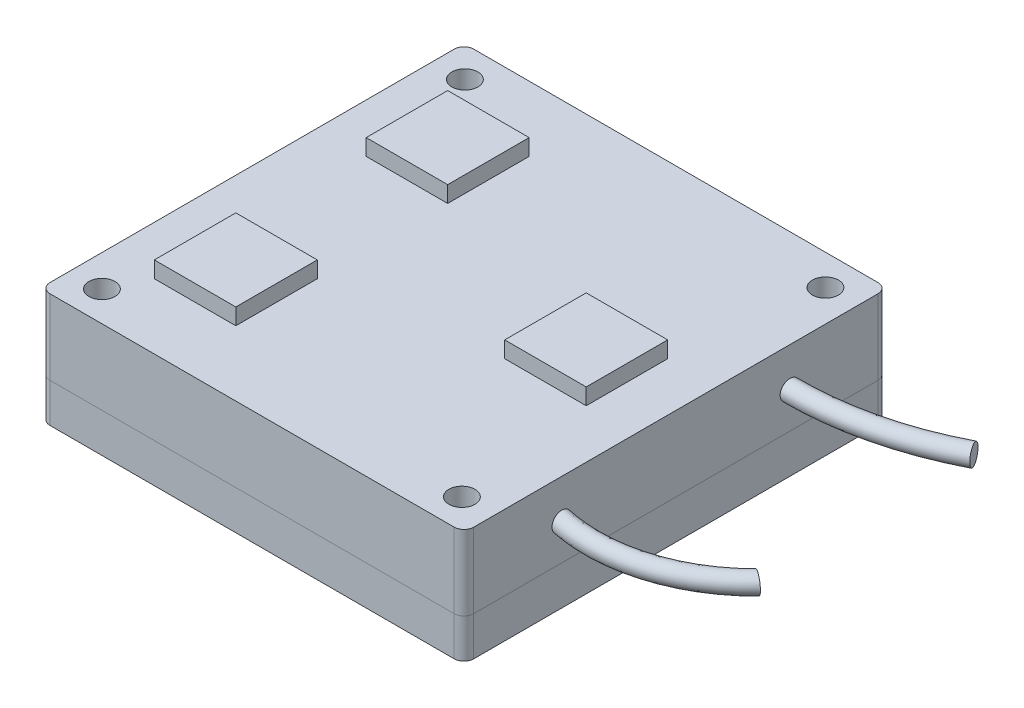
ISO-10303-21;
HEADER;
FILE_DESCRIPTION(('STEP AP214'),'2;1');
FILE_NAME('part.step','',(''),(''),'','','');
FILE_SCHEMA(('AUTOMOTIVE_DESIGN { 1 0 10303 214 1 1 1 1 }'));
ENDSEC;
DATA;
#1=APPLICATION_CONTEXT('core data for automotive mechanical design processes');
#2=APPLICATION_PROTOCOL_DEFINITION('international standard','automotive_design',2000,#1);
#3=PRODUCT_CONTEXT('',#1,'mechanical');
#4=PRODUCT('Part','Part','',(#3));
#5=PRODUCT_RELATED_PRODUCT_CATEGORY('part','',(#4));
#6=PRODUCT_DEFINITION_FORMATION('','',#4);
#7=PRODUCT_DEFINITION_CONTEXT('part definition',#1,'design');
#8=PRODUCT_DEFINITION('design','',#6,#7);
#9=PRODUCT_DEFINITION_SHAPE('','',#8);
#10=(LENGTH_UNIT() NAMED_UNIT(*) SI_UNIT(.MILLI.,.METRE.));
#11=(NAMED_UNIT(*) PLANE_ANGLE_UNIT() SI_UNIT($,.RADIAN.));
#12=(NAMED_UNIT(*) SI_UNIT($,.STERADIAN.) SOLID_ANGLE_UNIT());
#13=UNCERTAINTY_MEASURE_WITH_UNIT(LENGTH_MEASURE(1.E-05),#10,'distance_accuracy_value','');
#14=(GEOMETRIC_REPRESENTATION_CONTEXT(3) GLOBAL_UNCERTAINTY_ASSIGNED_CONTEXT((#13)) GLOBAL_UNIT_ASSIGNED_CONTEXT((#10,
#11,#12)) REPRESENTATION_CONTEXT('',''));
#15=CARTESIAN_POINT('',(0.,0.,0.));
#16=DIRECTION('',(0.,0.,1.));
#17=DIRECTION('',(1.,0.,0.));
#18=AXIS2_PLACEMENT_3D('',#15,#16,#17);
#19=CARTESIAN_POINT('',(3.00000000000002,-12.,127.));
#20=DIRECTION('',(0.,1.,0.));
#21=DIRECTION('',(0.,0.,1.));
#22=AXIS2_PLACEMENT_3D('',#19,#20,#21);
#23=CYLINDRICAL_SURFACE('',#22,3.);
#24=CARTESIAN_POINT('',(3.00000000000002,0.,127.));
#25=DIRECTION('',(0.,-1.,0.));
#26=DIRECTION('',(0.,0.,-1.));
#27=AXIS2_PLACEMENT_3D('',#24,#25,#26);
#28=CIRCLE('',#27,3.);
#29=CARTESIAN_POINT('',(3.00000000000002,0.,130.));
#30=VERTEX_POINT('',#29);
#31=CARTESIAN_POINT('',(0.,0.,127.));
#32=VERTEX_POINT('',#31);
#33=EDGE_CURVE('E142',#30,#32,#28,.T.);
#34=ORIENTED_EDGE('',*,*,#33,.T.);
#35=DIRECTION('',(0.,1.,0.));
#36=VECTOR('',#35,1.);
#37=CARTESIAN_POINT('',(0.,-12.,127.));
#38=LINE('',#37,#36);
#39=CARTESIAN_POINT('',(0.,-12.,127.));
#40=VERTEX_POINT('',#39);
#41=EDGE_CURVE('E12',#40,#32,#38,.T.);
#42=ORIENTED_EDGE('',*,*,#41,.F.);
#43=CARTESIAN_POINT('',(3.00000000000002,-12.,127.));
#44=DIRECTION('',(0.,-1.,0.));
#45=DIRECTION('',(0.,0.,-1.));
#46=AXIS2_PLACEMENT_3D('',#43,#44,#45);
#47=CIRCLE('',#46,3.);
#48=CARTESIAN_POINT('',(3.00000000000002,-12.,130.));
#49=VERTEX_POINT('',#48);
#50=EDGE_CURVE('E156',#49,#40,#47,.T.);
#51=ORIENTED_EDGE('',*,*,#50,.F.);
#52=DIRECTION('',(0.,1.,0.));
#53=VECTOR('',#52,1.);
#54=CARTESIAN_POINT('',(3.00000000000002,-12.,130.));
#55=LINE('',#54,#53);
#56=EDGE_CURVE('E138',#49,#30,#55,.T.);
#57=ORIENTED_EDGE('',*,*,#56,.T.);
#58=EDGE_LOOP('',(#34,#42,#51,#57));
#59=FACE_BOUND('',#58,.T.);
#60=ADVANCED_FACE('F46',(#59),#23,.T.);
#61=CARTESIAN_POINT('',(0.,-12.,127.));
#62=DIRECTION('',(1.,0.,0.));
#63=DIRECTION('',(0.,0.,-1.));
#64=AXIS2_PLACEMENT_3D('',#61,#62,#63);
#65=PLANE('',#64);
#66=DIRECTION('',(0.,0.,-1.));
#67=VECTOR('',#66,1.);
#68=CARTESIAN_POINT('',(0.,0.,127.));
#69=LINE('',#68,#67);
#70=CARTESIAN_POINT('',(0.,0.,3.));
#71=VERTEX_POINT('',#70);
#72=EDGE_CURVE('E145',#32,#71,#69,.T.);
#73=ORIENTED_EDGE('',*,*,#72,.T.);
#74=DIRECTION('',(0.,1.,0.));
#75=VECTOR('',#74,1.);
#76=CARTESIAN_POINT('',(0.,-12.,3.));
#77=LINE('',#76,#75);
#78=CARTESIAN_POINT('',(0.,-12.,3.));
#79=VERTEX_POINT('',#78);
#80=EDGE_CURVE('E54',#79,#71,#77,.T.);
#81=ORIENTED_EDGE('',*,*,#80,.F.);
#82=DIRECTION('',(0.,0.,-1.));
#83=VECTOR('',#82,1.);
#84=CARTESIAN_POINT('',(0.,-12.,127.));
#85=LINE('',#84,#83);
#86=EDGE_CURVE('E105',#40,#79,#85,.T.);
#87=ORIENTED_EDGE('',*,*,#86,.F.);
#88=ORIENTED_EDGE('',*,*,#41,.T.);
#89=EDGE_LOOP('',(#73,#81,#87,#88));
#90=FACE_BOUND('',#89,.T.);
#91=ADVANCED_FACE('F191',(#90),#65,.F.);
#92=CARTESIAN_POINT('',(3.,-12.,3.));
#93=DIRECTION('',(0.,1.,0.));
#94=DIRECTION('',(0.,0.,1.));
#95=AXIS2_PLACEMENT_3D('',#92,#93,#94);
#96=CYLINDRICAL_SURFACE('',#95,3.);
#97=CARTESIAN_POINT('',(3.,0.,3.));
#98=DIRECTION('',(0.,-1.,0.));
#99=DIRECTION('',(0.,0.,-1.));
#100=AXIS2_PLACEMENT_3D('',#97,#98,#99);
#101=CIRCLE('',#100,3.);
#102=CARTESIAN_POINT('',(3.,0.,0.));
#103=VERTEX_POINT('',#102);
#104=EDGE_CURVE('E147',#71,#103,#101,.T.);
#105=ORIENTED_EDGE('',*,*,#104,.T.);
#106=DIRECTION('',(0.,1.,0.));
#107=VECTOR('',#106,1.);
#108=CARTESIAN_POINT('',(3.,-12.,0.));
#109=LINE('',#108,#107);
#110=CARTESIAN_POINT('',(3.,-12.,0.));
#111=VERTEX_POINT('',#110);
#112=EDGE_CURVE('E163',#111,#103,#109,.T.);
#113=ORIENTED_EDGE('',*,*,#112,.F.);
#114=CARTESIAN_POINT('',(3.,-12.,3.));
#115=DIRECTION('',(0.,-1.,0.));
#116=DIRECTION('',(0.,0.,-1.));
#117=AXIS2_PLACEMENT_3D('',#114,#115,#116);
#118=CIRCLE('',#117,3.);
#119=EDGE_CURVE('E171',#79,#111,#118,.T.);
#120=ORIENTED_EDGE('',*,*,#119,.F.);
#121=ORIENTED_EDGE('',*,*,#80,.T.);
#122=EDGE_LOOP('',(#105,#113,#120,#121));
#123=FACE_BOUND('',#122,.T.);
#124=ADVANCED_FACE('F169',(#123),#96,.T.);
#125=CARTESIAN_POINT('',(3.,-12.,0.));
#126=DIRECTION('',(0.,0.,1.));
#127=DIRECTION('',(1.,0.,0.));
#128=AXIS2_PLACEMENT_3D('',#125,#126,#127);
#129=PLANE('',#128);
#130=DIRECTION('',(1.,0.,0.));
#131=VECTOR('',#130,1.);
#132=CARTESIAN_POINT('',(3.,0.,0.));
#133=LINE('',#132,#131);
#134=CARTESIAN_POINT('',(127.,0.,0.));
#135=VERTEX_POINT('',#134);
#136=EDGE_CURVE('E149',#103,#135,#133,.T.);
#137=ORIENTED_EDGE('',*,*,#136,.T.);
#138=DIRECTION('',(0.,1.,0.));
#139=VECTOR('',#138,1.);
#140=CARTESIAN_POINT('',(127.,-12.,0.));
#141=LINE('',#140,#139);
#142=CARTESIAN_POINT('',(127.,-12.,0.));
#143=VERTEX_POINT('',#142);
#144=EDGE_CURVE('E160',#143,#135,#141,.T.);
#145=ORIENTED_EDGE('',*,*,#144,.F.);
#146=DIRECTION('',(1.,0.,0.));
#147=VECTOR('',#146,1.);
#148=CARTESIAN_POINT('',(3.,-12.,0.));
#149=LINE('',#148,#147);
#150=EDGE_CURVE('E183',#111,#143,#149,.T.);
#151=ORIENTED_EDGE('',*,*,#150,.F.);
#152=ORIENTED_EDGE('',*,*,#112,.T.);
#153=EDGE_LOOP('',(#137,#145,#151,#152));
#154=FACE_BOUND('',#153,.T.);
#155=ADVANCED_FACE('F179',(#154),#129,.F.);
#156=CARTESIAN_POINT('',(127.,-12.,3.));
#157=DIRECTION('',(0.,1.,0.));
#158=DIRECTION('',(0.,0.,1.));
#159=AXIS2_PLACEMENT_3D('',#156,#157,#158);
#160=CYLINDRICAL_SURFACE('',#159,3.);
#161=CARTESIAN_POINT('',(127.,0.,3.));
#162=DIRECTION('',(0.,-1.,0.));
#163=DIRECTION('',(0.,0.,-1.));
#164=AXIS2_PLACEMENT_3D('',#161,#162,#163);
#165=CIRCLE('',#164,3.);
#166=CARTESIAN_POINT('',(130.,0.,3.));
#167=VERTEX_POINT('',#166);
#168=EDGE_CURVE('E151',#135,#167,#165,.T.);
#169=ORIENTED_EDGE('',*,*,#168,.T.);
#170=DIRECTION('',(0.,1.,0.));
#171=VECTOR('',#170,1.);
#172=CARTESIAN_POINT('',(130.,-12.,3.));
#173=LINE('',#172,#171);
#174=CARTESIAN_POINT('',(130.,-12.,3.));
#175=VERTEX_POINT('',#174);
#176=EDGE_CURVE('E133',#175,#167,#173,.T.);
#177=ORIENTED_EDGE('',*,*,#176,.F.);
#178=CARTESIAN_POINT('',(127.,-12.,3.));
#179=DIRECTION('',(0.,-1.,0.));
#180=DIRECTION('',(0.,0.,-1.));
#181=AXIS2_PLACEMENT_3D('',#178,#179,#180);
#182=CIRCLE('',#181,3.);
#183=EDGE_CURVE('E124',#143,#175,#182,.T.);
#184=ORIENTED_EDGE('',*,*,#183,.F.);
#185=ORIENTED_EDGE('',*,*,#144,.T.);
#186=EDGE_LOOP('',(#169,#177,#184,#185));
#187=FACE_BOUND('',#186,.T.);
#188=ADVANCED_FACE('F182',(#187),#160,.T.);
#189=CARTESIAN_POINT('',(130.,-12.,3.));
#190=DIRECTION('',(-1.,0.,0.));
#191=DIRECTION('',(0.,0.,1.));
#192=AXIS2_PLACEMENT_3D('',#189,#190,#191);
#193=PLANE('',#192);
#194=DIRECTION('',(0.,0.,1.));
#195=VECTOR('',#194,1.);
#196=CARTESIAN_POINT('',(130.,0.,3.));
#197=LINE('',#196,#195);
#198=CARTESIAN_POINT('',(130.,0.,127.));
#199=VERTEX_POINT('',#198);
#200=EDGE_CURVE('E132',#167,#199,#197,.T.);
#201=ORIENTED_EDGE('',*,*,#200,.T.);
#202=DIRECTION('',(0.,1.,0.));
#203=VECTOR('',#202,1.);
#204=CARTESIAN_POINT('',(130.,-12.,127.));
#205=LINE('',#204,#203);
#206=CARTESIAN_POINT('',(130.,-12.,127.));
#207=VERTEX_POINT('',#206);
#208=EDGE_CURVE('E129',#207,#199,#205,.T.);
#209=ORIENTED_EDGE('',*,*,#208,.F.);
#210=DIRECTION('',(0.,0.,1.));
#211=VECTOR('',#210,1.);
#212=CARTESIAN_POINT('',(130.,-12.,3.));
#213=LINE('',#212,#211);
#214=EDGE_CURVE('E118',#175,#207,#213,.T.);
#215=ORIENTED_EDGE('',*,*,#214,.F.);
#216=ORIENTED_EDGE('',*,*,#176,.T.);
#217=EDGE_LOOP('',(#201,#209,#215,#216));
#218=FACE_BOUND('',#217,.T.);
#219=ADVANCED_FACE('F130',(#218),#193,.F.);
#220=CARTESIAN_POINT('',(127.,-12.,127.));
#221=DIRECTION('',(0.,1.,0.));
#222=DIRECTION('',(0.,0.,1.));
#223=AXIS2_PLACEMENT_3D('',#220,#221,#222);
#224=CYLINDRICAL_SURFACE('',#223,3.);
#225=CARTESIAN_POINT('',(127.,0.,127.));
#226=DIRECTION('',(0.,-1.,0.));
#227=DIRECTION('',(0.,0.,-1.));
#228=AXIS2_PLACEMENT_3D('',#225,#226,#227);
#229=CIRCLE('',#228,3.);
#230=CARTESIAN_POINT('',(127.,0.,130.));
#231=VERTEX_POINT('',#230);
#232=EDGE_CURVE('E91',#199,#231,#229,.T.);
#233=ORIENTED_EDGE('',*,*,#232,.T.);
#234=DIRECTION('',(0.,1.,0.));
#235=VECTOR('',#234,1.);
#236=CARTESIAN_POINT('',(127.,-12.,130.));
#237=LINE('',#236,#235);
#238=CARTESIAN_POINT('',(127.,-12.,130.));
#239=VERTEX_POINT('',#238);
#240=EDGE_CURVE('E134',#239,#231,#237,.T.);
#241=ORIENTED_EDGE('',*,*,#240,.F.);
#242=CARTESIAN_POINT('',(127.,-12.,127.));
#243=DIRECTION('',(0.,-1.,0.));
#244=DIRECTION('',(0.,0.,-1.));
#245=AXIS2_PLACEMENT_3D('',#242,#243,#244);
#246=CIRCLE('',#245,3.);
#247=EDGE_CURVE('E122',#207,#239,#246,.T.);
#248=ORIENTED_EDGE('',*,*,#247,.F.);
#249=ORIENTED_EDGE('',*,*,#208,.T.);
#250=EDGE_LOOP('',(#233,#241,#248,#249));
#251=FACE_BOUND('',#250,.T.);
#252=ADVANCED_FACE('F136',(#251),#224,.T.);
#253=CARTESIAN_POINT('',(127.,-12.,130.));
#254=DIRECTION('',(0.,0.,-1.));
#255=DIRECTION('',(-1.,0.,0.));
#256=AXIS2_PLACEMENT_3D('',#253,#254,#255);
#257=PLANE('',#256);
#258=DIRECTION('',(-1.,0.,0.));
#259=VECTOR('',#258,1.);
#260=CARTESIAN_POINT('',(127.,0.,130.));
#261=LINE('',#260,#259);
#262=EDGE_CURVE('E97',#231,#30,#261,.T.);
#263=ORIENTED_EDGE('',*,*,#262,.T.);
#264=ORIENTED_EDGE('',*,*,#56,.F.);
#265=DIRECTION('',(-1.,0.,0.));
#266=VECTOR('',#265,1.);
#267=CARTESIAN_POINT('',(127.,-12.,130.));
#268=LINE('',#267,#266);
#269=EDGE_CURVE('E62',#239,#49,#268,.T.);
#270=ORIENTED_EDGE('',*,*,#269,.F.);
#271=ORIENTED_EDGE('',*,*,#240,.T.);
#272=EDGE_LOOP('',(#263,#264,#270,#271));
#273=FACE_BOUND('',#272,.T.);
#274=ADVANCED_FACE('F207',(#273),#257,.F.);
#275=CARTESIAN_POINT('',(3.00000000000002,-12.,127.));
#276=DIRECTION('',(0.,-1.,0.));
#277=DIRECTION('',(0.,0.,-1.));
#278=AXIS2_PLACEMENT_3D('',#275,#276,#277);
#279=PLANE('',#278);
#280=ORIENTED_EDGE('',*,*,#50,.T.);
#281=ORIENTED_EDGE('',*,*,#86,.T.);
#282=ORIENTED_EDGE('',*,*,#119,.T.);
#283=ORIENTED_EDGE('',*,*,#150,.T.);
#284=ORIENTED_EDGE('',*,*,#183,.T.);
#285=ORIENTED_EDGE('',*,*,#214,.T.);
#286=ORIENTED_EDGE('',*,*,#247,.T.);
#287=ORIENTED_EDGE('',*,*,#269,.T.);
#288=EDGE_LOOP('',(#280,#281,#282,#283,#284,#285,#286,#287));
#289=FACE_BOUND('',#288,.T.);
#290=ADVANCED_FACE('F120',(#289),#279,.T.);
#291=CARTESIAN_POINT('',(3.00000000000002,0.,127.));
#292=DIRECTION('',(0.,-1.,0.));
#293=DIRECTION('',(0.,0.,-1.));
#294=AXIS2_PLACEMENT_3D('',#291,#292,#293);
#295=PLANE('',#294);
#296=ORIENTED_EDGE('',*,*,#33,.F.);
#297=ORIENTED_EDGE('',*,*,#262,.F.);
#298=ORIENTED_EDGE('',*,*,#232,.F.);
#299=ORIENTED_EDGE('',*,*,#200,.F.);
#300=ORIENTED_EDGE('',*,*,#168,.F.);
#301=ORIENTED_EDGE('',*,*,#136,.F.);
#302=ORIENTED_EDGE('',*,*,#104,.F.);
#303=ORIENTED_EDGE('',*,*,#72,.F.);
#304=EDGE_LOOP('',(#296,#297,#298,#299,#300,#301,#302,#303));
#305=FACE_BOUND('',#304,.T.);
#306=ADVANCED_FACE('F175',(#305),#295,.F.);
#307=CLOSED_SHELL('',(#60,#91,#124,#155,#188,#219,#252,#274,#290,#306));
#308=MANIFOLD_SOLID_BREP('B2',#307);
#309=CARTESIAN_POINT('',(130.,23.,0.));
#310=DIRECTION('',(-1.,0.,0.));
#311=DIRECTION('',(0.,0.,1.));
#312=AXIS2_PLACEMENT_3D('',#309,#310,#311);
#313=PLANE('',#312);
#314=CARTESIAN_POINT('',(130.,11.,100.));
#315=DIRECTION('',(1.,0.,0.));
#316=DIRECTION('',(0.,0.,-1.));
#317=AXIS2_PLACEMENT_3D('',#314,#315,#316);
#318=CIRCLE('',#317,3.00000000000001);
#319=CARTESIAN_POINT('',(130.,11.,97.));
#320=VERTEX_POINT('',#319);
#321=EDGE_CURVE('E283',#320,#320,#318,.T.);
#322=ORIENTED_EDGE('',*,*,#321,.F.);
#323=EDGE_LOOP('',(#322));
#324=FACE_BOUND('',#323,.T.);
#325=DIRECTION('',(0.,0.,-1.));
#326=VECTOR('',#325,1.);
#327=CARTESIAN_POINT('',(130.,0.,0.));
#328=LINE('',#327,#326);
#329=CARTESIAN_POINT('',(130.,0.,127.));
#330=VERTEX_POINT('',#329);
#331=CARTESIAN_POINT('',(130.,0.,3.));
#332=VERTEX_POINT('',#331);
#333=EDGE_CURVE('E1130',#330,#332,#328,.T.);
#334=ORIENTED_EDGE('',*,*,#333,.T.);
#335=DIRECTION('',(0.,-1.,0.));
#336=VECTOR('',#335,1.);
#337=CARTESIAN_POINT('',(130.,23.,3.));
#338=LINE('',#337,#336);
#339=CARTESIAN_POINT('',(130.,23.,3.));
#340=VERTEX_POINT('',#339);
#341=EDGE_CURVE('E1089',#332,#340,#338,.F.);
#342=ORIENTED_EDGE('',*,*,#341,.T.);
#343=DIRECTION('',(0.,0.,-1.));
#344=VECTOR('',#343,1.);
#345=CARTESIAN_POINT('',(130.,23.,0.));
#346=LINE('',#345,#344);
#347=CARTESIAN_POINT('',(130.,23.,127.));
#348=VERTEX_POINT('',#347);
#349=EDGE_CURVE('E1142',#348,#340,#346,.T.);
#350=ORIENTED_EDGE('',*,*,#349,.F.);
#351=DIRECTION('',(0.,-1.,0.));
#352=VECTOR('',#351,1.);
#353=CARTESIAN_POINT('',(130.,23.,127.));
#354=LINE('',#353,#352);
#355=EDGE_CURVE('E1091',#348,#330,#354,.T.);
#356=ORIENTED_EDGE('',*,*,#355,.T.);
#357=EDGE_LOOP('',(#334,#342,#350,#356));
#358=FACE_BOUND('',#357,.T.);
#359=CARTESIAN_POINT('',(130.,11.,30.));
#360=DIRECTION('',(1.,0.,0.));
#361=DIRECTION('',(0.,0.,-1.));
#362=AXIS2_PLACEMENT_3D('',#359,#360,#361);
#363=CIRCLE('',#362,3.);
#364=CARTESIAN_POINT('',(130.,11.,27.));
#365=VERTEX_POINT('',#364);
#366=EDGE_CURVE('E44',#365,#365,#363,.T.);
#367=ORIENTED_EDGE('',*,*,#366,.F.);
#368=EDGE_LOOP('',(#367));
#369=FACE_BOUND('',#368,.T.);
#370=ADVANCED_FACE('F274',(#324,#358,#369),#313,.F.);
#371=CARTESIAN_POINT('',(0.,23.,130.));
#372=DIRECTION('',(0.,1.,0.));
#373=DIRECTION('',(0.,0.,1.));
#374=AXIS2_PLACEMENT_3D('',#371,#372,#373);
#375=PLANE('',#374);
#376=DIRECTION('',(-1.,0.,0.));
#377=VECTOR('',#376,1.);
#378=CARTESIAN_POINT('',(15.,23.,85.));
#379=LINE('',#378,#377);
#380=CARTESIAN_POINT('',(40.,23.,85.));
#381=VERTEX_POINT('',#380);
#382=CARTESIAN_POINT('',(15.,23.,85.));
#383=VERTEX_POINT('',#382);
#384=EDGE_CURVE('E586',#381,#383,#379,.T.);
#385=ORIENTED_EDGE('',*,*,#384,.F.);
#386=DIRECTION('',(0.,0.,-1.));
#387=VECTOR('',#386,1.);
#388=CARTESIAN_POINT('',(40.,23.,85.));
#389=LINE('',#388,#387);
#390=CARTESIAN_POINT('',(40.,23.,110.));
#391=VERTEX_POINT('',#390);
#392=EDGE_CURVE('E583',#391,#381,#389,.T.);
#393=ORIENTED_EDGE('',*,*,#392,.F.);
#394=DIRECTION('',(1.,0.,0.));
#395=VECTOR('',#394,1.);
#396=CARTESIAN_POINT('',(15.,23.,110.));
#397=LINE('',#396,#395);
#398=CARTESIAN_POINT('',(15.,23.,110.));
#399=VERTEX_POINT('',#398);
#400=EDGE_CURVE('E595',#399,#391,#397,.T.);
#401=ORIENTED_EDGE('',*,*,#400,.F.);
#402=DIRECTION('',(0.,0.,1.));
#403=VECTOR('',#402,1.);
#404=CARTESIAN_POINT('',(15.,23.,85.));
#405=LINE('',#404,#403);
#406=EDGE_CURVE('E603',#383,#399,#405,.T.);
#407=ORIENTED_EDGE('',*,*,#406,.F.);
#408=EDGE_LOOP('',(#385,#393,#401,#407));
#409=FACE_BOUND('',#408,.T.);
#410=DIRECTION('',(-1.,0.,0.));
#411=VECTOR('',#410,1.);
#412=CARTESIAN_POINT('',(0.,23.,0.));
#413=LINE('',#412,#411);
#414=CARTESIAN_POINT('',(127.,23.,0.));
#415=VERTEX_POINT('',#414);
#416=CARTESIAN_POINT('',(3.,23.,0.));
#417=VERTEX_POINT('',#416);
#418=EDGE_CURVE('E1125',#415,#417,#413,.T.);
#419=ORIENTED_EDGE('',*,*,#418,.T.);
#420=CARTESIAN_POINT('',(3.,23.,3.));
#421=DIRECTION('',(0.,1.,0.));
#422=DIRECTION('',(0.,0.,1.));
#423=AXIS2_PLACEMENT_3D('',#420,#421,#422);
#424=CIRCLE('',#423,3.);
#425=CARTESIAN_POINT('',(0.,23.,3.));
#426=VERTEX_POINT('',#425);
#427=EDGE_CURVE('E1099',#417,#426,#424,.T.);
#428=ORIENTED_EDGE('',*,*,#427,.T.);
#429=DIRECTION('',(0.,0.,1.));
#430=VECTOR('',#429,1.);
#431=CARTESIAN_POINT('',(0.,23.,0.));
#432=LINE('',#431,#430);
#433=CARTESIAN_POINT('',(0.,23.,127.));
#434=VERTEX_POINT('',#433);
#435=EDGE_CURVE('E1129',#426,#434,#432,.T.);
#436=ORIENTED_EDGE('',*,*,#435,.T.);
#437=CARTESIAN_POINT('',(3.00000000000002,23.,127.));
#438=DIRECTION('',(0.,1.,0.));
#439=DIRECTION('',(0.,0.,1.));
#440=AXIS2_PLACEMENT_3D('',#437,#438,#439);
#441=CIRCLE('',#440,3.);
#442=CARTESIAN_POINT('',(3.00000000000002,23.,130.));
#443=VERTEX_POINT('',#442);
#444=EDGE_CURVE('E1101',#434,#443,#441,.T.);
#445=ORIENTED_EDGE('',*,*,#444,.T.);
#446=DIRECTION('',(1.,0.,0.));
#447=VECTOR('',#446,1.);
#448=CARTESIAN_POINT('',(0.,23.,130.));
#449=LINE('',#448,#447);
#450=CARTESIAN_POINT('',(127.,23.,130.));
#451=VERTEX_POINT('',#450);
#452=EDGE_CURVE('E1145',#443,#451,#449,.T.);
#453=ORIENTED_EDGE('',*,*,#452,.T.);
#454=CARTESIAN_POINT('',(127.,23.,127.));
#455=DIRECTION('',(0.,1.,0.));
#456=DIRECTION('',(0.,0.,1.));
#457=AXIS2_PLACEMENT_3D('',#454,#455,#456);
#458=CIRCLE('',#457,3.);
#459=EDGE_CURVE('E1105',#451,#348,#458,.T.);
#460=ORIENTED_EDGE('',*,*,#459,.T.);
#461=ORIENTED_EDGE('',*,*,#349,.T.);
#462=CARTESIAN_POINT('',(127.,23.,3.));
#463=DIRECTION('',(0.,1.,0.));
#464=DIRECTION('',(0.,0.,1.));
#465=AXIS2_PLACEMENT_3D('',#462,#463,#464);
#466=CIRCLE('',#465,3.);
#467=EDGE_CURVE('E1103',#340,#415,#466,.T.);
#468=ORIENTED_EDGE('',*,*,#467,.T.);
#469=EDGE_LOOP('',(#419,#428,#436,#445,#453,#460,#461,#468));
#470=FACE_BOUND('',#469,.T.);
#471=CARTESIAN_POINT('',(9.69314222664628,23.,9.41137362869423));
#472=DIRECTION('',(0.,-1.,0.));
#473=DIRECTION('',(0.,0.,-1.));
#474=AXIS2_PLACEMENT_3D('',#471,#472,#473);
#475=CIRCLE('',#474,4.);
#476=CARTESIAN_POINT('',(9.69314222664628,23.,5.41137362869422));
#477=VERTEX_POINT('',#476);
#478=EDGE_CURVE('E1271',#477,#477,#475,.T.);
#479=ORIENTED_EDGE('',*,*,#478,.T.);
#480=EDGE_LOOP('',(#479));
#481=FACE_BOUND('',#480,.T.);
#482=CARTESIAN_POINT('',(120.299802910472,23.,9.40471865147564));
#483=DIRECTION('',(0.,-1.,0.));
#484=DIRECTION('',(0.,0.,-1.));
#485=AXIS2_PLACEMENT_3D('',#482,#483,#484);
#486=CIRCLE('',#485,4.00000000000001);
#487=CARTESIAN_POINT('',(120.299802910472,23.,5.40471865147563));
#488=VERTEX_POINT('',#487);
#489=EDGE_CURVE('E1345',#488,#488,#486,.T.);
#490=ORIENTED_EDGE('',*,*,#489,.T.);
#491=EDGE_LOOP('',(#490));
#492=FACE_BOUND('',#491,.T.);
#493=CARTESIAN_POINT('',(120.12018080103,23.,120.758700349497));
#494=DIRECTION('',(0.,-1.,0.));
#495=DIRECTION('',(0.,0.,-1.));
#496=AXIS2_PLACEMENT_3D('',#493,#494,#495);
#497=CIRCLE('',#496,4.00000000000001);
#498=CARTESIAN_POINT('',(120.12018080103,23.,116.758700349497));
#499=VERTEX_POINT('',#498);
#500=EDGE_CURVE('E1351',#499,#499,#497,.T.);
#501=ORIENTED_EDGE('',*,*,#500,.T.);
#502=EDGE_LOOP('',(#501));
#503=FACE_BOUND('',#502,.T.);
#504=CARTESIAN_POINT('',(9.69314222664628,23.,120.758700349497));
#505=DIRECTION('',(0.,-1.,0.));
#506=DIRECTION('',(0.,0.,-1.));
#507=AXIS2_PLACEMENT_3D('',#504,#505,#506);
#508=CIRCLE('',#507,4.);
#509=CARTESIAN_POINT('',(9.69314222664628,23.,116.758700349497));
#510=VERTEX_POINT('',#509);
#511=EDGE_CURVE('E1357',#510,#510,#508,.T.);
#512=ORIENTED_EDGE('',*,*,#511,.T.);
#513=EDGE_LOOP('',(#512));
#514=FACE_BOUND('',#513,.T.);
#515=DIRECTION('',(-1.,0.,0.));
#516=VECTOR('',#515,1.);
#517=CARTESIAN_POINT('',(15.,23.,20.));
#518=LINE('',#517,#516);
#519=CARTESIAN_POINT('',(40.,23.,20.));
#520=VERTEX_POINT('',#519);
#521=CARTESIAN_POINT('',(15.,23.,20.));
#522=VERTEX_POINT('',#521);
#523=EDGE_CURVE('E628',#520,#522,#518,.T.);
#524=ORIENTED_EDGE('',*,*,#523,.F.);
#525=DIRECTION('',(0.,0.,-1.));
#526=VECTOR('',#525,1.);
#527=CARTESIAN_POINT('',(40.,23.,20.));
#528=LINE('',#527,#526);
#529=CARTESIAN_POINT('',(40.,23.,45.));
#530=VERTEX_POINT('',#529);
#531=EDGE_CURVE('E614',#530,#520,#528,.T.);
#532=ORIENTED_EDGE('',*,*,#531,.F.);
#533=DIRECTION('',(1.,0.,0.));
#534=VECTOR('',#533,1.);
#535=CARTESIAN_POINT('',(15.,23.,45.));
#536=LINE('',#535,#534);
#537=CARTESIAN_POINT('',(15.,23.,45.));
#538=VERTEX_POINT('',#537);
#539=EDGE_CURVE('E619',#538,#530,#536,.T.);
#540=ORIENTED_EDGE('',*,*,#539,.F.);
#541=DIRECTION('',(0.,0.,1.));
#542=VECTOR('',#541,1.);
#543=CARTESIAN_POINT('',(15.,23.,20.));
#544=LINE('',#543,#542);
#545=EDGE_CURVE('E630',#522,#538,#544,.T.);
#546=ORIENTED_EDGE('',*,*,#545,.F.);
#547=EDGE_LOOP('',(#524,#532,#540,#546));
#548=FACE_BOUND('',#547,.T.);
#549=DIRECTION('',(-1.,0.,0.));
#550=VECTOR('',#549,1.);
#551=CARTESIAN_POINT('',(90.,23.,52.5));
#552=LINE('',#551,#550);
#553=CARTESIAN_POINT('',(115.,23.,52.5));
#554=VERTEX_POINT('',#553);
#555=CARTESIAN_POINT('',(90.,23.,52.5));
#556=VERTEX_POINT('',#555);
#557=EDGE_CURVE('E1494',#554,#556,#552,.T.);
#558=ORIENTED_EDGE('',*,*,#557,.F.);
#559=DIRECTION('',(0.,0.,-1.));
#560=VECTOR('',#559,1.);
#561=CARTESIAN_POINT('',(115.,23.,52.5));
#562=LINE('',#561,#560);
#563=CARTESIAN_POINT('',(115.,23.,77.5));
#564=VERTEX_POINT('',#563);
#565=EDGE_CURVE('E581',#564,#554,#562,.T.);
#566=ORIENTED_EDGE('',*,*,#565,.F.);
#567=DIRECTION('',(1.,0.,0.));
#568=VECTOR('',#567,1.);
#569=CARTESIAN_POINT('',(90.,23.,77.5));
#570=LINE('',#569,#568);
#571=CARTESIAN_POINT('',(90.,23.,77.5));
#572=VERTEX_POINT('',#571);
#573=EDGE_CURVE('E577',#572,#564,#570,.T.);
#574=ORIENTED_EDGE('',*,*,#573,.F.);
#575=DIRECTION('',(0.,0.,1.));
#576=VECTOR('',#575,1.);
#577=CARTESIAN_POINT('',(90.,23.,52.5));
#578=LINE('',#577,#576);
#579=EDGE_CURVE('E1496',#556,#572,#578,.T.);
#580=ORIENTED_EDGE('',*,*,#579,.F.);
#581=EDGE_LOOP('',(#558,#566,#574,#580));
#582=FACE_BOUND('',#581,.T.);
#583=ADVANCED_FACE('F760',(#409,#470,#481,#492,#503,#514,#548,#582),#375,.T.);
#584=CARTESIAN_POINT('',(23.500000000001,19.5,20.9999999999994));
#585=DIRECTION('',(0.,-1.,0.));
#586=DIRECTION('',(0.,0.,-1.));
#587=AXIS2_PLACEMENT_3D('',#584,#585,#586);
#588=PLANE('',#587);
#589=CARTESIAN_POINT('',(23.500000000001,19.5,20.9999999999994));
#590=DIRECTION('',(0.,-1.,0.));
#591=DIRECTION('',(0.,0.,-1.));
#592=AXIS2_PLACEMENT_3D('',#589,#590,#591);
#593=CIRCLE('',#592,5.);
#594=CARTESIAN_POINT('',(23.500000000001,19.5,15.9999999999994));
#595=VERTEX_POINT('',#594);
#596=EDGE_CURVE('E1399',#595,#595,#593,.T.);
#597=ORIENTED_EDGE('',*,*,#596,.T.);
#598=EDGE_LOOP('',(#597));
#599=FACE_BOUND('',#598,.T.);
#600=CARTESIAN_POINT('',(23.500000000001,19.5,20.9999999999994));
#601=DIRECTION('',(0.,-1.,0.));
#602=DIRECTION('',(0.,0.,-1.));
#603=AXIS2_PLACEMENT_3D('',#600,#601,#602);
#604=CIRCLE('',#603,3.00000000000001);
#605=CARTESIAN_POINT('',(23.500000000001,19.5,23.9999999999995));
#606=VERTEX_POINT('',#605);
#607=EDGE_CURVE('E1425',#606,#606,#604,.T.);
#608=ORIENTED_EDGE('',*,*,#607,.F.);
#609=EDGE_LOOP('',(#608));
#610=FACE_BOUND('',#609,.T.);
#611=ADVANCED_FACE('F756',(#599,#610),#588,.T.);
#612=CARTESIAN_POINT('',(63.500000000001,19.5,20.9999999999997));
#613=DIRECTION('',(0.,-1.,0.));
#614=DIRECTION('',(0.,0.,-1.));
#615=AXIS2_PLACEMENT_3D('',#612,#613,#614);
#616=PLANE('',#615);
#617=CARTESIAN_POINT('',(63.500000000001,19.5,20.9999999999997));
#618=DIRECTION('',(0.,-1.,0.));
#619=DIRECTION('',(0.,0.,-1.));
#620=AXIS2_PLACEMENT_3D('',#617,#618,#619);
#621=CIRCLE('',#620,5.);
#622=CARTESIAN_POINT('',(63.500000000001,19.5,15.9999999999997));
#623=VERTEX_POINT('',#622);
#624=EDGE_CURVE('E1393',#623,#623,#621,.T.);
#625=ORIENTED_EDGE('',*,*,#624,.T.);
#626=EDGE_LOOP('',(#625));
#627=FACE_BOUND('',#626,.T.);
#628=CARTESIAN_POINT('',(63.500000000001,19.5,20.9999999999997));
#629=DIRECTION('',(0.,-1.,0.));
#630=DIRECTION('',(0.,0.,-1.));
#631=AXIS2_PLACEMENT_3D('',#628,#629,#630);
#632=CIRCLE('',#631,3.00000000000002);
#633=CARTESIAN_POINT('',(63.500000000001,19.5,23.9999999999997));
#634=VERTEX_POINT('',#633);
#635=EDGE_CURVE('E1422',#634,#634,#632,.T.);
#636=ORIENTED_EDGE('',*,*,#635,.F.);
#637=EDGE_LOOP('',(#636));
#638=FACE_BOUND('',#637,.T.);
#639=ADVANCED_FACE('F759',(#627,#638),#616,.T.);
#640=CARTESIAN_POINT('',(103.500000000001,19.5,21.));
#641=DIRECTION('',(0.,-1.,0.));
#642=DIRECTION('',(0.,0.,-1.));
#643=AXIS2_PLACEMENT_3D('',#640,#641,#642);
#644=PLANE('',#643);
#645=CARTESIAN_POINT('',(103.500000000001,19.5,21.));
#646=DIRECTION('',(0.,-1.,0.));
#647=DIRECTION('',(0.,0.,-1.));
#648=AXIS2_PLACEMENT_3D('',#645,#646,#647);
#649=CIRCLE('',#648,5.);
#650=CARTESIAN_POINT('',(103.500000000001,19.5,16.));
#651=VERTEX_POINT('',#650);
#652=EDGE_CURVE('E1387',#651,#651,#649,.T.);
#653=ORIENTED_EDGE('',*,*,#652,.T.);
#654=EDGE_LOOP('',(#653));
#655=FACE_BOUND('',#654,.T.);
#656=CARTESIAN_POINT('',(103.500000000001,19.5,21.));
#657=DIRECTION('',(0.,-1.,0.));
#658=DIRECTION('',(0.,0.,-1.));
#659=AXIS2_PLACEMENT_3D('',#656,#657,#658);
#660=CIRCLE('',#659,3.00000000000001);
#661=CARTESIAN_POINT('',(103.500000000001,19.5,24.));
#662=VERTEX_POINT('',#661);
#663=EDGE_CURVE('E1419',#662,#662,#660,.T.);
#664=ORIENTED_EDGE('',*,*,#663,.F.);
#665=EDGE_LOOP('',(#664));
#666=FACE_BOUND('',#665,.T.);
#667=ADVANCED_FACE('F768',(#655,#666),#644,.T.);
#668=CARTESIAN_POINT('',(103.500000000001,19.5,66.));
#669=DIRECTION('',(0.,-1.,0.));
#670=DIRECTION('',(0.,0.,-1.));
#671=AXIS2_PLACEMENT_3D('',#668,#669,#670);
#672=PLANE('',#671);
#673=CARTESIAN_POINT('',(103.500000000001,19.5,66.));
#674=DIRECTION('',(0.,-1.,0.));
#675=DIRECTION('',(0.,0.,-1.));
#676=AXIS2_PLACEMENT_3D('',#673,#674,#675);
#677=CIRCLE('',#676,5.00000000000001);
#678=CARTESIAN_POINT('',(103.500000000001,19.5,61.));
#679=VERTEX_POINT('',#678);
#680=EDGE_CURVE('E1381',#679,#679,#677,.T.);
#681=ORIENTED_EDGE('',*,*,#680,.T.);
#682=EDGE_LOOP('',(#681));
#683=FACE_BOUND('',#682,.T.);
#684=CARTESIAN_POINT('',(103.500000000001,19.5,66.));
#685=DIRECTION('',(0.,-1.,0.));
#686=DIRECTION('',(0.,0.,-1.));
#687=AXIS2_PLACEMENT_3D('',#684,#685,#686);
#688=CIRCLE('',#687,3.00000000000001);
#689=CARTESIAN_POINT('',(103.500000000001,19.5,69.));
#690=VERTEX_POINT('',#689);
#691=EDGE_CURVE('E1416',#690,#690,#688,.T.);
#692=ORIENTED_EDGE('',*,*,#691,.F.);
#693=EDGE_LOOP('',(#692));
#694=FACE_BOUND('',#693,.T.);
#695=ADVANCED_FACE('F776',(#683,#694),#672,.T.);
#696=CARTESIAN_POINT('',(23.5,19.5,110.999999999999));
#697=DIRECTION('',(0.,-1.,0.));
#698=DIRECTION('',(0.,0.,-1.));
#699=AXIS2_PLACEMENT_3D('',#696,#697,#698);
#700=PLANE('',#699);
#701=CARTESIAN_POINT('',(23.5,19.5,110.999999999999));
#702=DIRECTION('',(0.,-1.,0.));
#703=DIRECTION('',(0.,0.,-1.));
#704=AXIS2_PLACEMENT_3D('',#701,#702,#703);
#705=CIRCLE('',#704,5.);
#706=CARTESIAN_POINT('',(23.5,19.5,105.999999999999));
#707=VERTEX_POINT('',#706);
#708=EDGE_CURVE('E1375',#707,#707,#705,.T.);
#709=ORIENTED_EDGE('',*,*,#708,.T.);
#710=EDGE_LOOP('',(#709));
#711=FACE_BOUND('',#710,.T.);
#712=CARTESIAN_POINT('',(23.5,19.5,110.999999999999));
#713=DIRECTION('',(0.,-1.,0.));
#714=DIRECTION('',(0.,0.,-1.));
#715=AXIS2_PLACEMENT_3D('',#712,#713,#714);
#716=CIRCLE('',#715,3.00000000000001);
#717=CARTESIAN_POINT('',(23.5,19.5,113.999999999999));
#718=VERTEX_POINT('',#717);
#719=EDGE_CURVE('E1413',#718,#718,#716,.T.);
#720=ORIENTED_EDGE('',*,*,#719,.F.);
#721=EDGE_LOOP('',(#720));
#722=FACE_BOUND('',#721,.T.);
#723=ADVANCED_FACE('F784',(#711,#722),#700,.T.);
#724=CARTESIAN_POINT('',(63.5,19.5,111.));
#725=DIRECTION('',(0.,-1.,0.));
#726=DIRECTION('',(0.,0.,-1.));
#727=AXIS2_PLACEMENT_3D('',#724,#725,#726);
#728=PLANE('',#727);
#729=CARTESIAN_POINT('',(63.5,19.5,111.));
#730=DIRECTION('',(0.,-1.,0.));
#731=DIRECTION('',(0.,0.,-1.));
#732=AXIS2_PLACEMENT_3D('',#729,#730,#731);
#733=CIRCLE('',#732,5.00000000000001);
#734=CARTESIAN_POINT('',(63.5,19.5,106.));
#735=VERTEX_POINT('',#734);
#736=EDGE_CURVE('E1369',#735,#735,#733,.T.);
#737=ORIENTED_EDGE('',*,*,#736,.T.);
#738=EDGE_LOOP('',(#737));
#739=FACE_BOUND('',#738,.T.);
#740=CARTESIAN_POINT('',(63.5,19.5,111.));
#741=DIRECTION('',(0.,-1.,0.));
#742=DIRECTION('',(0.,0.,-1.));
#743=AXIS2_PLACEMENT_3D('',#740,#741,#742);
#744=CIRCLE('',#743,3.00000000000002);
#745=CARTESIAN_POINT('',(63.5,19.5,114.));
#746=VERTEX_POINT('',#745);
#747=EDGE_CURVE('E1410',#746,#746,#744,.T.);
#748=ORIENTED_EDGE('',*,*,#747,.F.);
#749=EDGE_LOOP('',(#748));
#750=FACE_BOUND('',#749,.T.);
#751=ADVANCED_FACE('F792',(#739,#750),#728,.T.);
#752=CARTESIAN_POINT('',(103.5,19.5,111.));
#753=DIRECTION('',(0.,-1.,0.));
#754=DIRECTION('',(0.,0.,-1.));
#755=AXIS2_PLACEMENT_3D('',#752,#753,#754);
#756=PLANE('',#755);
#757=CARTESIAN_POINT('',(103.5,19.5,111.));
#758=DIRECTION('',(0.,-1.,0.));
#759=DIRECTION('',(0.,0.,-1.));
#760=AXIS2_PLACEMENT_3D('',#757,#758,#759);
#761=CIRCLE('',#760,5.00000000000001);
#762=CARTESIAN_POINT('',(103.5,19.5,106.));
#763=VERTEX_POINT('',#762);
#764=EDGE_CURVE('E1363',#763,#763,#761,.T.);
#765=ORIENTED_EDGE('',*,*,#764,.T.);
#766=EDGE_LOOP('',(#765));
#767=FACE_BOUND('',#766,.T.);
#768=CARTESIAN_POINT('',(103.5,19.5,111.));
#769=DIRECTION('',(0.,-1.,0.));
#770=DIRECTION('',(0.,0.,-1.));
#771=AXIS2_PLACEMENT_3D('',#768,#769,#770);
#772=CIRCLE('',#771,3.00000000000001);
#773=CARTESIAN_POINT('',(103.5,19.5,114.));
#774=VERTEX_POINT('',#773);
#775=EDGE_CURVE('E1405',#774,#774,#772,.T.);
#776=ORIENTED_EDGE('',*,*,#775,.F.);
#777=EDGE_LOOP('',(#776));
#778=FACE_BOUND('',#777,.T.);
#779=ADVANCED_FACE('F800',(#767,#778),#756,.T.);
#780=CARTESIAN_POINT('',(0.,23.,0.));
#781=DIRECTION('',(1.,0.,0.));
#782=DIRECTION('',(0.,0.,-1.));
#783=AXIS2_PLACEMENT_3D('',#780,#781,#782);
#784=PLANE('',#783);
#785=CARTESIAN_POINT('',(0.,11.,72.));
#786=DIRECTION('',(-1.,0.,0.));
#787=DIRECTION('',(0.,0.,1.));
#788=AXIS2_PLACEMENT_3D('',#785,#786,#787);
#789=CIRCLE('',#788,6.5);
#790=CARTESIAN_POINT('',(0.,11.,78.5));
#791=VERTEX_POINT('',#790);
#792=EDGE_CURVE('E650',#791,#791,#789,.T.);
#793=ORIENTED_EDGE('',*,*,#792,.F.);
#794=EDGE_LOOP('',(#793));
#795=FACE_BOUND('',#794,.T.);
#796=CARTESIAN_POINT('',(0.,11.,100.));
#797=DIRECTION('',(-1.,0.,0.));
#798=DIRECTION('',(0.,0.,1.));
#799=AXIS2_PLACEMENT_3D('',#796,#797,#798);
#800=CIRCLE('',#799,6.5);
#801=CARTESIAN_POINT('',(0.,11.,106.5));
#802=VERTEX_POINT('',#801);
#803=EDGE_CURVE('E1033',#802,#802,#800,.T.);
#804=ORIENTED_EDGE('',*,*,#803,.F.);
#805=EDGE_LOOP('',(#804));
#806=FACE_BOUND('',#805,.T.);
#807=ORIENTED_EDGE('',*,*,#435,.F.);
#808=DIRECTION('',(0.,-1.,0.));
#809=VECTOR('',#808,1.);
#810=CARTESIAN_POINT('',(0.,23.,3.));
#811=LINE('',#810,#809);
#812=CARTESIAN_POINT('',(0.,0.,3.));
#813=VERTEX_POINT('',#812);
#814=EDGE_CURVE('E1120',#426,#813,#811,.T.);
#815=ORIENTED_EDGE('',*,*,#814,.T.);
#816=DIRECTION('',(0.,0.,1.));
#817=VECTOR('',#816,1.);
#818=CARTESIAN_POINT('',(0.,0.,0.));
#819=LINE('',#818,#817);
#820=CARTESIAN_POINT('',(0.,0.,127.));
#821=VERTEX_POINT('',#820);
#822=EDGE_CURVE('E1136',#813,#821,#819,.T.);
#823=ORIENTED_EDGE('',*,*,#822,.T.);
#824=DIRECTION('',(0.,-1.,0.));
#825=VECTOR('',#824,1.);
#826=CARTESIAN_POINT('',(0.,23.,127.));
#827=LINE('',#826,#825);
#828=EDGE_CURVE('E1123',#821,#434,#827,.F.);
#829=ORIENTED_EDGE('',*,*,#828,.T.);
#830=EDGE_LOOP('',(#807,#815,#823,#829));
#831=FACE_BOUND('',#830,.T.);
#832=ADVANCED_FACE('F808',(#795,#806,#831),#784,.F.);
#833=CARTESIAN_POINT('',(0.,23.,130.));
#834=DIRECTION('',(0.,0.,-1.));
#835=DIRECTION('',(-1.,0.,0.));
#836=AXIS2_PLACEMENT_3D('',#833,#834,#835);
#837=PLANE('',#836);
#838=ORIENTED_EDGE('',*,*,#452,.F.);
#839=DIRECTION('',(0.,-1.,0.));
#840=VECTOR('',#839,1.);
#841=CARTESIAN_POINT('',(3.00000000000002,23.,130.));
#842=LINE('',#841,#840);
#843=CARTESIAN_POINT('',(3.00000000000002,0.,130.));
#844=VERTEX_POINT('',#843);
#845=EDGE_CURVE('E1094',#443,#844,#842,.T.);
#846=ORIENTED_EDGE('',*,*,#845,.T.);
#847=DIRECTION('',(1.,0.,0.));
#848=VECTOR('',#847,1.);
#849=CARTESIAN_POINT('',(0.,0.,130.));
#850=LINE('',#849,#848);
#851=CARTESIAN_POINT('',(127.,0.,130.));
#852=VERTEX_POINT('',#851);
#853=EDGE_CURVE('E1133',#844,#852,#850,.T.);
#854=ORIENTED_EDGE('',*,*,#853,.T.);
#855=DIRECTION('',(0.,-1.,0.));
#856=VECTOR('',#855,1.);
#857=CARTESIAN_POINT('',(127.,23.,130.));
#858=LINE('',#857,#856);
#859=EDGE_CURVE('E1097',#852,#451,#858,.F.);
#860=ORIENTED_EDGE('',*,*,#859,.T.);
#861=EDGE_LOOP('',(#838,#846,#854,#860));
#862=FACE_BOUND('',#861,.T.);
#863=ADVANCED_FACE('F941',(#862),#837,.F.);
#864=CARTESIAN_POINT('',(0.,23.,0.));
#865=DIRECTION('',(0.,0.,1.));
#866=DIRECTION('',(1.,0.,0.));
#867=AXIS2_PLACEMENT_3D('',#864,#865,#866);
#868=PLANE('',#867);
#869=DIRECTION('',(-1.,0.,0.));
#870=VECTOR('',#869,1.);
#871=CARTESIAN_POINT('',(0.,0.,0.));
#872=LINE('',#871,#870);
#873=CARTESIAN_POINT('',(127.,0.,0.));
#874=VERTEX_POINT('',#873);
#875=CARTESIAN_POINT('',(3.,0.,0.));
#876=VERTEX_POINT('',#875);
#877=EDGE_CURVE('E1126',#874,#876,#872,.T.);
#878=ORIENTED_EDGE('',*,*,#877,.T.);
#879=DIRECTION('',(0.,-1.,0.));
#880=VECTOR('',#879,1.);
#881=CARTESIAN_POINT('',(3.,23.,0.));
#882=LINE('',#881,#880);
#883=EDGE_CURVE('E1107',#876,#417,#882,.F.);
#884=ORIENTED_EDGE('',*,*,#883,.T.);
#885=ORIENTED_EDGE('',*,*,#418,.F.);
#886=DIRECTION('',(0.,-1.,0.));
#887=VECTOR('',#886,1.);
#888=CARTESIAN_POINT('',(127.,23.,0.));
#889=LINE('',#888,#887);
#890=EDGE_CURVE('E1109',#415,#874,#889,.T.);
#891=ORIENTED_EDGE('',*,*,#890,.T.);
#892=EDGE_LOOP('',(#878,#884,#885,#891));
#893=FACE_BOUND('',#892,.T.);
#894=ADVANCED_FACE('F937',(#893),#868,.F.);
#895=CARTESIAN_POINT('',(0.,0.,130.));
#896=DIRECTION('',(0.,1.,0.));
#897=DIRECTION('',(0.,0.,1.));
#898=AXIS2_PLACEMENT_3D('',#895,#896,#897);
#899=PLANE('',#898);
#900=CARTESIAN_POINT('',(9.69314222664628,0.,120.758700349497));
#901=DIRECTION('',(0.,-1.,0.));
#902=DIRECTION('',(0.,0.,-1.));
#903=AXIS2_PLACEMENT_3D('',#900,#901,#902);
#904=CIRCLE('',#903,4.);
#905=CARTESIAN_POINT('',(9.69314222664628,0.,116.758700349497));
#906=VERTEX_POINT('',#905);
#907=EDGE_CURVE('E1360',#906,#906,#904,.T.);
#908=ORIENTED_EDGE('',*,*,#907,.F.);
#909=EDGE_LOOP('',(#908));
#910=FACE_BOUND('',#909,.T.);
#911=CARTESIAN_POINT('',(120.12018080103,0.,120.758700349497));
#912=DIRECTION('',(0.,-1.,0.));
#913=DIRECTION('',(0.,0.,-1.));
#914=AXIS2_PLACEMENT_3D('',#911,#912,#913);
#915=CIRCLE('',#914,4.00000000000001);
#916=CARTESIAN_POINT('',(120.12018080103,0.,116.758700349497));
#917=VERTEX_POINT('',#916);
#918=EDGE_CURVE('E1354',#917,#917,#915,.T.);
#919=ORIENTED_EDGE('',*,*,#918,.F.);
#920=EDGE_LOOP('',(#919));
#921=FACE_BOUND('',#920,.T.);
#922=CARTESIAN_POINT('',(120.299802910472,0.,9.40471865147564));
#923=DIRECTION('',(0.,-1.,0.));
#924=DIRECTION('',(0.,0.,-1.));
#925=AXIS2_PLACEMENT_3D('',#922,#923,#924);
#926=CIRCLE('',#925,4.00000000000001);
#927=CARTESIAN_POINT('',(120.299802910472,0.,5.40471865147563));
#928=VERTEX_POINT('',#927);
#929=EDGE_CURVE('E1348',#928,#928,#926,.T.);
#930=ORIENTED_EDGE('',*,*,#929,.F.);
#931=EDGE_LOOP('',(#930));
#932=FACE_BOUND('',#931,.T.);
#933=CARTESIAN_POINT('',(9.69314222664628,0.,9.41137362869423));
#934=DIRECTION('',(0.,-1.,0.));
#935=DIRECTION('',(0.,0.,-1.));
#936=AXIS2_PLACEMENT_3D('',#933,#934,#935);
#937=CIRCLE('',#936,4.);
#938=CARTESIAN_POINT('',(9.69314222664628,0.,5.41137362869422));
#939=VERTEX_POINT('',#938);
#940=EDGE_CURVE('E1342',#939,#939,#937,.T.);
#941=ORIENTED_EDGE('',*,*,#940,.F.);
#942=EDGE_LOOP('',(#941));
#943=FACE_BOUND('',#942,.T.);
#944=DIRECTION('',(1.,0.,0.));
#945=VECTOR('',#944,1.);
#946=CARTESIAN_POINT('',(115.5,0.,17.5));
#947=LINE('',#946,#945);
#948=CARTESIAN_POINT('',(115.5,0.,17.5));
#949=VERTEX_POINT('',#948);
#950=CARTESIAN_POINT('',(124.,0.,17.5));
#951=VERTEX_POINT('',#950);
#952=EDGE_CURVE('E1266',#949,#951,#947,.T.);
#953=ORIENTED_EDGE('',*,*,#952,.F.);
#954=CARTESIAN_POINT('',(115.5,0.,14.5));
#955=DIRECTION('',(0.,1.,0.));
#956=DIRECTION('',(0.,0.,1.));
#957=AXIS2_PLACEMENT_3D('',#954,#955,#956);
#958=CIRCLE('',#957,3.);
#959=CARTESIAN_POINT('',(112.5,0.,14.5));
#960=VERTEX_POINT('',#959);
#961=EDGE_CURVE('E1269',#960,#949,#958,.T.);
#962=ORIENTED_EDGE('',*,*,#961,.F.);
#963=DIRECTION('',(0.,0.,1.));
#964=VECTOR('',#963,1.);
#965=CARTESIAN_POINT('',(112.5,0.,6.00000000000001));
#966=LINE('',#965,#964);
#967=CARTESIAN_POINT('',(112.5,0.,6.00000000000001));
#968=VERTEX_POINT('',#967);
#969=EDGE_CURVE('E1199',#968,#960,#966,.T.);
#970=ORIENTED_EDGE('',*,*,#969,.F.);
#971=CARTESIAN_POINT('',(110.5,0.,6.));
#972=DIRECTION('',(0.,-1.,0.));
#973=DIRECTION('',(0.,0.,-1.));
#974=AXIS2_PLACEMENT_3D('',#971,#972,#973);
#975=CIRCLE('',#974,2.);
#976=CARTESIAN_POINT('',(110.5,0.,4.));
#977=VERTEX_POINT('',#976);
#978=EDGE_CURVE('E1203',#977,#968,#975,.T.);
#979=ORIENTED_EDGE('',*,*,#978,.F.);
#980=DIRECTION('',(1.,0.,0.));
#981=VECTOR('',#980,1.);
#982=CARTESIAN_POINT('',(19.5,0.,4.));
#983=LINE('',#982,#981);
#984=CARTESIAN_POINT('',(19.5,0.,4.));
#985=VERTEX_POINT('',#984);
#986=EDGE_CURVE('E1206',#985,#977,#983,.T.);
#987=ORIENTED_EDGE('',*,*,#986,.F.);
#988=CARTESIAN_POINT('',(19.5,0.,6.));
#989=DIRECTION('',(0.,-1.,0.));
#990=DIRECTION('',(0.,0.,1.));
#991=AXIS2_PLACEMENT_3D('',#988,#989,#990);
#992=CIRCLE('',#991,2.);
#993=CARTESIAN_POINT('',(17.5,0.,6.00000000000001));
#994=VERTEX_POINT('',#993);
#995=EDGE_CURVE('E1209',#994,#985,#992,.T.);
#996=ORIENTED_EDGE('',*,*,#995,.F.);
#997=DIRECTION('',(0.,0.,-1.));
#998=VECTOR('',#997,1.);
#999=CARTESIAN_POINT('',(17.5,0.,14.5));
#1000=LINE('',#999,#998);
#1001=CARTESIAN_POINT('',(17.5,0.,14.5));
#1002=VERTEX_POINT('',#1001);
#1003=EDGE_CURVE('E1212',#1002,#994,#1000,.T.);
#1004=ORIENTED_EDGE('',*,*,#1003,.F.);
#1005=CARTESIAN_POINT('',(14.5,0.,14.5));
#1006=DIRECTION('',(0.,1.,0.));
#1007=DIRECTION('',(0.,0.,1.));
#1008=AXIS2_PLACEMENT_3D('',#1005,#1006,#1007);
#1009=CIRCLE('',#1008,3.);
#1010=CARTESIAN_POINT('',(14.5,0.,17.5));
#1011=VERTEX_POINT('',#1010);
#1012=EDGE_CURVE('E1215',#1011,#1002,#1009,.T.);
#1013=ORIENTED_EDGE('',*,*,#1012,.F.);
#1014=DIRECTION('',(1.,0.,0.));
#1015=VECTOR('',#1014,1.);
#1016=CARTESIAN_POINT('',(6.00000000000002,0.,17.5));
#1017=LINE('',#1016,#1015);
#1018=CARTESIAN_POINT('',(6.00000000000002,0.,17.5));
#1019=VERTEX_POINT('',#1018);
#1020=EDGE_CURVE('E1218',#1019,#1011,#1017,.T.);
#1021=ORIENTED_EDGE('',*,*,#1020,.F.);
#1022=CARTESIAN_POINT('',(6.00000000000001,0.,19.5));
#1023=DIRECTION('',(0.,-1.,0.));
#1024=DIRECTION('',(0.,0.,-1.));
#1025=AXIS2_PLACEMENT_3D('',#1022,#1023,#1024);
#1026=CIRCLE('',#1025,2.);
#1027=CARTESIAN_POINT('',(4.00000000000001,0.,19.5));
#1028=VERTEX_POINT('',#1027);
#1029=EDGE_CURVE('E1221',#1028,#1019,#1026,.T.);
#1030=ORIENTED_EDGE('',*,*,#1029,.F.);
#1031=DIRECTION('',(0.,0.,-1.));
#1032=VECTOR('',#1031,1.);
#1033=CARTESIAN_POINT('',(4.,0.,110.5));
#1034=LINE('',#1033,#1032);
#1035=CARTESIAN_POINT('',(4.,0.,110.5));
#1036=VERTEX_POINT('',#1035);
#1037=EDGE_CURVE('E1224',#1036,#1028,#1034,.T.);
#1038=ORIENTED_EDGE('',*,*,#1037,.F.);
#1039=CARTESIAN_POINT('',(6.,0.,110.5));
#1040=DIRECTION('',(0.,-1.,0.));
#1041=DIRECTION('',(0.,0.,-1.));
#1042=AXIS2_PLACEMENT_3D('',#1039,#1040,#1041);
#1043=CIRCLE('',#1042,2.);
#1044=CARTESIAN_POINT('',(6.00000000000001,0.,112.5));
#1045=VERTEX_POINT('',#1044);
#1046=EDGE_CURVE('E1227',#1045,#1036,#1043,.T.);
#1047=ORIENTED_EDGE('',*,*,#1046,.F.);
#1048=DIRECTION('',(-1.,0.,0.));
#1049=VECTOR('',#1048,1.);
#1050=CARTESIAN_POINT('',(14.5,0.,112.5));
#1051=LINE('',#1050,#1049);
#1052=CARTESIAN_POINT('',(14.5,0.,112.5));
#1053=VERTEX_POINT('',#1052);
#1054=EDGE_CURVE('E1230',#1053,#1045,#1051,.T.);
#1055=ORIENTED_EDGE('',*,*,#1054,.F.);
#1056=CARTESIAN_POINT('',(14.5,0.,115.5));
#1057=DIRECTION('',(0.,1.,0.));
#1058=DIRECTION('',(0.,0.,1.));
#1059=AXIS2_PLACEMENT_3D('',#1056,#1057,#1058);
#1060=CIRCLE('',#1059,3.);
#1061=CARTESIAN_POINT('',(17.5,0.,115.5));
#1062=VERTEX_POINT('',#1061);
#1063=EDGE_CURVE('E1233',#1062,#1053,#1060,.T.);
#1064=ORIENTED_EDGE('',*,*,#1063,.F.);
#1065=DIRECTION('',(0.,0.,-1.));
#1066=VECTOR('',#1065,1.);
#1067=CARTESIAN_POINT('',(17.5,0.,124.));
#1068=LINE('',#1067,#1066);
#1069=CARTESIAN_POINT('',(17.5,0.,124.));
#1070=VERTEX_POINT('',#1069);
#1071=EDGE_CURVE('E1236',#1070,#1062,#1068,.T.);
#1072=ORIENTED_EDGE('',*,*,#1071,.F.);
#1073=CARTESIAN_POINT('',(19.5,0.,124.));
#1074=DIRECTION('',(0.,-1.,0.));
#1075=DIRECTION('',(0.,0.,-1.));
#1076=AXIS2_PLACEMENT_3D('',#1073,#1074,#1075);
#1077=CIRCLE('',#1076,2.);
#1078=CARTESIAN_POINT('',(19.5,0.,126.));
#1079=VERTEX_POINT('',#1078);
#1080=EDGE_CURVE('E1239',#1079,#1070,#1077,.T.);
#1081=ORIENTED_EDGE('',*,*,#1080,.F.);
#1082=DIRECTION('',(-1.,0.,0.));
#1083=VECTOR('',#1082,1.);
#1084=CARTESIAN_POINT('',(110.5,0.,126.));
#1085=LINE('',#1084,#1083);
#1086=CARTESIAN_POINT('',(110.5,0.,126.));
#1087=VERTEX_POINT('',#1086);
#1088=EDGE_CURVE('E1242',#1087,#1079,#1085,.T.);
#1089=ORIENTED_EDGE('',*,*,#1088,.F.);
#1090=CARTESIAN_POINT('',(110.5,0.,124.));
#1091=DIRECTION('',(0.,-1.,0.));
#1092=DIRECTION('',(0.,0.,-1.));
#1093=AXIS2_PLACEMENT_3D('',#1090,#1091,#1092);
#1094=CIRCLE('',#1093,2.);
#1095=CARTESIAN_POINT('',(112.5,0.,124.));
#1096=VERTEX_POINT('',#1095);
#1097=EDGE_CURVE('E1245',#1096,#1087,#1094,.T.);
#1098=ORIENTED_EDGE('',*,*,#1097,.F.);
#1099=DIRECTION('',(0.,0.,1.));
#1100=VECTOR('',#1099,1.);
#1101=CARTESIAN_POINT('',(112.5,0.,115.5));
#1102=LINE('',#1101,#1100);
#1103=CARTESIAN_POINT('',(112.5,0.,115.5));
#1104=VERTEX_POINT('',#1103);
#1105=EDGE_CURVE('E1248',#1104,#1096,#1102,.T.);
#1106=ORIENTED_EDGE('',*,*,#1105,.F.);
#1107=CARTESIAN_POINT('',(115.5,0.,115.5));
#1108=DIRECTION('',(0.,1.,0.));
#1109=DIRECTION('',(0.,0.,1.));
#1110=AXIS2_PLACEMENT_3D('',#1107,#1108,#1109);
#1111=CIRCLE('',#1110,3.);
#1112=CARTESIAN_POINT('',(115.5,0.,112.5));
#1113=VERTEX_POINT('',#1112);
#1114=EDGE_CURVE('E1251',#1113,#1104,#1111,.T.);
#1115=ORIENTED_EDGE('',*,*,#1114,.F.);
#1116=DIRECTION('',(-1.,0.,0.));
#1117=VECTOR('',#1116,1.);
#1118=CARTESIAN_POINT('',(124.,0.,112.5));
#1119=LINE('',#1118,#1117);
#1120=CARTESIAN_POINT('',(124.,0.,112.5));
#1121=VERTEX_POINT('',#1120);
#1122=EDGE_CURVE('E1254',#1121,#1113,#1119,.T.);
#1123=ORIENTED_EDGE('',*,*,#1122,.F.);
#1124=CARTESIAN_POINT('',(124.,0.,110.5));
#1125=DIRECTION('',(0.,-1.,0.));
#1126=DIRECTION('',(0.,0.,-1.));
#1127=AXIS2_PLACEMENT_3D('',#1124,#1125,#1126);
#1128=CIRCLE('',#1127,2.);
#1129=CARTESIAN_POINT('',(126.,0.,110.5));
#1130=VERTEX_POINT('',#1129);
#1131=EDGE_CURVE('E1257',#1130,#1121,#1128,.T.);
#1132=ORIENTED_EDGE('',*,*,#1131,.F.);
#1133=DIRECTION('',(0.,0.,1.));
#1134=VECTOR('',#1133,1.);
#1135=CARTESIAN_POINT('',(126.,0.,19.5));
#1136=LINE('',#1135,#1134);
#1137=CARTESIAN_POINT('',(126.,0.,19.5));
#1138=VERTEX_POINT('',#1137);
#1139=EDGE_CURVE('E1260',#1138,#1130,#1136,.T.);
#1140=ORIENTED_EDGE('',*,*,#1139,.F.);
#1141=CARTESIAN_POINT('',(124.,0.,19.5));
#1142=DIRECTION('',(0.,-1.,0.));
#1143=DIRECTION('',(0.,0.,-1.));
#1144=AXIS2_PLACEMENT_3D('',#1141,#1142,#1143);
#1145=CIRCLE('',#1144,2.);
#1146=EDGE_CURVE('E1263',#951,#1138,#1145,.T.);
#1147=ORIENTED_EDGE('',*,*,#1146,.F.);
#1148=EDGE_LOOP('',(#953,#962,#970,#979,#987,#996,#1004,#1013,#1021,#1030,#1038,#1047,#1055,
#1064,#1072,#1081,#1089,#1098,#1106,#1115,#1123,#1132,#1140,#1147));
#1149=FACE_BOUND('',#1148,.T.);
#1150=ORIENTED_EDGE('',*,*,#822,.F.);
#1151=CARTESIAN_POINT('',(3.,0.,3.));
#1152=DIRECTION('',(0.,1.,0.));
#1153=DIRECTION('',(0.,0.,1.));
#1154=AXIS2_PLACEMENT_3D('',#1151,#1152,#1153);
#1155=CIRCLE('',#1154,3.);
#1156=EDGE_CURVE('E1112',#813,#876,#1155,.F.);
#1157=ORIENTED_EDGE('',*,*,#1156,.T.);
#1158=ORIENTED_EDGE('',*,*,#877,.F.);
#1159=CARTESIAN_POINT('',(127.,0.,3.));
#1160=DIRECTION('',(0.,1.,0.));
#1161=DIRECTION('',(0.,0.,1.));
#1162=AXIS2_PLACEMENT_3D('',#1159,#1160,#1161);
#1163=CIRCLE('',#1162,3.);
#1164=EDGE_CURVE('E1116',#874,#332,#1163,.F.);
#1165=ORIENTED_EDGE('',*,*,#1164,.T.);
#1166=ORIENTED_EDGE('',*,*,#333,.F.);
#1167=CARTESIAN_POINT('',(127.,0.,127.));
#1168=DIRECTION('',(0.,1.,0.));
#1169=DIRECTION('',(0.,0.,1.));
#1170=AXIS2_PLACEMENT_3D('',#1167,#1168,#1169);
#1171=CIRCLE('',#1170,3.);
#1172=EDGE_CURVE('E1118',#330,#852,#1171,.F.);
#1173=ORIENTED_EDGE('',*,*,#1172,.T.);
#1174=ORIENTED_EDGE('',*,*,#853,.F.);
#1175=CARTESIAN_POINT('',(3.00000000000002,0.,127.));
#1176=DIRECTION('',(0.,1.,0.));
#1177=DIRECTION('',(0.,0.,1.));
#1178=AXIS2_PLACEMENT_3D('',#1175,#1176,#1177);
#1179=CIRCLE('',#1178,3.);
#1180=EDGE_CURVE('E1114',#844,#821,#1179,.F.);
#1181=ORIENTED_EDGE('',*,*,#1180,.T.);
#1182=EDGE_LOOP('',(#1150,#1157,#1158,#1165,#1166,#1173,#1174,#1181));
#1183=FACE_BOUND('',#1182,.T.);
#1184=ADVANCED_FACE('F933',(#910,#921,#932,#943,#1149,#1183),#899,.F.);
#1185=CARTESIAN_POINT('',(3.,23.,3.));
#1186=DIRECTION('',(0.,-1.,0.));
#1187=DIRECTION('',(0.,0.,-1.));
#1188=AXIS2_PLACEMENT_3D('',#1185,#1186,#1187);
#1189=CYLINDRICAL_SURFACE('',#1188,3.);
#1190=ORIENTED_EDGE('',*,*,#427,.F.);
#1191=ORIENTED_EDGE('',*,*,#883,.F.);
#1192=ORIENTED_EDGE('',*,*,#1156,.F.);
#1193=ORIENTED_EDGE('',*,*,#814,.F.);
#1194=EDGE_LOOP('',(#1190,#1191,#1192,#1193));
#1195=FACE_BOUND('',#1194,.T.);
#1196=ADVANCED_FACE('F936',(#1195),#1189,.T.);
#1197=CARTESIAN_POINT('',(3.00000000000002,23.,127.));
#1198=DIRECTION('',(0.,-1.,0.));
#1199=DIRECTION('',(0.,0.,-1.));
#1200=AXIS2_PLACEMENT_3D('',#1197,#1198,#1199);
#1201=CYLINDRICAL_SURFACE('',#1200,3.);
#1202=ORIENTED_EDGE('',*,*,#444,.F.);
#1203=ORIENTED_EDGE('',*,*,#828,.F.);
#1204=ORIENTED_EDGE('',*,*,#1180,.F.);
#1205=ORIENTED_EDGE('',*,*,#845,.F.);
#1206=EDGE_LOOP('',(#1202,#1203,#1204,#1205));
#1207=FACE_BOUND('',#1206,.T.);
#1208=ADVANCED_FACE('F954',(#1207),#1201,.T.);
#1209=CARTESIAN_POINT('',(127.,23.,3.));
#1210=DIRECTION('',(0.,-1.,0.));
#1211=DIRECTION('',(0.,0.,-1.));
#1212=AXIS2_PLACEMENT_3D('',#1209,#1210,#1211);
#1213=CYLINDRICAL_SURFACE('',#1212,3.);
#1214=ORIENTED_EDGE('',*,*,#467,.F.);
#1215=ORIENTED_EDGE('',*,*,#341,.F.);
#1216=ORIENTED_EDGE('',*,*,#1164,.F.);
#1217=ORIENTED_EDGE('',*,*,#890,.F.);
#1218=EDGE_LOOP('',(#1214,#1215,#1216,#1217));
#1219=FACE_BOUND('',#1218,.T.);
#1220=ADVANCED_FACE('F958',(#1219),#1213,.T.);
#1221=CARTESIAN_POINT('',(127.,23.,127.));
#1222=DIRECTION('',(0.,-1.,0.));
#1223=DIRECTION('',(0.,0.,-1.));
#1224=AXIS2_PLACEMENT_3D('',#1221,#1222,#1223);
#1225=CYLINDRICAL_SURFACE('',#1224,3.);
#1226=ORIENTED_EDGE('',*,*,#459,.F.);
#1227=ORIENTED_EDGE('',*,*,#859,.F.);
#1228=ORIENTED_EDGE('',*,*,#1172,.F.);
#1229=ORIENTED_EDGE('',*,*,#355,.F.);
#1230=EDGE_LOOP('',(#1226,#1227,#1228,#1229));
#1231=FACE_BOUND('',#1230,.T.);
#1232=ADVANCED_FACE('F928',(#1231),#1225,.T.);
#1233=CARTESIAN_POINT('',(115.5,18.,14.5));
#1234=DIRECTION('',(0.,-1.,0.));
#1235=DIRECTION('',(0.,0.,-1.));
#1236=AXIS2_PLACEMENT_3D('',#1233,#1234,#1235);
#1237=CYLINDRICAL_SURFACE('',#1236,3.);
#1238=ORIENTED_EDGE('',*,*,#961,.T.);
#1239=DIRECTION('',(0.,-1.,0.));
#1240=VECTOR('',#1239,1.);
#1241=CARTESIAN_POINT('',(115.5,18.,17.5));
#1242=LINE('',#1241,#1240);
#1243=CARTESIAN_POINT('',(115.5,18.,17.5));
#1244=VERTEX_POINT('',#1243);
#1245=EDGE_CURVE('E1150',#1244,#949,#1242,.T.);
#1246=ORIENTED_EDGE('',*,*,#1245,.F.);
#1247=CARTESIAN_POINT('',(115.5,18.,14.5));
#1248=DIRECTION('',(0.,1.,0.));
#1249=DIRECTION('',(0.,0.,1.));
#1250=AXIS2_PLACEMENT_3D('',#1247,#1248,#1249);
#1251=CIRCLE('',#1250,3.);
#1252=CARTESIAN_POINT('',(112.5,18.,14.5));
#1253=VERTEX_POINT('',#1252);
#1254=EDGE_CURVE('E1202',#1253,#1244,#1251,.T.);
#1255=ORIENTED_EDGE('',*,*,#1254,.F.);
#1256=DIRECTION('',(0.,-1.,0.));
#1257=VECTOR('',#1256,1.);
#1258=CARTESIAN_POINT('',(112.5,18.,14.5));
#1259=LINE('',#1258,#1257);
#1260=EDGE_CURVE('E1139',#1253,#960,#1259,.T.);
#1261=ORIENTED_EDGE('',*,*,#1260,.T.);
#1262=EDGE_LOOP('',(#1238,#1246,#1255,#1261));
#1263=FACE_BOUND('',#1262,.T.);
#1264=ADVANCED_FACE('F838',(#1263),#1237,.T.);
#1265=CARTESIAN_POINT('',(112.5,18.,6.00000000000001));
#1266=DIRECTION('',(1.,0.,0.));
#1267=DIRECTION('',(0.,0.,-1.));
#1268=AXIS2_PLACEMENT_3D('',#1265,#1266,#1267);
#1269=PLANE('',#1268);
#1270=ORIENTED_EDGE('',*,*,#969,.T.);
#1271=ORIENTED_EDGE('',*,*,#1260,.F.);
#1272=DIRECTION('',(0.,0.,1.));
#1273=VECTOR('',#1272,1.);
#1274=CARTESIAN_POINT('',(112.5,18.,6.00000000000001));
#1275=LINE('',#1274,#1273);
#1276=CARTESIAN_POINT('',(112.5,18.,6.00000000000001));
#1277=VERTEX_POINT('',#1276);
#1278=EDGE_CURVE('E1154',#1277,#1253,#1275,.T.);
#1279=ORIENTED_EDGE('',*,*,#1278,.F.);
#1280=DIRECTION('',(0.,-1.,0.));
#1281=VECTOR('',#1280,1.);
#1282=CARTESIAN_POINT('',(112.5,18.,6.00000000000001));
#1283=LINE('',#1282,#1281);
#1284=EDGE_CURVE('E1196',#1277,#968,#1283,.T.);
#1285=ORIENTED_EDGE('',*,*,#1284,.T.);
#1286=EDGE_LOOP('',(#1270,#1271,#1279,#1285));
#1287=FACE_BOUND('',#1286,.T.);
#1288=ADVANCED_FACE('F834',(#1287),#1269,.F.);
#1289=CARTESIAN_POINT('',(110.5,18.,6.));
#1290=DIRECTION('',(0.,-1.,0.));
#1291=DIRECTION('',(0.,0.,-1.));
#1292=AXIS2_PLACEMENT_3D('',#1289,#1290,#1291);
#1293=CYLINDRICAL_SURFACE('',#1292,2.);
#1294=ORIENTED_EDGE('',*,*,#978,.T.);
#1295=ORIENTED_EDGE('',*,*,#1284,.F.);
#1296=CARTESIAN_POINT('',(110.5,18.,6.));
#1297=DIRECTION('',(0.,-1.,0.));
#1298=DIRECTION('',(0.,0.,-1.));
#1299=AXIS2_PLACEMENT_3D('',#1296,#1297,#1298);
#1300=CIRCLE('',#1299,2.);
#1301=CARTESIAN_POINT('',(110.5,18.,4.));
#1302=VERTEX_POINT('',#1301);
#1303=EDGE_CURVE('E1274',#1302,#1277,#1300,.T.);
#1304=ORIENTED_EDGE('',*,*,#1303,.F.);
#1305=DIRECTION('',(0.,-1.,0.));
#1306=VECTOR('',#1305,1.);
#1307=CARTESIAN_POINT('',(110.5,18.,4.));
#1308=LINE('',#1307,#1306);
#1309=EDGE_CURVE('E1194',#1302,#977,#1308,.T.);
#1310=ORIENTED_EDGE('',*,*,#1309,.T.);
#1311=EDGE_LOOP('',(#1294,#1295,#1304,#1310));
#1312=FACE_BOUND('',#1311,.T.);
#1313=ADVANCED_FACE('F837',(#1312),#1293,.F.);
#1314=CARTESIAN_POINT('',(19.5,18.,4.));
#1315=DIRECTION('',(0.,0.,-1.));
#1316=DIRECTION('',(-1.,0.,0.));
#1317=AXIS2_PLACEMENT_3D('',#1314,#1315,#1316);
#1318=PLANE('',#1317);
#1319=ORIENTED_EDGE('',*,*,#986,.T.);
#1320=ORIENTED_EDGE('',*,*,#1309,.F.);
#1321=DIRECTION('',(1.,0.,0.));
#1322=VECTOR('',#1321,1.);
#1323=CARTESIAN_POINT('',(19.5,18.,4.));
#1324=LINE('',#1323,#1322);
#1325=CARTESIAN_POINT('',(19.5,18.,4.));
#1326=VERTEX_POINT('',#1325);
#1327=EDGE_CURVE('E1277',#1326,#1302,#1324,.T.);
#1328=ORIENTED_EDGE('',*,*,#1327,.F.);
#1329=DIRECTION('',(0.,-1.,0.));
#1330=VECTOR('',#1329,1.);
#1331=CARTESIAN_POINT('',(19.5,18.,4.));
#1332=LINE('',#1331,#1330);
#1333=EDGE_CURVE('E1192',#1326,#985,#1332,.T.);
#1334=ORIENTED_EDGE('',*,*,#1333,.T.);
#1335=EDGE_LOOP('',(#1319,#1320,#1328,#1334));
#1336=FACE_BOUND('',#1335,.T.);
#1337=ADVANCED_FACE('F842',(#1336),#1318,.F.);
#1338=CARTESIAN_POINT('',(19.5,18.,6.));
#1339=DIRECTION('',(0.,-1.,0.));
#1340=DIRECTION('',(0.,0.,-1.));
#1341=AXIS2_PLACEMENT_3D('',#1338,#1339,#1340);
#1342=CYLINDRICAL_SURFACE('',#1341,2.);
#1343=ORIENTED_EDGE('',*,*,#995,.T.);
#1344=ORIENTED_EDGE('',*,*,#1333,.F.);
#1345=CARTESIAN_POINT('',(19.5,18.,6.));
#1346=DIRECTION('',(0.,-1.,0.));
#1347=DIRECTION('',(0.,0.,1.));
#1348=AXIS2_PLACEMENT_3D('',#1345,#1346,#1347);
#1349=CIRCLE('',#1348,2.);
#1350=CARTESIAN_POINT('',(17.5,18.,6.00000000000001));
#1351=VERTEX_POINT('',#1350);
#1352=EDGE_CURVE('E1280',#1351,#1326,#1349,.T.);
#1353=ORIENTED_EDGE('',*,*,#1352,.F.);
#1354=DIRECTION('',(0.,-1.,0.));
#1355=VECTOR('',#1354,1.);
#1356=CARTESIAN_POINT('',(17.5,18.,6.00000000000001));
#1357=LINE('',#1356,#1355);
#1358=EDGE_CURVE('E1190',#1351,#994,#1357,.T.);
#1359=ORIENTED_EDGE('',*,*,#1358,.T.);
#1360=EDGE_LOOP('',(#1343,#1344,#1353,#1359));
#1361=FACE_BOUND('',#1360,.T.);
#1362=ADVANCED_FACE('F846',(#1361),#1342,.F.);
#1363=CARTESIAN_POINT('',(17.5,18.,14.5));
#1364=DIRECTION('',(-1.,0.,0.));
#1365=DIRECTION('',(0.,0.,1.));
#1366=AXIS2_PLACEMENT_3D('',#1363,#1364,#1365);
#1367=PLANE('',#1366);
#1368=ORIENTED_EDGE('',*,*,#1003,.T.);
#1369=ORIENTED_EDGE('',*,*,#1358,.F.);
#1370=DIRECTION('',(0.,0.,-1.));
#1371=VECTOR('',#1370,1.);
#1372=CARTESIAN_POINT('',(17.5,18.,14.5));
#1373=LINE('',#1372,#1371);
#1374=CARTESIAN_POINT('',(17.5,18.,14.5));
#1375=VERTEX_POINT('',#1374);
#1376=EDGE_CURVE('E1283',#1375,#1351,#1373,.T.);
#1377=ORIENTED_EDGE('',*,*,#1376,.F.);
#1378=DIRECTION('',(0.,-1.,0.));
#1379=VECTOR('',#1378,1.);
#1380=CARTESIAN_POINT('',(17.5,18.,14.5));
#1381=LINE('',#1380,#1379);
#1382=EDGE_CURVE('E1188',#1375,#1002,#1381,.T.);
#1383=ORIENTED_EDGE('',*,*,#1382,.T.);
#1384=EDGE_LOOP('',(#1368,#1369,#1377,#1383));
#1385=FACE_BOUND('',#1384,.T.);
#1386=ADVANCED_FACE('F850',(#1385),#1367,.F.);
#1387=CARTESIAN_POINT('',(14.5,18.,14.5));
#1388=DIRECTION('',(0.,-1.,0.));
#1389=DIRECTION('',(0.,0.,-1.));
#1390=AXIS2_PLACEMENT_3D('',#1387,#1388,#1389);
#1391=CYLINDRICAL_SURFACE('',#1390,3.);
#1392=ORIENTED_EDGE('',*,*,#1012,.T.);
#1393=ORIENTED_EDGE('',*,*,#1382,.F.);
#1394=CARTESIAN_POINT('',(14.5,18.,14.5));
#1395=DIRECTION('',(0.,1.,0.));
#1396=DIRECTION('',(0.,0.,1.));
#1397=AXIS2_PLACEMENT_3D('',#1394,#1395,#1396);
#1398=CIRCLE('',#1397,3.);
#1399=CARTESIAN_POINT('',(14.5,18.,17.5));
#1400=VERTEX_POINT('',#1399);
#1401=EDGE_CURVE('E1286',#1400,#1375,#1398,.T.);
#1402=ORIENTED_EDGE('',*,*,#1401,.F.);
#1403=DIRECTION('',(0.,-1.,0.));
#1404=VECTOR('',#1403,1.);
#1405=CARTESIAN_POINT('',(14.5,18.,17.5));
#1406=LINE('',#1405,#1404);
#1407=EDGE_CURVE('E1186',#1400,#1011,#1406,.T.);
#1408=ORIENTED_EDGE('',*,*,#1407,.T.);
#1409=EDGE_LOOP('',(#1392,#1393,#1402,#1408));
#1410=FACE_BOUND('',#1409,.T.);
#1411=ADVANCED_FACE('F854',(#1410),#1391,.T.);
#1412=CARTESIAN_POINT('',(6.00000000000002,18.,17.5));
#1413=DIRECTION('',(0.,0.,-1.));
#1414=DIRECTION('',(-1.,0.,0.));
#1415=AXIS2_PLACEMENT_3D('',#1412,#1413,#1414);
#1416=PLANE('',#1415);
#1417=ORIENTED_EDGE('',*,*,#1020,.T.);
#1418=ORIENTED_EDGE('',*,*,#1407,.F.);
#1419=DIRECTION('',(1.,0.,0.));
#1420=VECTOR('',#1419,1.);
#1421=CARTESIAN_POINT('',(6.00000000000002,18.,17.5));
#1422=LINE('',#1421,#1420);
#1423=CARTESIAN_POINT('',(6.00000000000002,18.,17.5));
#1424=VERTEX_POINT('',#1423);
#1425=EDGE_CURVE('E1289',#1424,#1400,#1422,.T.);
#1426=ORIENTED_EDGE('',*,*,#1425,.F.);
#1427=DIRECTION('',(0.,-1.,0.));
#1428=VECTOR('',#1427,1.);
#1429=CARTESIAN_POINT('',(6.00000000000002,18.,17.5));
#1430=LINE('',#1429,#1428);
#1431=EDGE_CURVE('E1184',#1424,#1019,#1430,.T.);
#1432=ORIENTED_EDGE('',*,*,#1431,.T.);
#1433=EDGE_LOOP('',(#1417,#1418,#1426,#1432));
#1434=FACE_BOUND('',#1433,.T.);
#1435=ADVANCED_FACE('F858',(#1434),#1416,.F.);
#1436=CARTESIAN_POINT('',(6.00000000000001,18.,19.5));
#1437=DIRECTION('',(0.,-1.,0.));
#1438=DIRECTION('',(0.,0.,-1.));
#1439=AXIS2_PLACEMENT_3D('',#1436,#1437,#1438);
#1440=CYLINDRICAL_SURFACE('',#1439,2.);
#1441=ORIENTED_EDGE('',*,*,#1029,.T.);
#1442=ORIENTED_EDGE('',*,*,#1431,.F.);
#1443=CARTESIAN_POINT('',(6.00000000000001,18.,19.5));
#1444=DIRECTION('',(0.,-1.,0.));
#1445=DIRECTION('',(0.,0.,-1.));
#1446=AXIS2_PLACEMENT_3D('',#1443,#1444,#1445);
#1447=CIRCLE('',#1446,2.);
#1448=CARTESIAN_POINT('',(4.00000000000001,18.,19.5));
#1449=VERTEX_POINT('',#1448);
#1450=EDGE_CURVE('E1292',#1449,#1424,#1447,.T.);
#1451=ORIENTED_EDGE('',*,*,#1450,.F.);
#1452=DIRECTION('',(0.,-1.,0.));
#1453=VECTOR('',#1452,1.);
#1454=CARTESIAN_POINT('',(4.00000000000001,18.,19.5));
#1455=LINE('',#1454,#1453);
#1456=EDGE_CURVE('E1182',#1449,#1028,#1455,.T.);
#1457=ORIENTED_EDGE('',*,*,#1456,.T.);
#1458=EDGE_LOOP('',(#1441,#1442,#1451,#1457));
#1459=FACE_BOUND('',#1458,.T.);
#1460=ADVANCED_FACE('F862',(#1459),#1440,.F.);
#1461=CARTESIAN_POINT('',(4.,18.,110.5));
#1462=DIRECTION('',(-1.,0.,0.));
#1463=DIRECTION('',(0.,0.,1.));
#1464=AXIS2_PLACEMENT_3D('',#1461,#1462,#1463);
#1465=PLANE('',#1464);
#1466=CARTESIAN_POINT('',(4.,11.,72.));
#1467=DIRECTION('',(-1.,0.,0.));
#1468=DIRECTION('',(0.,0.,1.));
#1469=AXIS2_PLACEMENT_3D('',#1466,#1467,#1468);
#1470=CIRCLE('',#1469,6.5);
#1471=CARTESIAN_POINT('',(4.,11.,78.5));
#1472=VERTEX_POINT('',#1471);
#1473=EDGE_CURVE('E278',#1472,#1472,#1470,.T.);
#1474=ORIENTED_EDGE('',*,*,#1473,.T.);
#1475=EDGE_LOOP('',(#1474));
#1476=FACE_BOUND('',#1475,.T.);
#1477=CARTESIAN_POINT('',(4.,11.,100.));
#1478=DIRECTION('',(-1.,0.,0.));
#1479=DIRECTION('',(0.,0.,1.));
#1480=AXIS2_PLACEMENT_3D('',#1477,#1478,#1479);
#1481=CIRCLE('',#1480,6.5);
#1482=CARTESIAN_POINT('',(4.,11.,106.5));
#1483=VERTEX_POINT('',#1482);
#1484=EDGE_CURVE('E1027',#1483,#1483,#1481,.T.);
#1485=ORIENTED_EDGE('',*,*,#1484,.T.);
#1486=EDGE_LOOP('',(#1485));
#1487=FACE_BOUND('',#1486,.T.);
#1488=ORIENTED_EDGE('',*,*,#1037,.T.);
#1489=ORIENTED_EDGE('',*,*,#1456,.F.);
#1490=DIRECTION('',(0.,0.,-1.));
#1491=VECTOR('',#1490,1.);
#1492=CARTESIAN_POINT('',(4.,18.,110.5));
#1493=LINE('',#1492,#1491);
#1494=CARTESIAN_POINT('',(4.,18.,110.5));
#1495=VERTEX_POINT('',#1494);
#1496=EDGE_CURVE('E1295',#1495,#1449,#1493,.T.);
#1497=ORIENTED_EDGE('',*,*,#1496,.F.);
#1498=DIRECTION('',(0.,-1.,0.));
#1499=VECTOR('',#1498,1.);
#1500=CARTESIAN_POINT('',(4.,18.,110.5));
#1501=LINE('',#1500,#1499);
#1502=EDGE_CURVE('E1180',#1495,#1036,#1501,.T.);
#1503=ORIENTED_EDGE('',*,*,#1502,.T.);
#1504=EDGE_LOOP('',(#1488,#1489,#1497,#1503));
#1505=FACE_BOUND('',#1504,.T.);
#1506=ADVANCED_FACE('F866',(#1476,#1487,#1505),#1465,.F.);
#1507=CARTESIAN_POINT('',(6.,18.,110.5));
#1508=DIRECTION('',(0.,-1.,0.));
#1509=DIRECTION('',(0.,0.,-1.));
#1510=AXIS2_PLACEMENT_3D('',#1507,#1508,#1509);
#1511=CYLINDRICAL_SURFACE('',#1510,2.);
#1512=ORIENTED_EDGE('',*,*,#1046,.T.);
#1513=ORIENTED_EDGE('',*,*,#1502,.F.);
#1514=CARTESIAN_POINT('',(6.,18.,110.5));
#1515=DIRECTION('',(0.,-1.,0.));
#1516=DIRECTION('',(0.,0.,-1.));
#1517=AXIS2_PLACEMENT_3D('',#1514,#1515,#1516);
#1518=CIRCLE('',#1517,2.);
#1519=CARTESIAN_POINT('',(6.00000000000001,18.,112.5));
#1520=VERTEX_POINT('',#1519);
#1521=EDGE_CURVE('E1298',#1520,#1495,#1518,.T.);
#1522=ORIENTED_EDGE('',*,*,#1521,.F.);
#1523=DIRECTION('',(0.,-1.,0.));
#1524=VECTOR('',#1523,1.);
#1525=CARTESIAN_POINT('',(6.00000000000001,18.,112.5));
#1526=LINE('',#1525,#1524);
#1527=EDGE_CURVE('E1178',#1520,#1045,#1526,.T.);
#1528=ORIENTED_EDGE('',*,*,#1527,.T.);
#1529=EDGE_LOOP('',(#1512,#1513,#1522,#1528));
#1530=FACE_BOUND('',#1529,.T.);
#1531=ADVANCED_FACE('F870',(#1530),#1511,.F.);
#1532=CARTESIAN_POINT('',(14.5,18.,112.5));
#1533=DIRECTION('',(0.,0.,1.));
#1534=DIRECTION('',(1.,0.,0.));
#1535=AXIS2_PLACEMENT_3D('',#1532,#1533,#1534);
#1536=PLANE('',#1535);
#1537=ORIENTED_EDGE('',*,*,#1054,.T.);
#1538=ORIENTED_EDGE('',*,*,#1527,.F.);
#1539=DIRECTION('',(-1.,0.,0.));
#1540=VECTOR('',#1539,1.);
#1541=CARTESIAN_POINT('',(14.5,18.,112.5));
#1542=LINE('',#1541,#1540);
#1543=CARTESIAN_POINT('',(14.5,18.,112.5));
#1544=VERTEX_POINT('',#1543);
#1545=EDGE_CURVE('E1301',#1544,#1520,#1542,.T.);
#1546=ORIENTED_EDGE('',*,*,#1545,.F.);
#1547=DIRECTION('',(0.,-1.,0.));
#1548=VECTOR('',#1547,1.);
#1549=CARTESIAN_POINT('',(14.5,18.,112.5));
#1550=LINE('',#1549,#1548);
#1551=EDGE_CURVE('E1176',#1544,#1053,#1550,.T.);
#1552=ORIENTED_EDGE('',*,*,#1551,.T.);
#1553=EDGE_LOOP('',(#1537,#1538,#1546,#1552));
#1554=FACE_BOUND('',#1553,.T.);
#1555=ADVANCED_FACE('F874',(#1554),#1536,.F.);
#1556=CARTESIAN_POINT('',(14.5,18.,115.5));
#1557=DIRECTION('',(0.,-1.,0.));
#1558=DIRECTION('',(0.,0.,-1.));
#1559=AXIS2_PLACEMENT_3D('',#1556,#1557,#1558);
#1560=CYLINDRICAL_SURFACE('',#1559,3.);
#1561=ORIENTED_EDGE('',*,*,#1063,.T.);
#1562=ORIENTED_EDGE('',*,*,#1551,.F.);
#1563=CARTESIAN_POINT('',(14.5,18.,115.5));
#1564=DIRECTION('',(0.,1.,0.));
#1565=DIRECTION('',(0.,0.,1.));
#1566=AXIS2_PLACEMENT_3D('',#1563,#1564,#1565);
#1567=CIRCLE('',#1566,3.);
#1568=CARTESIAN_POINT('',(17.5,18.,115.5));
#1569=VERTEX_POINT('',#1568);
#1570=EDGE_CURVE('E1304',#1569,#1544,#1567,.T.);
#1571=ORIENTED_EDGE('',*,*,#1570,.F.);
#1572=DIRECTION('',(0.,-1.,0.));
#1573=VECTOR('',#1572,1.);
#1574=CARTESIAN_POINT('',(17.5,18.,115.5));
#1575=LINE('',#1574,#1573);
#1576=EDGE_CURVE('E1174',#1569,#1062,#1575,.T.);
#1577=ORIENTED_EDGE('',*,*,#1576,.T.);
#1578=EDGE_LOOP('',(#1561,#1562,#1571,#1577));
#1579=FACE_BOUND('',#1578,.T.);
#1580=ADVANCED_FACE('F878',(#1579),#1560,.T.);
#1581=CARTESIAN_POINT('',(17.5,18.,124.));
#1582=DIRECTION('',(-1.,0.,0.));
#1583=DIRECTION('',(0.,0.,1.));
#1584=AXIS2_PLACEMENT_3D('',#1581,#1582,#1583);
#1585=PLANE('',#1584);
#1586=ORIENTED_EDGE('',*,*,#1071,.T.);
#1587=ORIENTED_EDGE('',*,*,#1576,.F.);
#1588=DIRECTION('',(0.,0.,-1.));
#1589=VECTOR('',#1588,1.);
#1590=CARTESIAN_POINT('',(17.5,18.,124.));
#1591=LINE('',#1590,#1589);
#1592=CARTESIAN_POINT('',(17.5,18.,124.));
#1593=VERTEX_POINT('',#1592);
#1594=EDGE_CURVE('E1307',#1593,#1569,#1591,.T.);
#1595=ORIENTED_EDGE('',*,*,#1594,.F.);
#1596=DIRECTION('',(0.,-1.,0.));
#1597=VECTOR('',#1596,1.);
#1598=CARTESIAN_POINT('',(17.5,18.,124.));
#1599=LINE('',#1598,#1597);
#1600=EDGE_CURVE('E1172',#1593,#1070,#1599,.T.);
#1601=ORIENTED_EDGE('',*,*,#1600,.T.);
#1602=EDGE_LOOP('',(#1586,#1587,#1595,#1601));
#1603=FACE_BOUND('',#1602,.T.);
#1604=ADVANCED_FACE('F882',(#1603),#1585,.F.);
#1605=CARTESIAN_POINT('',(19.5,18.,124.));
#1606=DIRECTION('',(0.,-1.,0.));
#1607=DIRECTION('',(0.,0.,-1.));
#1608=AXIS2_PLACEMENT_3D('',#1605,#1606,#1607);
#1609=CYLINDRICAL_SURFACE('',#1608,2.);
#1610=ORIENTED_EDGE('',*,*,#1080,.T.);
#1611=ORIENTED_EDGE('',*,*,#1600,.F.);
#1612=CARTESIAN_POINT('',(19.5,18.,124.));
#1613=DIRECTION('',(0.,-1.,0.));
#1614=DIRECTION('',(0.,0.,-1.));
#1615=AXIS2_PLACEMENT_3D('',#1612,#1613,#1614);
#1616=CIRCLE('',#1615,2.);
#1617=CARTESIAN_POINT('',(19.5,18.,126.));
#1618=VERTEX_POINT('',#1617);
#1619=EDGE_CURVE('E1310',#1618,#1593,#1616,.T.);
#1620=ORIENTED_EDGE('',*,*,#1619,.F.);
#1621=DIRECTION('',(0.,-1.,0.));
#1622=VECTOR('',#1621,1.);
#1623=CARTESIAN_POINT('',(19.5,18.,126.));
#1624=LINE('',#1623,#1622);
#1625=EDGE_CURVE('E1170',#1618,#1079,#1624,.T.);
#1626=ORIENTED_EDGE('',*,*,#1625,.T.);
#1627=EDGE_LOOP('',(#1610,#1611,#1620,#1626));
#1628=FACE_BOUND('',#1627,.T.);
#1629=ADVANCED_FACE('F886',(#1628),#1609,.F.);
#1630=CARTESIAN_POINT('',(110.5,18.,126.));
#1631=DIRECTION('',(0.,0.,1.));
#1632=DIRECTION('',(1.,0.,0.));
#1633=AXIS2_PLACEMENT_3D('',#1630,#1631,#1632);
#1634=PLANE('',#1633);
#1635=ORIENTED_EDGE('',*,*,#1088,.T.);
#1636=ORIENTED_EDGE('',*,*,#1625,.F.);
#1637=DIRECTION('',(-1.,0.,0.));
#1638=VECTOR('',#1637,1.);
#1639=CARTESIAN_POINT('',(110.5,18.,126.));
#1640=LINE('',#1639,#1638);
#1641=CARTESIAN_POINT('',(110.5,18.,126.));
#1642=VERTEX_POINT('',#1641);
#1643=EDGE_CURVE('E1313',#1642,#1618,#1640,.T.);
#1644=ORIENTED_EDGE('',*,*,#1643,.F.);
#1645=DIRECTION('',(0.,-1.,0.));
#1646=VECTOR('',#1645,1.);
#1647=CARTESIAN_POINT('',(110.5,18.,126.));
#1648=LINE('',#1647,#1646);
#1649=EDGE_CURVE('E1168',#1642,#1087,#1648,.T.);
#1650=ORIENTED_EDGE('',*,*,#1649,.T.);
#1651=EDGE_LOOP('',(#1635,#1636,#1644,#1650));
#1652=FACE_BOUND('',#1651,.T.);
#1653=ADVANCED_FACE('F890',(#1652),#1634,.F.);
#1654=CARTESIAN_POINT('',(110.5,18.,124.));
#1655=DIRECTION('',(0.,-1.,0.));
#1656=DIRECTION('',(0.,0.,-1.));
#1657=AXIS2_PLACEMENT_3D('',#1654,#1655,#1656);
#1658=CYLINDRICAL_SURFACE('',#1657,2.);
#1659=ORIENTED_EDGE('',*,*,#1097,.T.);
#1660=ORIENTED_EDGE('',*,*,#1649,.F.);
#1661=CARTESIAN_POINT('',(110.5,18.,124.));
#1662=DIRECTION('',(0.,-1.,0.));
#1663=DIRECTION('',(0.,0.,-1.));
#1664=AXIS2_PLACEMENT_3D('',#1661,#1662,#1663);
#1665=CIRCLE('',#1664,2.);
#1666=CARTESIAN_POINT('',(112.5,18.,124.));
#1667=VERTEX_POINT('',#1666);
#1668=EDGE_CURVE('E1316',#1667,#1642,#1665,.T.);
#1669=ORIENTED_EDGE('',*,*,#1668,.F.);
#1670=DIRECTION('',(0.,-1.,0.));
#1671=VECTOR('',#1670,1.);
#1672=CARTESIAN_POINT('',(112.5,18.,124.));
#1673=LINE('',#1672,#1671);
#1674=EDGE_CURVE('E1166',#1667,#1096,#1673,.T.);
#1675=ORIENTED_EDGE('',*,*,#1674,.T.);
#1676=EDGE_LOOP('',(#1659,#1660,#1669,#1675));
#1677=FACE_BOUND('',#1676,.T.);
#1678=ADVANCED_FACE('F894',(#1677),#1658,.F.);
#1679=CARTESIAN_POINT('',(112.5,18.,115.5));
#1680=DIRECTION('',(1.,0.,0.));
#1681=DIRECTION('',(0.,0.,-1.));
#1682=AXIS2_PLACEMENT_3D('',#1679,#1680,#1681);
#1683=PLANE('',#1682);
#1684=ORIENTED_EDGE('',*,*,#1105,.T.);
#1685=ORIENTED_EDGE('',*,*,#1674,.F.);
#1686=DIRECTION('',(0.,0.,1.));
#1687=VECTOR('',#1686,1.);
#1688=CARTESIAN_POINT('',(112.5,18.,115.5));
#1689=LINE('',#1688,#1687);
#1690=CARTESIAN_POINT('',(112.5,18.,115.5));
#1691=VERTEX_POINT('',#1690);
#1692=EDGE_CURVE('E1319',#1691,#1667,#1689,.T.);
#1693=ORIENTED_EDGE('',*,*,#1692,.F.);
#1694=DIRECTION('',(0.,-1.,0.));
#1695=VECTOR('',#1694,1.);
#1696=CARTESIAN_POINT('',(112.5,18.,115.5));
#1697=LINE('',#1696,#1695);
#1698=EDGE_CURVE('E1164',#1691,#1104,#1697,.T.);
#1699=ORIENTED_EDGE('',*,*,#1698,.T.);
#1700=EDGE_LOOP('',(#1684,#1685,#1693,#1699));
#1701=FACE_BOUND('',#1700,.T.);
#1702=ADVANCED_FACE('F898',(#1701),#1683,.F.);
#1703=CARTESIAN_POINT('',(115.5,18.,115.5));
#1704=DIRECTION('',(0.,-1.,0.));
#1705=DIRECTION('',(0.,0.,-1.));
#1706=AXIS2_PLACEMENT_3D('',#1703,#1704,#1705);
#1707=CYLINDRICAL_SURFACE('',#1706,3.);
#1708=ORIENTED_EDGE('',*,*,#1114,.T.);
#1709=ORIENTED_EDGE('',*,*,#1698,.F.);
#1710=CARTESIAN_POINT('',(115.5,18.,115.5));
#1711=DIRECTION('',(0.,1.,0.));
#1712=DIRECTION('',(0.,0.,1.));
#1713=AXIS2_PLACEMENT_3D('',#1710,#1711,#1712);
#1714=CIRCLE('',#1713,3.);
#1715=CARTESIAN_POINT('',(115.5,18.,112.5));
#1716=VERTEX_POINT('',#1715);
#1717=EDGE_CURVE('E1322',#1716,#1691,#1714,.T.);
#1718=ORIENTED_EDGE('',*,*,#1717,.F.);
#1719=DIRECTION('',(0.,-1.,0.));
#1720=VECTOR('',#1719,1.);
#1721=CARTESIAN_POINT('',(115.5,18.,112.5));
#1722=LINE('',#1721,#1720);
#1723=EDGE_CURVE('E1162',#1716,#1113,#1722,.T.);
#1724=ORIENTED_EDGE('',*,*,#1723,.T.);
#1725=EDGE_LOOP('',(#1708,#1709,#1718,#1724));
#1726=FACE_BOUND('',#1725,.T.);
#1727=ADVANCED_FACE('F902',(#1726),#1707,.T.);
#1728=CARTESIAN_POINT('',(124.,18.,112.5));
#1729=DIRECTION('',(0.,0.,1.));
#1730=DIRECTION('',(1.,0.,0.));
#1731=AXIS2_PLACEMENT_3D('',#1728,#1729,#1730);
#1732=PLANE('',#1731);
#1733=ORIENTED_EDGE('',*,*,#1122,.T.);
#1734=ORIENTED_EDGE('',*,*,#1723,.F.);
#1735=DIRECTION('',(-1.,0.,0.));
#1736=VECTOR('',#1735,1.);
#1737=CARTESIAN_POINT('',(124.,18.,112.5));
#1738=LINE('',#1737,#1736);
#1739=CARTESIAN_POINT('',(124.,18.,112.5));
#1740=VERTEX_POINT('',#1739);
#1741=EDGE_CURVE('E1325',#1740,#1716,#1738,.T.);
#1742=ORIENTED_EDGE('',*,*,#1741,.F.);
#1743=DIRECTION('',(0.,-1.,0.));
#1744=VECTOR('',#1743,1.);
#1745=CARTESIAN_POINT('',(124.,18.,112.5));
#1746=LINE('',#1745,#1744);
#1747=EDGE_CURVE('E1160',#1740,#1121,#1746,.T.);
#1748=ORIENTED_EDGE('',*,*,#1747,.T.);
#1749=EDGE_LOOP('',(#1733,#1734,#1742,#1748));
#1750=FACE_BOUND('',#1749,.T.);
#1751=ADVANCED_FACE('F906',(#1750),#1732,.F.);
#1752=CARTESIAN_POINT('',(124.,18.,110.5));
#1753=DIRECTION('',(0.,-1.,0.));
#1754=DIRECTION('',(0.,0.,-1.));
#1755=AXIS2_PLACEMENT_3D('',#1752,#1753,#1754);
#1756=CYLINDRICAL_SURFACE('',#1755,2.);
#1757=ORIENTED_EDGE('',*,*,#1131,.T.);
#1758=ORIENTED_EDGE('',*,*,#1747,.F.);
#1759=CARTESIAN_POINT('',(124.,18.,110.5));
#1760=DIRECTION('',(0.,-1.,0.));
#1761=DIRECTION('',(0.,0.,-1.));
#1762=AXIS2_PLACEMENT_3D('',#1759,#1760,#1761);
#1763=CIRCLE('',#1762,2.);
#1764=CARTESIAN_POINT('',(126.,18.,110.5));
#1765=VERTEX_POINT('',#1764);
#1766=EDGE_CURVE('E1328',#1765,#1740,#1763,.T.);
#1767=ORIENTED_EDGE('',*,*,#1766,.F.);
#1768=DIRECTION('',(0.,-1.,0.));
#1769=VECTOR('',#1768,1.);
#1770=CARTESIAN_POINT('',(126.,18.,110.5));
#1771=LINE('',#1770,#1769);
#1772=EDGE_CURVE('E1158',#1765,#1130,#1771,.T.);
#1773=ORIENTED_EDGE('',*,*,#1772,.T.);
#1774=EDGE_LOOP('',(#1757,#1758,#1767,#1773));
#1775=FACE_BOUND('',#1774,.T.);
#1776=ADVANCED_FACE('F910',(#1775),#1756,.F.);
#1777=CARTESIAN_POINT('',(126.,18.,19.5));
#1778=DIRECTION('',(1.,0.,0.));
#1779=DIRECTION('',(0.,0.,-1.));
#1780=AXIS2_PLACEMENT_3D('',#1777,#1778,#1779);
#1781=PLANE('',#1780);
#1782=ORIENTED_EDGE('',*,*,#1139,.T.);
#1783=ORIENTED_EDGE('',*,*,#1772,.F.);
#1784=DIRECTION('',(0.,0.,1.));
#1785=VECTOR('',#1784,1.);
#1786=CARTESIAN_POINT('',(126.,18.,19.5));
#1787=LINE('',#1786,#1785);
#1788=CARTESIAN_POINT('',(126.,18.,19.5));
#1789=VERTEX_POINT('',#1788);
#1790=EDGE_CURVE('E1331',#1789,#1765,#1787,.T.);
#1791=ORIENTED_EDGE('',*,*,#1790,.F.);
#1792=DIRECTION('',(0.,-1.,0.));
#1793=VECTOR('',#1792,1.);
#1794=CARTESIAN_POINT('',(126.,18.,19.5));
#1795=LINE('',#1794,#1793);
#1796=EDGE_CURVE('E1156',#1789,#1138,#1795,.T.);
#1797=ORIENTED_EDGE('',*,*,#1796,.T.);
#1798=EDGE_LOOP('',(#1782,#1783,#1791,#1797));
#1799=FACE_BOUND('',#1798,.T.);
#1800=ADVANCED_FACE('F914',(#1799),#1781,.F.);
#1801=CARTESIAN_POINT('',(124.,18.,19.5));
#1802=DIRECTION('',(0.,-1.,0.));
#1803=DIRECTION('',(0.,0.,-1.));
#1804=AXIS2_PLACEMENT_3D('',#1801,#1802,#1803);
#1805=CYLINDRICAL_SURFACE('',#1804,2.);
#1806=ORIENTED_EDGE('',*,*,#1146,.T.);
#1807=ORIENTED_EDGE('',*,*,#1796,.F.);
#1808=CARTESIAN_POINT('',(124.,18.,19.5));
#1809=DIRECTION('',(0.,-1.,0.));
#1810=DIRECTION('',(0.,0.,-1.));
#1811=AXIS2_PLACEMENT_3D('',#1808,#1809,#1810);
#1812=CIRCLE('',#1811,2.);
#1813=CARTESIAN_POINT('',(124.,18.,17.5));
#1814=VERTEX_POINT('',#1813);
#1815=EDGE_CURVE('E1334',#1814,#1789,#1812,.T.);
#1816=ORIENTED_EDGE('',*,*,#1815,.F.);
#1817=DIRECTION('',(0.,-1.,0.));
#1818=VECTOR('',#1817,1.);
#1819=CARTESIAN_POINT('',(124.,18.,17.5));
#1820=LINE('',#1819,#1818);
#1821=EDGE_CURVE('E1153',#1814,#951,#1820,.T.);
#1822=ORIENTED_EDGE('',*,*,#1821,.T.);
#1823=EDGE_LOOP('',(#1806,#1807,#1816,#1822));
#1824=FACE_BOUND('',#1823,.T.);
#1825=ADVANCED_FACE('F918',(#1824),#1805,.F.);
#1826=CARTESIAN_POINT('',(115.5,18.,17.5));
#1827=DIRECTION('',(0.,0.,-1.));
#1828=DIRECTION('',(-1.,0.,0.));
#1829=AXIS2_PLACEMENT_3D('',#1826,#1827,#1828);
#1830=PLANE('',#1829);
#1831=ORIENTED_EDGE('',*,*,#952,.T.);
#1832=ORIENTED_EDGE('',*,*,#1821,.F.);
#1833=DIRECTION('',(1.,0.,0.));
#1834=VECTOR('',#1833,1.);
#1835=CARTESIAN_POINT('',(115.5,18.,17.5));
#1836=LINE('',#1835,#1834);
#1837=EDGE_CURVE('E1337',#1244,#1814,#1836,.T.);
#1838=ORIENTED_EDGE('',*,*,#1837,.F.);
#1839=ORIENTED_EDGE('',*,*,#1245,.T.);
#1840=EDGE_LOOP('',(#1831,#1832,#1838,#1839));
#1841=FACE_BOUND('',#1840,.T.);
#1842=ADVANCED_FACE('F832',(#1841),#1830,.F.);
#1843=CARTESIAN_POINT('',(115.5,18.,14.5));
#1844=DIRECTION('',(0.,1.,0.));
#1845=DIRECTION('',(0.,0.,1.));
#1846=AXIS2_PLACEMENT_3D('',#1843,#1844,#1845);
#1847=PLANE('',#1846);
#1848=CARTESIAN_POINT('',(23.500000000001,18.,20.9999999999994));
#1849=DIRECTION('',(0.,-1.,0.));
#1850=DIRECTION('',(0.,0.,-1.));
#1851=AXIS2_PLACEMENT_3D('',#1848,#1849,#1850);
#1852=CIRCLE('',#1851,5.);
#1853=CARTESIAN_POINT('',(23.500000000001,18.,15.9999999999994));
#1854=VERTEX_POINT('',#1853);
#1855=EDGE_CURVE('E1402',#1854,#1854,#1852,.T.);
#1856=ORIENTED_EDGE('',*,*,#1855,.F.);
#1857=EDGE_LOOP('',(#1856));
#1858=FACE_BOUND('',#1857,.T.);
#1859=CARTESIAN_POINT('',(63.500000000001,18.,20.9999999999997));
#1860=DIRECTION('',(0.,-1.,0.));
#1861=DIRECTION('',(0.,0.,-1.));
#1862=AXIS2_PLACEMENT_3D('',#1859,#1860,#1861);
#1863=CIRCLE('',#1862,5.);
#1864=CARTESIAN_POINT('',(63.500000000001,18.,15.9999999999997));
#1865=VERTEX_POINT('',#1864);
#1866=EDGE_CURVE('E1396',#1865,#1865,#1863,.T.);
#1867=ORIENTED_EDGE('',*,*,#1866,.F.);
#1868=EDGE_LOOP('',(#1867));
#1869=FACE_BOUND('',#1868,.T.);
#1870=CARTESIAN_POINT('',(103.500000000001,18.,21.));
#1871=DIRECTION('',(0.,-1.,0.));
#1872=DIRECTION('',(0.,0.,-1.));
#1873=AXIS2_PLACEMENT_3D('',#1870,#1871,#1872);
#1874=CIRCLE('',#1873,5.);
#1875=CARTESIAN_POINT('',(103.500000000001,18.,16.));
#1876=VERTEX_POINT('',#1875);
#1877=EDGE_CURVE('E1390',#1876,#1876,#1874,.T.);
#1878=ORIENTED_EDGE('',*,*,#1877,.F.);
#1879=EDGE_LOOP('',(#1878));
#1880=FACE_BOUND('',#1879,.T.);
#1881=CARTESIAN_POINT('',(103.500000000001,18.,66.));
#1882=DIRECTION('',(0.,-1.,0.));
#1883=DIRECTION('',(0.,0.,-1.));
#1884=AXIS2_PLACEMENT_3D('',#1881,#1882,#1883);
#1885=CIRCLE('',#1884,5.00000000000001);
#1886=CARTESIAN_POINT('',(103.500000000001,18.,61.));
#1887=VERTEX_POINT('',#1886);
#1888=EDGE_CURVE('E1384',#1887,#1887,#1885,.T.);
#1889=ORIENTED_EDGE('',*,*,#1888,.F.);
#1890=EDGE_LOOP('',(#1889));
#1891=FACE_BOUND('',#1890,.T.);
#1892=CARTESIAN_POINT('',(23.5,18.,110.999999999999));
#1893=DIRECTION('',(0.,-1.,0.));
#1894=DIRECTION('',(0.,0.,-1.));
#1895=AXIS2_PLACEMENT_3D('',#1892,#1893,#1894);
#1896=CIRCLE('',#1895,5.);
#1897=CARTESIAN_POINT('',(23.5,18.,105.999999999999));
#1898=VERTEX_POINT('',#1897);
#1899=EDGE_CURVE('E1378',#1898,#1898,#1896,.T.);
#1900=ORIENTED_EDGE('',*,*,#1899,.F.);
#1901=EDGE_LOOP('',(#1900));
#1902=FACE_BOUND('',#1901,.T.);
#1903=CARTESIAN_POINT('',(63.5,18.,111.));
#1904=DIRECTION('',(0.,-1.,0.));
#1905=DIRECTION('',(0.,0.,-1.));
#1906=AXIS2_PLACEMENT_3D('',#1903,#1904,#1905);
#1907=CIRCLE('',#1906,5.00000000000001);
#1908=CARTESIAN_POINT('',(63.5,18.,106.));
#1909=VERTEX_POINT('',#1908);
#1910=EDGE_CURVE('E1372',#1909,#1909,#1907,.T.);
#1911=ORIENTED_EDGE('',*,*,#1910,.F.);
#1912=EDGE_LOOP('',(#1911));
#1913=FACE_BOUND('',#1912,.T.);
#1914=CARTESIAN_POINT('',(103.5,18.,111.));
#1915=DIRECTION('',(0.,-1.,0.));
#1916=DIRECTION('',(0.,0.,-1.));
#1917=AXIS2_PLACEMENT_3D('',#1914,#1915,#1916);
#1918=CIRCLE('',#1917,5.00000000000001);
#1919=CARTESIAN_POINT('',(103.5,18.,106.));
#1920=VERTEX_POINT('',#1919);
#1921=EDGE_CURVE('E1366',#1920,#1920,#1918,.T.);
#1922=ORIENTED_EDGE('',*,*,#1921,.F.);
#1923=EDGE_LOOP('',(#1922));
#1924=FACE_BOUND('',#1923,.T.);
#1925=ORIENTED_EDGE('',*,*,#1254,.T.);
#1926=ORIENTED_EDGE('',*,*,#1837,.T.);
#1927=ORIENTED_EDGE('',*,*,#1815,.T.);
#1928=ORIENTED_EDGE('',*,*,#1790,.T.);
#1929=ORIENTED_EDGE('',*,*,#1766,.T.);
#1930=ORIENTED_EDGE('',*,*,#1741,.T.);
#1931=ORIENTED_EDGE('',*,*,#1717,.T.);
#1932=ORIENTED_EDGE('',*,*,#1692,.T.);
#1933=ORIENTED_EDGE('',*,*,#1668,.T.);
#1934=ORIENTED_EDGE('',*,*,#1643,.T.);
#1935=ORIENTED_EDGE('',*,*,#1619,.T.);
#1936=ORIENTED_EDGE('',*,*,#1594,.T.);
#1937=ORIENTED_EDGE('',*,*,#1570,.T.);
#1938=ORIENTED_EDGE('',*,*,#1545,.T.);
#1939=ORIENTED_EDGE('',*,*,#1521,.T.);
#1940=ORIENTED_EDGE('',*,*,#1496,.T.);
#1941=ORIENTED_EDGE('',*,*,#1450,.T.);
#1942=ORIENTED_EDGE('',*,*,#1425,.T.);
#1943=ORIENTED_EDGE('',*,*,#1401,.T.);
#1944=ORIENTED_EDGE('',*,*,#1376,.T.);
#1945=ORIENTED_EDGE('',*,*,#1352,.T.);
#1946=ORIENTED_EDGE('',*,*,#1327,.T.);
#1947=ORIENTED_EDGE('',*,*,#1303,.T.);
#1948=ORIENTED_EDGE('',*,*,#1278,.T.);
#1949=EDGE_LOOP('',(#1925,#1926,#1927,#1928,#1929,#1930,#1931,#1932,#1933,#1934,#1935,#1936,
#1937,#1938,#1939,#1940,#1941,#1942,#1943,#1944,#1945,#1946,#1947,#1948));
#1950=FACE_BOUND('',#1949,.T.);
#1951=ADVANCED_FACE('F828',(#1858,#1869,#1880,#1891,#1902,#1913,#1924,#1950),#1847,.F.);
#1952=CARTESIAN_POINT('',(9.69314222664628,23.,9.41137362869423));
#1953=DIRECTION('',(0.,-1.,0.));
#1954=DIRECTION('',(0.,0.,-1.));
#1955=AXIS2_PLACEMENT_3D('',#1952,#1953,#1954);
#1956=CYLINDRICAL_SURFACE('',#1955,4.);
#1957=ORIENTED_EDGE('',*,*,#478,.F.);
#1958=EDGE_LOOP('',(#1957));
#1959=FACE_BOUND('',#1958,.T.);
#1960=ORIENTED_EDGE('',*,*,#940,.T.);
#1961=EDGE_LOOP('',(#1960));
#1962=FACE_BOUND('',#1961,.T.);
#1963=ADVANCED_FACE('F824',(#1959,#1962),#1956,.F.);
#1964=CARTESIAN_POINT('',(120.299802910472,23.,9.40471865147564));
#1965=DIRECTION('',(0.,-1.,0.));
#1966=DIRECTION('',(0.,0.,-1.));
#1967=AXIS2_PLACEMENT_3D('',#1964,#1965,#1966);
#1968=CYLINDRICAL_SURFACE('',#1967,4.00000000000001);
#1969=ORIENTED_EDGE('',*,*,#489,.F.);
#1970=EDGE_LOOP('',(#1969));
#1971=FACE_BOUND('',#1970,.T.);
#1972=ORIENTED_EDGE('',*,*,#929,.T.);
#1973=EDGE_LOOP('',(#1972));
#1974=FACE_BOUND('',#1973,.T.);
#1975=ADVANCED_FACE('F820',(#1971,#1974),#1968,.F.);
#1976=CARTESIAN_POINT('',(120.12018080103,23.,120.758700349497));
#1977=DIRECTION('',(0.,-1.,0.));
#1978=DIRECTION('',(0.,0.,-1.));
#1979=AXIS2_PLACEMENT_3D('',#1976,#1977,#1978);
#1980=CYLINDRICAL_SURFACE('',#1979,4.00000000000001);
#1981=ORIENTED_EDGE('',*,*,#500,.F.);
#1982=EDGE_LOOP('',(#1981));
#1983=FACE_BOUND('',#1982,.T.);
#1984=ORIENTED_EDGE('',*,*,#918,.T.);
#1985=EDGE_LOOP('',(#1984));
#1986=FACE_BOUND('',#1985,.T.);
#1987=ADVANCED_FACE('F816',(#1983,#1986),#1980,.F.);
#1988=CARTESIAN_POINT('',(9.69314222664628,23.,120.758700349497));
#1989=DIRECTION('',(0.,-1.,0.));
#1990=DIRECTION('',(0.,0.,-1.));
#1991=AXIS2_PLACEMENT_3D('',#1988,#1989,#1990);
#1992=CYLINDRICAL_SURFACE('',#1991,4.);
#1993=ORIENTED_EDGE('',*,*,#511,.F.);
#1994=EDGE_LOOP('',(#1993));
#1995=FACE_BOUND('',#1994,.T.);
#1996=ORIENTED_EDGE('',*,*,#907,.T.);
#1997=EDGE_LOOP('',(#1996));
#1998=FACE_BOUND('',#1997,.T.);
#1999=ADVANCED_FACE('F812',(#1995,#1998),#1992,.F.);
#2000=CARTESIAN_POINT('',(103.5,19.5,111.));
#2001=DIRECTION('',(0.,-1.,0.));
#2002=DIRECTION('',(0.,0.,-1.));
#2003=AXIS2_PLACEMENT_3D('',#2000,#2001,#2002);
#2004=CYLINDRICAL_SURFACE('',#2003,5.00000000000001);
#2005=ORIENTED_EDGE('',*,*,#764,.F.);
#2006=EDGE_LOOP('',(#2005));
#2007=FACE_BOUND('',#2006,.T.);
#2008=ORIENTED_EDGE('',*,*,#1921,.T.);
#2009=EDGE_LOOP('',(#2008));
#2010=FACE_BOUND('',#2009,.T.);
#2011=ADVANCED_FACE('F804',(#2007,#2010),#2004,.F.);
#2012=CARTESIAN_POINT('',(63.5,19.5,111.));
#2013=DIRECTION('',(0.,-1.,0.));
#2014=DIRECTION('',(0.,0.,-1.));
#2015=AXIS2_PLACEMENT_3D('',#2012,#2013,#2014);
#2016=CYLINDRICAL_SURFACE('',#2015,5.00000000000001);
#2017=ORIENTED_EDGE('',*,*,#736,.F.);
#2018=EDGE_LOOP('',(#2017));
#2019=FACE_BOUND('',#2018,.T.);
#2020=ORIENTED_EDGE('',*,*,#1910,.T.);
#2021=EDGE_LOOP('',(#2020));
#2022=FACE_BOUND('',#2021,.T.);
#2023=ADVANCED_FACE('F796',(#2019,#2022),#2016,.F.);
#2024=CARTESIAN_POINT('',(23.5,19.5,110.999999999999));
#2025=DIRECTION('',(0.,-1.,0.));
#2026=DIRECTION('',(0.,0.,-1.));
#2027=AXIS2_PLACEMENT_3D('',#2024,#2025,#2026);
#2028=CYLINDRICAL_SURFACE('',#2027,5.);
#2029=ORIENTED_EDGE('',*,*,#708,.F.);
#2030=EDGE_LOOP('',(#2029));
#2031=FACE_BOUND('',#2030,.T.);
#2032=ORIENTED_EDGE('',*,*,#1899,.T.);
#2033=EDGE_LOOP('',(#2032));
#2034=FACE_BOUND('',#2033,.T.);
#2035=ADVANCED_FACE('F788',(#2031,#2034),#2028,.F.);
#2036=CARTESIAN_POINT('',(103.500000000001,19.5,66.));
#2037=DIRECTION('',(0.,-1.,0.));
#2038=DIRECTION('',(0.,0.,-1.));
#2039=AXIS2_PLACEMENT_3D('',#2036,#2037,#2038);
#2040=CYLINDRICAL_SURFACE('',#2039,5.00000000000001);
#2041=ORIENTED_EDGE('',*,*,#680,.F.);
#2042=EDGE_LOOP('',(#2041));
#2043=FACE_BOUND('',#2042,.T.);
#2044=ORIENTED_EDGE('',*,*,#1888,.T.);
#2045=EDGE_LOOP('',(#2044));
#2046=FACE_BOUND('',#2045,.T.);
#2047=ADVANCED_FACE('F780',(#2043,#2046),#2040,.F.);
#2048=CARTESIAN_POINT('',(103.500000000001,19.5,21.));
#2049=DIRECTION('',(0.,-1.,0.));
#2050=DIRECTION('',(0.,0.,-1.));
#2051=AXIS2_PLACEMENT_3D('',#2048,#2049,#2050);
#2052=CYLINDRICAL_SURFACE('',#2051,5.);
#2053=ORIENTED_EDGE('',*,*,#652,.F.);
#2054=EDGE_LOOP('',(#2053));
#2055=FACE_BOUND('',#2054,.T.);
#2056=ORIENTED_EDGE('',*,*,#1877,.T.);
#2057=EDGE_LOOP('',(#2056));
#2058=FACE_BOUND('',#2057,.T.);
#2059=ADVANCED_FACE('F772',(#2055,#2058),#2052,.F.);
#2060=CARTESIAN_POINT('',(63.500000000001,19.5,20.9999999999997));
#2061=DIRECTION('',(0.,-1.,0.));
#2062=DIRECTION('',(0.,0.,-1.));
#2063=AXIS2_PLACEMENT_3D('',#2060,#2061,#2062);
#2064=CYLINDRICAL_SURFACE('',#2063,5.);
#2065=ORIENTED_EDGE('',*,*,#624,.F.);
#2066=EDGE_LOOP('',(#2065));
#2067=FACE_BOUND('',#2066,.T.);
#2068=ORIENTED_EDGE('',*,*,#1866,.T.);
#2069=EDGE_LOOP('',(#2068));
#2070=FACE_BOUND('',#2069,.T.);
#2071=ADVANCED_FACE('F764',(#2067,#2070),#2064,.F.);
#2072=CARTESIAN_POINT('',(23.500000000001,19.5,20.9999999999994));
#2073=DIRECTION('',(0.,-1.,0.));
#2074=DIRECTION('',(0.,0.,-1.));
#2075=AXIS2_PLACEMENT_3D('',#2072,#2073,#2074);
#2076=CYLINDRICAL_SURFACE('',#2075,5.);
#2077=ORIENTED_EDGE('',*,*,#596,.F.);
#2078=EDGE_LOOP('',(#2077));
#2079=FACE_BOUND('',#2078,.T.);
#2080=ORIENTED_EDGE('',*,*,#1855,.T.);
#2081=EDGE_LOOP('',(#2080));
#2082=FACE_BOUND('',#2081,.T.);
#2083=ADVANCED_FACE('F754',(#2079,#2082),#2076,.F.);
#2084=CARTESIAN_POINT('',(103.5,13.,111.));
#2085=DIRECTION('',(0.,1.,0.));
#2086=DIRECTION('',(0.,0.,1.));
#2087=AXIS2_PLACEMENT_3D('',#2084,#2085,#2086);
#2088=CYLINDRICAL_SURFACE('',#2087,3.00000000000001);
#2089=CARTESIAN_POINT('',(103.5,14.,111.));
#2090=DIRECTION('',(0.,-1.,0.));
#2091=DIRECTION('',(0.,0.,-1.));
#2092=AXIS2_PLACEMENT_3D('',#2089,#2090,#2091);
#2093=CIRCLE('',#2092,3.00000000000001);
#2094=CARTESIAN_POINT('',(103.5,14.,114.));
#2095=VERTEX_POINT('',#2094);
#2096=EDGE_CURVE('E1077',#2095,#2095,#2093,.F.);
#2097=CARTESIAN_POINT('',(103.5,14.,114.));
#2098=CARTESIAN_POINT('',(103.5,14.0572916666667,114.));
#2099=CARTESIAN_POINT('',(103.5,14.1145833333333,114.));
#2100=CARTESIAN_POINT('',(103.5,14.2291666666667,114.));
#2101=CARTESIAN_POINT('',(103.5,14.2864583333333,114.));
#2102=CARTESIAN_POINT('',(103.5,14.4010416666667,114.));
#2103=CARTESIAN_POINT('',(103.5,14.4583333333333,114.));
#2104=CARTESIAN_POINT('',(103.5,14.5729166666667,114.));
#2105=CARTESIAN_POINT('',(103.5,14.6302083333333,114.));
#2106=CARTESIAN_POINT('',(103.5,14.7447916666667,114.));
#2107=CARTESIAN_POINT('',(103.5,14.8020833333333,114.));
#2108=CARTESIAN_POINT('',(103.5,14.9166666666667,114.));
#2109=CARTESIAN_POINT('',(103.5,14.9739583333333,114.));
#2110=CARTESIAN_POINT('',(103.5,15.0885416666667,114.));
#2111=CARTESIAN_POINT('',(103.5,15.1458333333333,114.));
#2112=CARTESIAN_POINT('',(103.5,15.2604166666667,114.));
#2113=CARTESIAN_POINT('',(103.5,15.3177083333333,114.));
#2114=CARTESIAN_POINT('',(103.5,15.4322916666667,114.));
#2115=CARTESIAN_POINT('',(103.5,15.4895833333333,114.));
#2116=CARTESIAN_POINT('',(103.5,15.6041666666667,114.));
#2117=CARTESIAN_POINT('',(103.5,15.6614583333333,114.));
#2118=CARTESIAN_POINT('',(103.5,15.7760416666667,114.));
#2119=CARTESIAN_POINT('',(103.5,15.8333333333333,114.));
#2120=CARTESIAN_POINT('',(103.5,15.9479166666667,114.));
#2121=CARTESIAN_POINT('',(103.5,16.0052083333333,114.));
#2122=CARTESIAN_POINT('',(103.5,16.1197916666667,114.));
#2123=CARTESIAN_POINT('',(103.5,16.1770833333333,114.));
#2124=CARTESIAN_POINT('',(103.5,16.2916666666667,114.));
#2125=CARTESIAN_POINT('',(103.5,16.3489583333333,114.));
#2126=CARTESIAN_POINT('',(103.5,16.4635416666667,114.));
#2127=CARTESIAN_POINT('',(103.5,16.5208333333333,114.));
#2128=CARTESIAN_POINT('',(103.5,16.6354166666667,114.));
#2129=CARTESIAN_POINT('',(103.5,16.6927083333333,114.));
#2130=CARTESIAN_POINT('',(103.5,16.8072916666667,114.));
#2131=CARTESIAN_POINT('',(103.5,16.8645833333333,114.));
#2132=CARTESIAN_POINT('',(103.5,16.9791666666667,114.));
#2133=CARTESIAN_POINT('',(103.5,17.0364583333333,114.));
#2134=CARTESIAN_POINT('',(103.5,17.1510416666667,114.));
#2135=CARTESIAN_POINT('',(103.5,17.2083333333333,114.));
#2136=CARTESIAN_POINT('',(103.5,17.3229166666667,114.));
#2137=CARTESIAN_POINT('',(103.5,17.3802083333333,114.));
#2138=CARTESIAN_POINT('',(103.5,17.4947916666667,114.));
#2139=CARTESIAN_POINT('',(103.5,17.5520833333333,114.));
#2140=CARTESIAN_POINT('',(103.5,17.6666666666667,114.));
#2141=CARTESIAN_POINT('',(103.5,17.7239583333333,114.));
#2142=CARTESIAN_POINT('',(103.5,17.8385416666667,114.));
#2143=CARTESIAN_POINT('',(103.5,17.8958333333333,114.));
#2144=CARTESIAN_POINT('',(103.5,18.0104166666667,114.));
#2145=CARTESIAN_POINT('',(103.5,18.0677083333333,114.));
#2146=CARTESIAN_POINT('',(103.5,18.1822916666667,114.));
#2147=CARTESIAN_POINT('',(103.5,18.2395833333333,114.));
#2148=CARTESIAN_POINT('',(103.5,18.3541666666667,114.));
#2149=CARTESIAN_POINT('',(103.5,18.4114583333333,114.));
#2150=CARTESIAN_POINT('',(103.5,18.5260416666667,114.));
#2151=CARTESIAN_POINT('',(103.5,18.5833333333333,114.));
#2152=CARTESIAN_POINT('',(103.5,18.6979166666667,114.));
#2153=CARTESIAN_POINT('',(103.5,18.7552083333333,114.));
#2154=CARTESIAN_POINT('',(103.5,18.8697916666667,114.));
#2155=CARTESIAN_POINT('',(103.5,18.9270833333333,114.));
#2156=CARTESIAN_POINT('',(103.5,19.0416666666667,114.));
#2157=CARTESIAN_POINT('',(103.5,19.0989583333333,114.));
#2158=CARTESIAN_POINT('',(103.5,19.2135416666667,114.));
#2159=CARTESIAN_POINT('',(103.5,19.2708333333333,114.));
#2160=CARTESIAN_POINT('',(103.5,19.3854166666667,114.));
#2161=CARTESIAN_POINT('',(103.5,19.4427083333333,114.));
#2162=CARTESIAN_POINT('',(103.5,19.5,114.));
#2163=B_SPLINE_CURVE_WITH_KNOTS('',3,(#2097,#2098,#2099,#2100,#2101,#2102,#2103,#2104,#2105,
#2106,#2107,#2108,#2109,#2110,#2111,#2112,#2113,#2114,#2115,#2116,#2117,#2118,#2119,#2120,#2121,
#2122,#2123,#2124,#2125,#2126,#2127,#2128,#2129,#2130,#2131,#2132,#2133,#2134,#2135,#2136,#2137,
#2138,#2139,#2140,#2141,#2142,#2143,#2144,#2145,#2146,#2147,#2148,#2149,#2150,#2151,#2152,#2153,
#2154,#2155,#2156,#2157,#2158,#2159,#2160,#2161,#2162),.UNSPECIFIED.,.F.,.F.,(4,2,2,2,2,2,2,2,2,
2,2,2,2,2,2,2,2,2,2,2,2,2,2,2,2,2,2,2,2,2,2,2,4),(0.,0.171875,0.343749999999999,
0.515624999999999,0.687499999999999,0.859374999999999,1.03125,1.203125,1.375,1.546875,1.71875,
1.890625,2.0625,2.234375,2.40625,2.578125,2.75,2.921875,3.09375,3.265625,3.4375,3.609375,
3.78125,3.953125,4.125,4.296875,4.46875,4.640625,4.8125,4.984375,5.15625,5.328125,5.5),.UNSPECIFIED.);
#2164=EDGE_CURVE('BSEAM750',#2095,#774,#2163,.T.);
#2165=ORIENTED_EDGE('',*,*,#2096,.T.);
#2166=ORIENTED_EDGE('',*,*,#775,.T.);
#2167=ORIENTED_EDGE('',*,*,#2164,.T.);
#2168=ORIENTED_EDGE('',*,*,#2164,.F.);
#2169=EDGE_LOOP('',(#2165,#2167,#2166,#2168));
#2170=FACE_BOUND('',#2169,.T.);
#2171=ADVANCED_FACE('F750',(#2170),#2088,.T.);
#2172=CARTESIAN_POINT('',(63.5,13.,111.));
#2173=DIRECTION('',(0.,1.,0.));
#2174=DIRECTION('',(0.,0.,1.));
#2175=AXIS2_PLACEMENT_3D('',#2172,#2173,#2174);
#2176=CYLINDRICAL_SURFACE('',#2175,3.00000000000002);
#2177=CARTESIAN_POINT('',(63.5,14.,111.));
#2178=DIRECTION('',(0.,-1.,0.));
#2179=DIRECTION('',(0.,0.,-1.));
#2180=AXIS2_PLACEMENT_3D('',#2177,#2178,#2179);
#2181=CIRCLE('',#2180,3.00000000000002);
#2182=CARTESIAN_POINT('',(63.5,14.,114.));
#2183=VERTEX_POINT('',#2182);
#2184=EDGE_CURVE('E1074',#2183,#2183,#2181,.F.);
#2185=CARTESIAN_POINT('',(63.5,14.,114.));
#2186=CARTESIAN_POINT('',(63.5,14.0572916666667,114.));
#2187=CARTESIAN_POINT('',(63.5,14.1145833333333,114.));
#2188=CARTESIAN_POINT('',(63.5,14.2291666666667,114.));
#2189=CARTESIAN_POINT('',(63.5,14.2864583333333,114.));
#2190=CARTESIAN_POINT('',(63.5,14.4010416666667,114.));
#2191=CARTESIAN_POINT('',(63.5,14.4583333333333,114.));
#2192=CARTESIAN_POINT('',(63.5,14.5729166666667,114.));
#2193=CARTESIAN_POINT('',(63.5,14.6302083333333,114.));
#2194=CARTESIAN_POINT('',(63.5,14.7447916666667,114.));
#2195=CARTESIAN_POINT('',(63.5,14.8020833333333,114.));
#2196=CARTESIAN_POINT('',(63.5,14.9166666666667,114.));
#2197=CARTESIAN_POINT('',(63.5,14.9739583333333,114.));
#2198=CARTESIAN_POINT('',(63.5,15.0885416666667,114.));
#2199=CARTESIAN_POINT('',(63.5,15.1458333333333,114.));
#2200=CARTESIAN_POINT('',(63.5,15.2604166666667,114.));
#2201=CARTESIAN_POINT('',(63.5,15.3177083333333,114.));
#2202=CARTESIAN_POINT('',(63.5,15.4322916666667,114.));
#2203=CARTESIAN_POINT('',(63.5,15.4895833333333,114.));
#2204=CARTESIAN_POINT('',(63.5,15.6041666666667,114.));
#2205=CARTESIAN_POINT('',(63.5,15.6614583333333,114.));
#2206=CARTESIAN_POINT('',(63.5,15.7760416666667,114.));
#2207=CARTESIAN_POINT('',(63.5,15.8333333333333,114.));
#2208=CARTESIAN_POINT('',(63.5,15.9479166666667,114.));
#2209=CARTESIAN_POINT('',(63.5,16.0052083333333,114.));
#2210=CARTESIAN_POINT('',(63.5,16.1197916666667,114.));
#2211=CARTESIAN_POINT('',(63.5,16.1770833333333,114.));
#2212=CARTESIAN_POINT('',(63.5,16.2916666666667,114.));
#2213=CARTESIAN_POINT('',(63.5,16.3489583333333,114.));
#2214=CARTESIAN_POINT('',(63.5,16.4635416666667,114.));
#2215=CARTESIAN_POINT('',(63.5,16.5208333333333,114.));
#2216=CARTESIAN_POINT('',(63.5,16.6354166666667,114.));
#2217=CARTESIAN_POINT('',(63.5,16.6927083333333,114.));
#2218=CARTESIAN_POINT('',(63.5,16.8072916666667,114.));
#2219=CARTESIAN_POINT('',(63.5,16.8645833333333,114.));
#2220=CARTESIAN_POINT('',(63.5,16.9791666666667,114.));
#2221=CARTESIAN_POINT('',(63.5,17.0364583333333,114.));
#2222=CARTESIAN_POINT('',(63.5,17.1510416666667,114.));
#2223=CARTESIAN_POINT('',(63.5,17.2083333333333,114.));
#2224=CARTESIAN_POINT('',(63.5,17.3229166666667,114.));
#2225=CARTESIAN_POINT('',(63.5,17.3802083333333,114.));
#2226=CARTESIAN_POINT('',(63.5,17.4947916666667,114.));
#2227=CARTESIAN_POINT('',(63.5,17.5520833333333,114.));
#2228=CARTESIAN_POINT('',(63.5,17.6666666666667,114.));
#2229=CARTESIAN_POINT('',(63.5,17.7239583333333,114.));
#2230=CARTESIAN_POINT('',(63.5,17.8385416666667,114.));
#2231=CARTESIAN_POINT('',(63.5,17.8958333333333,114.));
#2232=CARTESIAN_POINT('',(63.5,18.0104166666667,114.));
#2233=CARTESIAN_POINT('',(63.5,18.0677083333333,114.));
#2234=CARTESIAN_POINT('',(63.5,18.1822916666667,114.));
#2235=CARTESIAN_POINT('',(63.5,18.2395833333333,114.));
#2236=CARTESIAN_POINT('',(63.5,18.3541666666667,114.));
#2237=CARTESIAN_POINT('',(63.5,18.4114583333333,114.));
#2238=CARTESIAN_POINT('',(63.5,18.5260416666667,114.));
#2239=CARTESIAN_POINT('',(63.5,18.5833333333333,114.));
#2240=CARTESIAN_POINT('',(63.5,18.6979166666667,114.));
#2241=CARTESIAN_POINT('',(63.5,18.7552083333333,114.));
#2242=CARTESIAN_POINT('',(63.5,18.8697916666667,114.));
#2243=CARTESIAN_POINT('',(63.5,18.9270833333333,114.));
#2244=CARTESIAN_POINT('',(63.5,19.0416666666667,114.));
#2245=CARTESIAN_POINT('',(63.5,19.0989583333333,114.));
#2246=CARTESIAN_POINT('',(63.5,19.2135416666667,114.));
#2247=CARTESIAN_POINT('',(63.5,19.2708333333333,114.));
#2248=CARTESIAN_POINT('',(63.5,19.3854166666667,114.));
#2249=CARTESIAN_POINT('',(63.5,19.4427083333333,114.));
#2250=CARTESIAN_POINT('',(63.5,19.5,114.));
#2251=B_SPLINE_CURVE_WITH_KNOTS('',3,(#2185,#2186,#2187,#2188,#2189,#2190,#2191,#2192,#2193,
#2194,#2195,#2196,#2197,#2198,#2199,#2200,#2201,#2202,#2203,#2204,#2205,#2206,#2207,#2208,#2209,
#2210,#2211,#2212,#2213,#2214,#2215,#2216,#2217,#2218,#2219,#2220,#2221,#2222,#2223,#2224,#2225,
#2226,#2227,#2228,#2229,#2230,#2231,#2232,#2233,#2234,#2235,#2236,#2237,#2238,#2239,#2240,#2241,
#2242,#2243,#2244,#2245,#2246,#2247,#2248,#2249,#2250),.UNSPECIFIED.,.F.,.F.,(4,2,2,2,2,2,2,2,2,
2,2,2,2,2,2,2,2,2,2,2,2,2,2,2,2,2,2,2,2,2,2,2,4),(0.,0.171875,0.343749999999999,
0.515624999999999,0.687499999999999,0.859374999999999,1.03125,1.203125,1.375,1.546875,1.71875,
1.890625,2.0625,2.234375,2.40625,2.578125,2.75,2.921875,3.09375,3.265625,3.4375,3.609375,
3.78125,3.953125,4.125,4.296875,4.46875,4.640625,4.8125,4.984375,5.15625,5.328125,5.5),.UNSPECIFIED.);
#2252=EDGE_CURVE('BSEAM746',#2183,#746,#2251,.T.);
#2253=ORIENTED_EDGE('',*,*,#2184,.T.);
#2254=ORIENTED_EDGE('',*,*,#747,.T.);
#2255=ORIENTED_EDGE('',*,*,#2252,.T.);
#2256=ORIENTED_EDGE('',*,*,#2252,.F.);
#2257=EDGE_LOOP('',(#2253,#2255,#2254,#2256));
#2258=FACE_BOUND('',#2257,.T.);
#2259=ADVANCED_FACE('F746',(#2258),#2176,.T.);
#2260=CARTESIAN_POINT('',(23.5,13.,110.999999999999));
#2261=DIRECTION('',(0.,1.,0.));
#2262=DIRECTION('',(0.,0.,1.));
#2263=AXIS2_PLACEMENT_3D('',#2260,#2261,#2262);
#2264=CYLINDRICAL_SURFACE('',#2263,3.00000000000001);
#2265=CARTESIAN_POINT('',(23.5,14.,110.999999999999));
#2266=DIRECTION('',(0.,-1.,0.));
#2267=DIRECTION('',(0.,0.,-1.));
#2268=AXIS2_PLACEMENT_3D('',#2265,#2266,#2267);
#2269=CIRCLE('',#2268,3.00000000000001);
#2270=CARTESIAN_POINT('',(23.5,14.,113.999999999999));
#2271=VERTEX_POINT('',#2270);
#2272=EDGE_CURVE('E1086',#2271,#2271,#2269,.F.);
#2273=CARTESIAN_POINT('',(23.5,14.,113.999999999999));
#2274=CARTESIAN_POINT('',(23.5,14.0572916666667,113.999999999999));
#2275=CARTESIAN_POINT('',(23.5,14.1145833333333,113.999999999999));
#2276=CARTESIAN_POINT('',(23.5,14.2291666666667,113.999999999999));
#2277=CARTESIAN_POINT('',(23.5,14.2864583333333,113.999999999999));
#2278=CARTESIAN_POINT('',(23.5,14.4010416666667,113.999999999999));
#2279=CARTESIAN_POINT('',(23.5,14.4583333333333,113.999999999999));
#2280=CARTESIAN_POINT('',(23.5,14.5729166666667,113.999999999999));
#2281=CARTESIAN_POINT('',(23.5,14.6302083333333,113.999999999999));
#2282=CARTESIAN_POINT('',(23.5,14.7447916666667,113.999999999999));
#2283=CARTESIAN_POINT('',(23.5,14.8020833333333,113.999999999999));
#2284=CARTESIAN_POINT('',(23.5,14.9166666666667,113.999999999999));
#2285=CARTESIAN_POINT('',(23.5,14.9739583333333,113.999999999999));
#2286=CARTESIAN_POINT('',(23.5,15.0885416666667,113.999999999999));
#2287=CARTESIAN_POINT('',(23.5,15.1458333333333,113.999999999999));
#2288=CARTESIAN_POINT('',(23.5,15.2604166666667,113.999999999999));
#2289=CARTESIAN_POINT('',(23.5,15.3177083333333,113.999999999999));
#2290=CARTESIAN_POINT('',(23.5,15.4322916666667,113.999999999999));
#2291=CARTESIAN_POINT('',(23.5,15.4895833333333,113.999999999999));
#2292=CARTESIAN_POINT('',(23.5,15.6041666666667,113.999999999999));
#2293=CARTESIAN_POINT('',(23.5,15.6614583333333,113.999999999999));
#2294=CARTESIAN_POINT('',(23.5,15.7760416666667,113.999999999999));
#2295=CARTESIAN_POINT('',(23.5,15.8333333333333,113.999999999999));
#2296=CARTESIAN_POINT('',(23.5,15.9479166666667,113.999999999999));
#2297=CARTESIAN_POINT('',(23.5,16.0052083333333,113.999999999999));
#2298=CARTESIAN_POINT('',(23.5,16.1197916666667,113.999999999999));
#2299=CARTESIAN_POINT('',(23.5,16.1770833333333,113.999999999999));
#2300=CARTESIAN_POINT('',(23.5,16.2916666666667,113.999999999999));
#2301=CARTESIAN_POINT('',(23.5,16.3489583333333,113.999999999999));
#2302=CARTESIAN_POINT('',(23.5,16.4635416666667,113.999999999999));
#2303=CARTESIAN_POINT('',(23.5,16.5208333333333,113.999999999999));
#2304=CARTESIAN_POINT('',(23.5,16.6354166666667,113.999999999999));
#2305=CARTESIAN_POINT('',(23.5,16.6927083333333,113.999999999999));
#2306=CARTESIAN_POINT('',(23.5,16.8072916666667,113.999999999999));
#2307=CARTESIAN_POINT('',(23.5,16.8645833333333,113.999999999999));
#2308=CARTESIAN_POINT('',(23.5,16.9791666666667,113.999999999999));
#2309=CARTESIAN_POINT('',(23.5,17.0364583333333,113.999999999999));
#2310=CARTESIAN_POINT('',(23.5,17.1510416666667,113.999999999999));
#2311=CARTESIAN_POINT('',(23.5,17.2083333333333,113.999999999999));
#2312=CARTESIAN_POINT('',(23.5,17.3229166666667,113.999999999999));
#2313=CARTESIAN_POINT('',(23.5,17.3802083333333,113.999999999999));
#2314=CARTESIAN_POINT('',(23.5,17.4947916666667,113.999999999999));
#2315=CARTESIAN_POINT('',(23.5,17.5520833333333,113.999999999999));
#2316=CARTESIAN_POINT('',(23.5,17.6666666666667,113.999999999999));
#2317=CARTESIAN_POINT('',(23.5,17.7239583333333,113.999999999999));
#2318=CARTESIAN_POINT('',(23.5,17.8385416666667,113.999999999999));
#2319=CARTESIAN_POINT('',(23.5,17.8958333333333,113.999999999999));
#2320=CARTESIAN_POINT('',(23.5,18.0104166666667,113.999999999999));
#2321=CARTESIAN_POINT('',(23.5,18.0677083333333,113.999999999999));
#2322=CARTESIAN_POINT('',(23.5,18.1822916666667,113.999999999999));
#2323=CARTESIAN_POINT('',(23.5,18.2395833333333,113.999999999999));
#2324=CARTESIAN_POINT('',(23.5,18.3541666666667,113.999999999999));
#2325=CARTESIAN_POINT('',(23.5,18.4114583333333,113.999999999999));
#2326=CARTESIAN_POINT('',(23.5,18.5260416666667,113.999999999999));
#2327=CARTESIAN_POINT('',(23.5,18.5833333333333,113.999999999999));
#2328=CARTESIAN_POINT('',(23.5,18.6979166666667,113.999999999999));
#2329=CARTESIAN_POINT('',(23.5,18.7552083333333,113.999999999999));
#2330=CARTESIAN_POINT('',(23.5,18.8697916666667,113.999999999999));
#2331=CARTESIAN_POINT('',(23.5,18.9270833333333,113.999999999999));
#2332=CARTESIAN_POINT('',(23.5,19.0416666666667,113.999999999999));
#2333=CARTESIAN_POINT('',(23.5,19.0989583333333,113.999999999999));
#2334=CARTESIAN_POINT('',(23.5,19.2135416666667,113.999999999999));
#2335=CARTESIAN_POINT('',(23.5,19.2708333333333,113.999999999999));
#2336=CARTESIAN_POINT('',(23.5,19.3854166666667,113.999999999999));
#2337=CARTESIAN_POINT('',(23.5,19.4427083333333,113.999999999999));
#2338=CARTESIAN_POINT('',(23.5,19.5,113.999999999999));
#2339=B_SPLINE_CURVE_WITH_KNOTS('',3,(#2273,#2274,#2275,#2276,#2277,#2278,#2279,#2280,#2281,
#2282,#2283,#2284,#2285,#2286,#2287,#2288,#2289,#2290,#2291,#2292,#2293,#2294,#2295,#2296,#2297,
#2298,#2299,#2300,#2301,#2302,#2303,#2304,#2305,#2306,#2307,#2308,#2309,#2310,#2311,#2312,#2313,
#2314,#2315,#2316,#2317,#2318,#2319,#2320,#2321,#2322,#2323,#2324,#2325,#2326,#2327,#2328,#2329,
#2330,#2331,#2332,#2333,#2334,#2335,#2336,#2337,#2338),.UNSPECIFIED.,.F.,.F.,(4,2,2,2,2,2,2,2,2,
2,2,2,2,2,2,2,2,2,2,2,2,2,2,2,2,2,2,2,2,2,2,2,4),(0.,0.171875,0.343749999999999,
0.515624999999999,0.687499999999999,0.859374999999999,1.03125,1.203125,1.375,1.546875,1.71875,
1.890625,2.0625,2.234375,2.40625,2.578125,2.75,2.921875,3.09375,3.265625,3.4375,3.609375,
3.78125,3.953125,4.125,4.296875,4.46875,4.640625,4.8125,4.984375,5.15625,5.328125,5.5),.UNSPECIFIED.);
#2340=EDGE_CURVE('BSEAM742',#2271,#718,#2339,.T.);
#2341=ORIENTED_EDGE('',*,*,#2272,.T.);
#2342=ORIENTED_EDGE('',*,*,#719,.T.);
#2343=ORIENTED_EDGE('',*,*,#2340,.T.);
#2344=ORIENTED_EDGE('',*,*,#2340,.F.);
#2345=EDGE_LOOP('',(#2341,#2343,#2342,#2344));
#2346=FACE_BOUND('',#2345,.T.);
#2347=ADVANCED_FACE('F742',(#2346),#2264,.T.);
#2348=CARTESIAN_POINT('',(103.500000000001,13.,66.));
#2349=DIRECTION('',(0.,1.,0.));
#2350=DIRECTION('',(0.,0.,1.));
#2351=AXIS2_PLACEMENT_3D('',#2348,#2349,#2350);
#2352=CYLINDRICAL_SURFACE('',#2351,3.00000000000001);
#2353=CARTESIAN_POINT('',(103.500000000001,14.,66.));
#2354=DIRECTION('',(0.,-1.,0.));
#2355=DIRECTION('',(0.,0.,-1.));
#2356=AXIS2_PLACEMENT_3D('',#2353,#2354,#2355);
#2357=CIRCLE('',#2356,3.00000000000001);
#2358=CARTESIAN_POINT('',(103.500000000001,14.,69.));
#2359=VERTEX_POINT('',#2358);
#2360=EDGE_CURVE('E1065',#2359,#2359,#2357,.F.);
#2361=CARTESIAN_POINT('',(103.500000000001,14.,69.));
#2362=CARTESIAN_POINT('',(103.500000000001,14.0572916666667,69.));
#2363=CARTESIAN_POINT('',(103.500000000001,14.1145833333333,69.));
#2364=CARTESIAN_POINT('',(103.500000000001,14.2291666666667,69.));
#2365=CARTESIAN_POINT('',(103.500000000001,14.2864583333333,69.));
#2366=CARTESIAN_POINT('',(103.500000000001,14.4010416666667,69.));
#2367=CARTESIAN_POINT('',(103.500000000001,14.4583333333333,69.));
#2368=CARTESIAN_POINT('',(103.500000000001,14.5729166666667,69.));
#2369=CARTESIAN_POINT('',(103.500000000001,14.6302083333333,69.));
#2370=CARTESIAN_POINT('',(103.500000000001,14.7447916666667,69.));
#2371=CARTESIAN_POINT('',(103.500000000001,14.8020833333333,69.));
#2372=CARTESIAN_POINT('',(103.500000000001,14.9166666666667,69.));
#2373=CARTESIAN_POINT('',(103.500000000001,14.9739583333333,69.));
#2374=CARTESIAN_POINT('',(103.500000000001,15.0885416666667,69.));
#2375=CARTESIAN_POINT('',(103.500000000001,15.1458333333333,69.));
#2376=CARTESIAN_POINT('',(103.500000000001,15.2604166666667,69.));
#2377=CARTESIAN_POINT('',(103.500000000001,15.3177083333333,69.));
#2378=CARTESIAN_POINT('',(103.500000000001,15.4322916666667,69.));
#2379=CARTESIAN_POINT('',(103.500000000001,15.4895833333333,69.));
#2380=CARTESIAN_POINT('',(103.500000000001,15.6041666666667,69.));
#2381=CARTESIAN_POINT('',(103.500000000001,15.6614583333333,69.));
#2382=CARTESIAN_POINT('',(103.500000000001,15.7760416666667,69.));
#2383=CARTESIAN_POINT('',(103.500000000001,15.8333333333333,69.));
#2384=CARTESIAN_POINT('',(103.500000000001,15.9479166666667,69.));
#2385=CARTESIAN_POINT('',(103.500000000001,16.0052083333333,69.));
#2386=CARTESIAN_POINT('',(103.500000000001,16.1197916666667,69.));
#2387=CARTESIAN_POINT('',(103.500000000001,16.1770833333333,69.));
#2388=CARTESIAN_POINT('',(103.500000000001,16.2916666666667,69.));
#2389=CARTESIAN_POINT('',(103.500000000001,16.3489583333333,69.));
#2390=CARTESIAN_POINT('',(103.500000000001,16.4635416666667,69.));
#2391=CARTESIAN_POINT('',(103.500000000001,16.5208333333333,69.));
#2392=CARTESIAN_POINT('',(103.500000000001,16.6354166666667,69.));
#2393=CARTESIAN_POINT('',(103.500000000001,16.6927083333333,69.));
#2394=CARTESIAN_POINT('',(103.500000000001,16.8072916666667,69.));
#2395=CARTESIAN_POINT('',(103.500000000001,16.8645833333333,69.));
#2396=CARTESIAN_POINT('',(103.500000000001,16.9791666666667,69.));
#2397=CARTESIAN_POINT('',(103.500000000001,17.0364583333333,69.));
#2398=CARTESIAN_POINT('',(103.500000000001,17.1510416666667,69.));
#2399=CARTESIAN_POINT('',(103.500000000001,17.2083333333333,69.));
#2400=CARTESIAN_POINT('',(103.500000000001,17.3229166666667,69.));
#2401=CARTESIAN_POINT('',(103.500000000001,17.3802083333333,69.));
#2402=CARTESIAN_POINT('',(103.500000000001,17.4947916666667,69.));
#2403=CARTESIAN_POINT('',(103.500000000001,17.5520833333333,69.));
#2404=CARTESIAN_POINT('',(103.500000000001,17.6666666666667,69.));
#2405=CARTESIAN_POINT('',(103.500000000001,17.7239583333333,69.));
#2406=CARTESIAN_POINT('',(103.500000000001,17.8385416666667,69.));
#2407=CARTESIAN_POINT('',(103.500000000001,17.8958333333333,69.));
#2408=CARTESIAN_POINT('',(103.500000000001,18.0104166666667,69.));
#2409=CARTESIAN_POINT('',(103.500000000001,18.0677083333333,69.));
#2410=CARTESIAN_POINT('',(103.500000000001,18.1822916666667,69.));
#2411=CARTESIAN_POINT('',(103.500000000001,18.2395833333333,69.));
#2412=CARTESIAN_POINT('',(103.500000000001,18.3541666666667,69.));
#2413=CARTESIAN_POINT('',(103.500000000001,18.4114583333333,69.));
#2414=CARTESIAN_POINT('',(103.500000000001,18.5260416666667,69.));
#2415=CARTESIAN_POINT('',(103.500000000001,18.5833333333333,69.));
#2416=CARTESIAN_POINT('',(103.500000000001,18.6979166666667,69.));
#2417=CARTESIAN_POINT('',(103.500000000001,18.7552083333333,69.));
#2418=CARTESIAN_POINT('',(103.500000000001,18.8697916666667,69.));
#2419=CARTESIAN_POINT('',(103.500000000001,18.9270833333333,69.));
#2420=CARTESIAN_POINT('',(103.500000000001,19.0416666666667,69.));
#2421=CARTESIAN_POINT('',(103.500000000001,19.0989583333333,69.));
#2422=CARTESIAN_POINT('',(103.500000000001,19.2135416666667,69.));
#2423=CARTESIAN_POINT('',(103.500000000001,19.2708333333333,69.));
#2424=CARTESIAN_POINT('',(103.500000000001,19.3854166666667,69.));
#2425=CARTESIAN_POINT('',(103.500000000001,19.4427083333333,69.));
#2426=CARTESIAN_POINT('',(103.500000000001,19.5,69.));
#2427=B_SPLINE_CURVE_WITH_KNOTS('',3,(#2361,#2362,#2363,#2364,#2365,#2366,#2367,#2368,#2369,
#2370,#2371,#2372,#2373,#2374,#2375,#2376,#2377,#2378,#2379,#2380,#2381,#2382,#2383,#2384,#2385,
#2386,#2387,#2388,#2389,#2390,#2391,#2392,#2393,#2394,#2395,#2396,#2397,#2398,#2399,#2400,#2401,
#2402,#2403,#2404,#2405,#2406,#2407,#2408,#2409,#2410,#2411,#2412,#2413,#2414,#2415,#2416,#2417,
#2418,#2419,#2420,#2421,#2422,#2423,#2424,#2425,#2426),.UNSPECIFIED.,.F.,.F.,(4,2,2,2,2,2,2,2,2,
2,2,2,2,2,2,2,2,2,2,2,2,2,2,2,2,2,2,2,2,2,2,2,4),(0.,0.171875,0.343749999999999,
0.515624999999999,0.687499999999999,0.859374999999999,1.03125,1.203125,1.375,1.546875,1.71875,
1.890625,2.0625,2.234375,2.40625,2.578125,2.75,2.921875,3.09375,3.265625,3.4375,3.609375,
3.78125,3.953125,4.125,4.296875,4.46875,4.640625,4.8125,4.984375,5.15625,5.328125,5.5),.UNSPECIFIED.);
#2428=EDGE_CURVE('BSEAM738',#2359,#690,#2427,.T.);
#2429=ORIENTED_EDGE('',*,*,#2360,.T.);
#2430=ORIENTED_EDGE('',*,*,#691,.T.);
#2431=ORIENTED_EDGE('',*,*,#2428,.T.);
#2432=ORIENTED_EDGE('',*,*,#2428,.F.);
#2433=EDGE_LOOP('',(#2429,#2431,#2430,#2432));
#2434=FACE_BOUND('',#2433,.T.);
#2435=ADVANCED_FACE('F738',(#2434),#2352,.T.);
#2436=CARTESIAN_POINT('',(103.500000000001,13.,21.));
#2437=DIRECTION('',(0.,1.,0.));
#2438=DIRECTION('',(0.,0.,1.));
#2439=AXIS2_PLACEMENT_3D('',#2436,#2437,#2438);
#2440=CYLINDRICAL_SURFACE('',#2439,3.00000000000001);
#2441=CARTESIAN_POINT('',(103.500000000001,14.,21.));
#2442=DIRECTION('',(0.,-1.,0.));
#2443=DIRECTION('',(0.,0.,-1.));
#2444=AXIS2_PLACEMENT_3D('',#2441,#2442,#2443);
#2445=CIRCLE('',#2444,3.00000000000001);
#2446=CARTESIAN_POINT('',(103.500000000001,14.,24.));
#2447=VERTEX_POINT('',#2446);
#2448=EDGE_CURVE('E1059',#2447,#2447,#2445,.F.);
#2449=CARTESIAN_POINT('',(103.500000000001,14.,24.));
#2450=CARTESIAN_POINT('',(103.500000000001,14.0572916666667,24.));
#2451=CARTESIAN_POINT('',(103.500000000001,14.1145833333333,24.));
#2452=CARTESIAN_POINT('',(103.500000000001,14.2291666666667,24.));
#2453=CARTESIAN_POINT('',(103.500000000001,14.2864583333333,24.));
#2454=CARTESIAN_POINT('',(103.500000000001,14.4010416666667,24.));
#2455=CARTESIAN_POINT('',(103.500000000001,14.4583333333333,24.));
#2456=CARTESIAN_POINT('',(103.500000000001,14.5729166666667,24.));
#2457=CARTESIAN_POINT('',(103.500000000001,14.6302083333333,24.));
#2458=CARTESIAN_POINT('',(103.500000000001,14.7447916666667,24.));
#2459=CARTESIAN_POINT('',(103.500000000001,14.8020833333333,24.));
#2460=CARTESIAN_POINT('',(103.500000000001,14.9166666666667,24.));
#2461=CARTESIAN_POINT('',(103.500000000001,14.9739583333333,24.));
#2462=CARTESIAN_POINT('',(103.500000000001,15.0885416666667,24.));
#2463=CARTESIAN_POINT('',(103.500000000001,15.1458333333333,24.));
#2464=CARTESIAN_POINT('',(103.500000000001,15.2604166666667,24.));
#2465=CARTESIAN_POINT('',(103.500000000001,15.3177083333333,24.));
#2466=CARTESIAN_POINT('',(103.500000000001,15.4322916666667,24.));
#2467=CARTESIAN_POINT('',(103.500000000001,15.4895833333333,24.));
#2468=CARTESIAN_POINT('',(103.500000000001,15.6041666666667,24.));
#2469=CARTESIAN_POINT('',(103.500000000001,15.6614583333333,24.));
#2470=CARTESIAN_POINT('',(103.500000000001,15.7760416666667,24.));
#2471=CARTESIAN_POINT('',(103.500000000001,15.8333333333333,24.));
#2472=CARTESIAN_POINT('',(103.500000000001,15.9479166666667,24.));
#2473=CARTESIAN_POINT('',(103.500000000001,16.0052083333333,24.));
#2474=CARTESIAN_POINT('',(103.500000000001,16.1197916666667,24.));
#2475=CARTESIAN_POINT('',(103.500000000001,16.1770833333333,24.));
#2476=CARTESIAN_POINT('',(103.500000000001,16.2916666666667,24.));
#2477=CARTESIAN_POINT('',(103.500000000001,16.3489583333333,24.));
#2478=CARTESIAN_POINT('',(103.500000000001,16.4635416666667,24.));
#2479=CARTESIAN_POINT('',(103.500000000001,16.5208333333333,24.));
#2480=CARTESIAN_POINT('',(103.500000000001,16.6354166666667,24.));
#2481=CARTESIAN_POINT('',(103.500000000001,16.6927083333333,24.));
#2482=CARTESIAN_POINT('',(103.500000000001,16.8072916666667,24.));
#2483=CARTESIAN_POINT('',(103.500000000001,16.8645833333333,24.));
#2484=CARTESIAN_POINT('',(103.500000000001,16.9791666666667,24.));
#2485=CARTESIAN_POINT('',(103.500000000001,17.0364583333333,24.));
#2486=CARTESIAN_POINT('',(103.500000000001,17.1510416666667,24.));
#2487=CARTESIAN_POINT('',(103.500000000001,17.2083333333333,24.));
#2488=CARTESIAN_POINT('',(103.500000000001,17.3229166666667,24.));
#2489=CARTESIAN_POINT('',(103.500000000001,17.3802083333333,24.));
#2490=CARTESIAN_POINT('',(103.500000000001,17.4947916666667,24.));
#2491=CARTESIAN_POINT('',(103.500000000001,17.5520833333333,24.));
#2492=CARTESIAN_POINT('',(103.500000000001,17.6666666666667,24.));
#2493=CARTESIAN_POINT('',(103.500000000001,17.7239583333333,24.));
#2494=CARTESIAN_POINT('',(103.500000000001,17.8385416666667,24.));
#2495=CARTESIAN_POINT('',(103.500000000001,17.8958333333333,24.));
#2496=CARTESIAN_POINT('',(103.500000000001,18.0104166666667,24.));
#2497=CARTESIAN_POINT('',(103.500000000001,18.0677083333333,24.));
#2498=CARTESIAN_POINT('',(103.500000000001,18.1822916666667,24.));
#2499=CARTESIAN_POINT('',(103.500000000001,18.2395833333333,24.));
#2500=CARTESIAN_POINT('',(103.500000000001,18.3541666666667,24.));
#2501=CARTESIAN_POINT('',(103.500000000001,18.4114583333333,24.));
#2502=CARTESIAN_POINT('',(103.500000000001,18.5260416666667,24.));
#2503=CARTESIAN_POINT('',(103.500000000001,18.5833333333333,24.));
#2504=CARTESIAN_POINT('',(103.500000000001,18.6979166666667,24.));
#2505=CARTESIAN_POINT('',(103.500000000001,18.7552083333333,24.));
#2506=CARTESIAN_POINT('',(103.500000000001,18.8697916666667,24.));
#2507=CARTESIAN_POINT('',(103.500000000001,18.9270833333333,24.));
#2508=CARTESIAN_POINT('',(103.500000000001,19.0416666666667,24.));
#2509=CARTESIAN_POINT('',(103.500000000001,19.0989583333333,24.));
#2510=CARTESIAN_POINT('',(103.500000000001,19.2135416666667,24.));
#2511=CARTESIAN_POINT('',(103.500000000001,19.2708333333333,24.));
#2512=CARTESIAN_POINT('',(103.500000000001,19.3854166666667,24.));
#2513=CARTESIAN_POINT('',(103.500000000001,19.4427083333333,24.));
#2514=CARTESIAN_POINT('',(103.500000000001,19.5,24.));
#2515=B_SPLINE_CURVE_WITH_KNOTS('',3,(#2449,#2450,#2451,#2452,#2453,#2454,#2455,#2456,#2457,
#2458,#2459,#2460,#2461,#2462,#2463,#2464,#2465,#2466,#2467,#2468,#2469,#2470,#2471,#2472,#2473,
#2474,#2475,#2476,#2477,#2478,#2479,#2480,#2481,#2482,#2483,#2484,#2485,#2486,#2487,#2488,#2489,
#2490,#2491,#2492,#2493,#2494,#2495,#2496,#2497,#2498,#2499,#2500,#2501,#2502,#2503,#2504,#2505,
#2506,#2507,#2508,#2509,#2510,#2511,#2512,#2513,#2514),.UNSPECIFIED.,.F.,.F.,(4,2,2,2,2,2,2,2,2,
2,2,2,2,2,2,2,2,2,2,2,2,2,2,2,2,2,2,2,2,2,2,2,4),(0.,0.171875,0.343749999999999,
0.515624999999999,0.687499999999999,0.859374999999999,1.03125,1.203125,1.375,1.546875,1.71875,
1.890625,2.0625,2.234375,2.40625,2.578125,2.75,2.921875,3.09375,3.265625,3.4375,3.609375,
3.78125,3.953125,4.125,4.296875,4.46875,4.640625,4.8125,4.984375,5.15625,5.328125,5.5),.UNSPECIFIED.);
#2516=EDGE_CURVE('BSEAM734',#2447,#662,#2515,.T.);
#2517=ORIENTED_EDGE('',*,*,#2448,.T.);
#2518=ORIENTED_EDGE('',*,*,#663,.T.);
#2519=ORIENTED_EDGE('',*,*,#2516,.T.);
#2520=ORIENTED_EDGE('',*,*,#2516,.F.);
#2521=EDGE_LOOP('',(#2517,#2519,#2518,#2520));
#2522=FACE_BOUND('',#2521,.T.);
#2523=ADVANCED_FACE('F734',(#2522),#2440,.T.);
#2524=CARTESIAN_POINT('',(63.500000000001,13.,20.9999999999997));
#2525=DIRECTION('',(0.,1.,0.));
#2526=DIRECTION('',(0.,0.,1.));
#2527=AXIS2_PLACEMENT_3D('',#2524,#2525,#2526);
#2528=CYLINDRICAL_SURFACE('',#2527,3.00000000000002);
#2529=CARTESIAN_POINT('',(63.500000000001,14.,20.9999999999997));
#2530=DIRECTION('',(0.,-1.,0.));
#2531=DIRECTION('',(0.,0.,-1.));
#2532=AXIS2_PLACEMENT_3D('',#2529,#2530,#2531);
#2533=CIRCLE('',#2532,3.00000000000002);
#2534=CARTESIAN_POINT('',(63.500000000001,14.,23.9999999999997));
#2535=VERTEX_POINT('',#2534);
#2536=EDGE_CURVE('E1062',#2535,#2535,#2533,.F.);
#2537=CARTESIAN_POINT('',(63.500000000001,14.,23.9999999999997));
#2538=CARTESIAN_POINT('',(63.500000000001,14.0572916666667,23.9999999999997));
#2539=CARTESIAN_POINT('',(63.500000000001,14.1145833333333,23.9999999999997));
#2540=CARTESIAN_POINT('',(63.500000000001,14.2291666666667,23.9999999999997));
#2541=CARTESIAN_POINT('',(63.500000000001,14.2864583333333,23.9999999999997));
#2542=CARTESIAN_POINT('',(63.500000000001,14.4010416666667,23.9999999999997));
#2543=CARTESIAN_POINT('',(63.500000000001,14.4583333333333,23.9999999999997));
#2544=CARTESIAN_POINT('',(63.500000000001,14.5729166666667,23.9999999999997));
#2545=CARTESIAN_POINT('',(63.500000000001,14.6302083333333,23.9999999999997));
#2546=CARTESIAN_POINT('',(63.500000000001,14.7447916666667,23.9999999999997));
#2547=CARTESIAN_POINT('',(63.500000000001,14.8020833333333,23.9999999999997));
#2548=CARTESIAN_POINT('',(63.500000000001,14.9166666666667,23.9999999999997));
#2549=CARTESIAN_POINT('',(63.500000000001,14.9739583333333,23.9999999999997));
#2550=CARTESIAN_POINT('',(63.500000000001,15.0885416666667,23.9999999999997));
#2551=CARTESIAN_POINT('',(63.500000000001,15.1458333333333,23.9999999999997));
#2552=CARTESIAN_POINT('',(63.500000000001,15.2604166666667,23.9999999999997));
#2553=CARTESIAN_POINT('',(63.500000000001,15.3177083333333,23.9999999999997));
#2554=CARTESIAN_POINT('',(63.500000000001,15.4322916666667,23.9999999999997));
#2555=CARTESIAN_POINT('',(63.500000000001,15.4895833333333,23.9999999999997));
#2556=CARTESIAN_POINT('',(63.500000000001,15.6041666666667,23.9999999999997));
#2557=CARTESIAN_POINT('',(63.500000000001,15.6614583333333,23.9999999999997));
#2558=CARTESIAN_POINT('',(63.500000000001,15.7760416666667,23.9999999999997));
#2559=CARTESIAN_POINT('',(63.500000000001,15.8333333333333,23.9999999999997));
#2560=CARTESIAN_POINT('',(63.500000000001,15.9479166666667,23.9999999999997));
#2561=CARTESIAN_POINT('',(63.500000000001,16.0052083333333,23.9999999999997));
#2562=CARTESIAN_POINT('',(63.500000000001,16.1197916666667,23.9999999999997));
#2563=CARTESIAN_POINT('',(63.500000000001,16.1770833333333,23.9999999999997));
#2564=CARTESIAN_POINT('',(63.500000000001,16.2916666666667,23.9999999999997));
#2565=CARTESIAN_POINT('',(63.500000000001,16.3489583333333,23.9999999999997));
#2566=CARTESIAN_POINT('',(63.500000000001,16.4635416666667,23.9999999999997));
#2567=CARTESIAN_POINT('',(63.500000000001,16.5208333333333,23.9999999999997));
#2568=CARTESIAN_POINT('',(63.500000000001,16.6354166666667,23.9999999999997));
#2569=CARTESIAN_POINT('',(63.500000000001,16.6927083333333,23.9999999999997));
#2570=CARTESIAN_POINT('',(63.500000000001,16.8072916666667,23.9999999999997));
#2571=CARTESIAN_POINT('',(63.500000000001,16.8645833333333,23.9999999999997));
#2572=CARTESIAN_POINT('',(63.500000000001,16.9791666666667,23.9999999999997));
#2573=CARTESIAN_POINT('',(63.500000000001,17.0364583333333,23.9999999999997));
#2574=CARTESIAN_POINT('',(63.500000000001,17.1510416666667,23.9999999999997));
#2575=CARTESIAN_POINT('',(63.500000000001,17.2083333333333,23.9999999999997));
#2576=CARTESIAN_POINT('',(63.500000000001,17.3229166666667,23.9999999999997));
#2577=CARTESIAN_POINT('',(63.500000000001,17.3802083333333,23.9999999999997));
#2578=CARTESIAN_POINT('',(63.500000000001,17.4947916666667,23.9999999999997));
#2579=CARTESIAN_POINT('',(63.500000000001,17.5520833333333,23.9999999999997));
#2580=CARTESIAN_POINT('',(63.500000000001,17.6666666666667,23.9999999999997));
#2581=CARTESIAN_POINT('',(63.500000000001,17.7239583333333,23.9999999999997));
#2582=CARTESIAN_POINT('',(63.500000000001,17.8385416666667,23.9999999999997));
#2583=CARTESIAN_POINT('',(63.500000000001,17.8958333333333,23.9999999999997));
#2584=CARTESIAN_POINT('',(63.500000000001,18.0104166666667,23.9999999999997));
#2585=CARTESIAN_POINT('',(63.500000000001,18.0677083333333,23.9999999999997));
#2586=CARTESIAN_POINT('',(63.500000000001,18.1822916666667,23.9999999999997));
#2587=CARTESIAN_POINT('',(63.500000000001,18.2395833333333,23.9999999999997));
#2588=CARTESIAN_POINT('',(63.500000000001,18.3541666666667,23.9999999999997));
#2589=CARTESIAN_POINT('',(63.500000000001,18.4114583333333,23.9999999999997));
#2590=CARTESIAN_POINT('',(63.500000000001,18.5260416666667,23.9999999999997));
#2591=CARTESIAN_POINT('',(63.500000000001,18.5833333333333,23.9999999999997));
#2592=CARTESIAN_POINT('',(63.500000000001,18.6979166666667,23.9999999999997));
#2593=CARTESIAN_POINT('',(63.500000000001,18.7552083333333,23.9999999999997));
#2594=CARTESIAN_POINT('',(63.500000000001,18.8697916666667,23.9999999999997));
#2595=CARTESIAN_POINT('',(63.500000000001,18.9270833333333,23.9999999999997));
#2596=CARTESIAN_POINT('',(63.500000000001,19.0416666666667,23.9999999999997));
#2597=CARTESIAN_POINT('',(63.500000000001,19.0989583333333,23.9999999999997));
#2598=CARTESIAN_POINT('',(63.500000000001,19.2135416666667,23.9999999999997));
#2599=CARTESIAN_POINT('',(63.500000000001,19.2708333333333,23.9999999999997));
#2600=CARTESIAN_POINT('',(63.500000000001,19.3854166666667,23.9999999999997));
#2601=CARTESIAN_POINT('',(63.500000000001,19.4427083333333,23.9999999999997));
#2602=CARTESIAN_POINT('',(63.500000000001,19.5,23.9999999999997));
#2603=B_SPLINE_CURVE_WITH_KNOTS('',3,(#2537,#2538,#2539,#2540,#2541,#2542,#2543,#2544,#2545,
#2546,#2547,#2548,#2549,#2550,#2551,#2552,#2553,#2554,#2555,#2556,#2557,#2558,#2559,#2560,#2561,
#2562,#2563,#2564,#2565,#2566,#2567,#2568,#2569,#2570,#2571,#2572,#2573,#2574,#2575,#2576,#2577,
#2578,#2579,#2580,#2581,#2582,#2583,#2584,#2585,#2586,#2587,#2588,#2589,#2590,#2591,#2592,#2593,
#2594,#2595,#2596,#2597,#2598,#2599,#2600,#2601,#2602),.UNSPECIFIED.,.F.,.F.,(4,2,2,2,2,2,2,2,2,
2,2,2,2,2,2,2,2,2,2,2,2,2,2,2,2,2,2,2,2,2,2,2,4),(0.,0.171875,0.343749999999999,
0.515624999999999,0.687499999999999,0.859374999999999,1.03125,1.203125,1.375,1.546875,1.71875,
1.890625,2.0625,2.234375,2.40625,2.578125,2.75,2.921875,3.09375,3.265625,3.4375,3.609375,
3.78125,3.953125,4.125,4.296875,4.46875,4.640625,4.8125,4.984375,5.15625,5.328125,5.5),.UNSPECIFIED.);
#2604=EDGE_CURVE('BSEAM730',#2535,#634,#2603,.T.);
#2605=ORIENTED_EDGE('',*,*,#2536,.T.);
#2606=ORIENTED_EDGE('',*,*,#635,.T.);
#2607=ORIENTED_EDGE('',*,*,#2604,.T.);
#2608=ORIENTED_EDGE('',*,*,#2604,.F.);
#2609=EDGE_LOOP('',(#2605,#2607,#2606,#2608));
#2610=FACE_BOUND('',#2609,.T.);
#2611=ADVANCED_FACE('F730',(#2610),#2528,.T.);
#2612=CARTESIAN_POINT('',(23.500000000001,13.,20.9999999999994));
#2613=DIRECTION('',(0.,1.,0.));
#2614=DIRECTION('',(0.,0.,1.));
#2615=AXIS2_PLACEMENT_3D('',#2612,#2613,#2614);
#2616=CYLINDRICAL_SURFACE('',#2615,3.00000000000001);
#2617=CARTESIAN_POINT('',(23.500000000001,14.,20.9999999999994));
#2618=DIRECTION('',(0.,-1.,0.));
#2619=DIRECTION('',(0.,0.,-1.));
#2620=AXIS2_PLACEMENT_3D('',#2617,#2618,#2619);
#2621=CIRCLE('',#2620,3.00000000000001);
#2622=CARTESIAN_POINT('',(23.500000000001,14.,23.9999999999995));
#2623=VERTEX_POINT('',#2622);
#2624=EDGE_CURVE('E1021',#2623,#2623,#2621,.F.);
#2625=CARTESIAN_POINT('',(23.500000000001,14.,23.9999999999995));
#2626=CARTESIAN_POINT('',(23.500000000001,14.0572916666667,23.9999999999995));
#2627=CARTESIAN_POINT('',(23.500000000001,14.1145833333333,23.9999999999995));
#2628=CARTESIAN_POINT('',(23.500000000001,14.2291666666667,23.9999999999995));
#2629=CARTESIAN_POINT('',(23.500000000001,14.2864583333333,23.9999999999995));
#2630=CARTESIAN_POINT('',(23.500000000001,14.4010416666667,23.9999999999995));
#2631=CARTESIAN_POINT('',(23.500000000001,14.4583333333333,23.9999999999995));
#2632=CARTESIAN_POINT('',(23.500000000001,14.5729166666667,23.9999999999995));
#2633=CARTESIAN_POINT('',(23.500000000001,14.6302083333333,23.9999999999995));
#2634=CARTESIAN_POINT('',(23.500000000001,14.7447916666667,23.9999999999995));
#2635=CARTESIAN_POINT('',(23.500000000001,14.8020833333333,23.9999999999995));
#2636=CARTESIAN_POINT('',(23.500000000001,14.9166666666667,23.9999999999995));
#2637=CARTESIAN_POINT('',(23.500000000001,14.9739583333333,23.9999999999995));
#2638=CARTESIAN_POINT('',(23.500000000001,15.0885416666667,23.9999999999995));
#2639=CARTESIAN_POINT('',(23.500000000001,15.1458333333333,23.9999999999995));
#2640=CARTESIAN_POINT('',(23.500000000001,15.2604166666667,23.9999999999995));
#2641=CARTESIAN_POINT('',(23.500000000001,15.3177083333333,23.9999999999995));
#2642=CARTESIAN_POINT('',(23.500000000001,15.4322916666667,23.9999999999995));
#2643=CARTESIAN_POINT('',(23.500000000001,15.4895833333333,23.9999999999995));
#2644=CARTESIAN_POINT('',(23.500000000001,15.6041666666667,23.9999999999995));
#2645=CARTESIAN_POINT('',(23.500000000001,15.6614583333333,23.9999999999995));
#2646=CARTESIAN_POINT('',(23.500000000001,15.7760416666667,23.9999999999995));
#2647=CARTESIAN_POINT('',(23.500000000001,15.8333333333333,23.9999999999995));
#2648=CARTESIAN_POINT('',(23.500000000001,15.9479166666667,23.9999999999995));
#2649=CARTESIAN_POINT('',(23.500000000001,16.0052083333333,23.9999999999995));
#2650=CARTESIAN_POINT('',(23.500000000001,16.1197916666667,23.9999999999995));
#2651=CARTESIAN_POINT('',(23.500000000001,16.1770833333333,23.9999999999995));
#2652=CARTESIAN_POINT('',(23.500000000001,16.2916666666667,23.9999999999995));
#2653=CARTESIAN_POINT('',(23.500000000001,16.3489583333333,23.9999999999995));
#2654=CARTESIAN_POINT('',(23.500000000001,16.4635416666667,23.9999999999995));
#2655=CARTESIAN_POINT('',(23.500000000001,16.5208333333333,23.9999999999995));
#2656=CARTESIAN_POINT('',(23.500000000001,16.6354166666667,23.9999999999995));
#2657=CARTESIAN_POINT('',(23.500000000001,16.6927083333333,23.9999999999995));
#2658=CARTESIAN_POINT('',(23.500000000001,16.8072916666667,23.9999999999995));
#2659=CARTESIAN_POINT('',(23.500000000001,16.8645833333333,23.9999999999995));
#2660=CARTESIAN_POINT('',(23.500000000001,16.9791666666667,23.9999999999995));
#2661=CARTESIAN_POINT('',(23.500000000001,17.0364583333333,23.9999999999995));
#2662=CARTESIAN_POINT('',(23.500000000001,17.1510416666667,23.9999999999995));
#2663=CARTESIAN_POINT('',(23.500000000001,17.2083333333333,23.9999999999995));
#2664=CARTESIAN_POINT('',(23.500000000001,17.3229166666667,23.9999999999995));
#2665=CARTESIAN_POINT('',(23.500000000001,17.3802083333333,23.9999999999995));
#2666=CARTESIAN_POINT('',(23.500000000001,17.4947916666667,23.9999999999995));
#2667=CARTESIAN_POINT('',(23.500000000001,17.5520833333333,23.9999999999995));
#2668=CARTESIAN_POINT('',(23.500000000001,17.6666666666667,23.9999999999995));
#2669=CARTESIAN_POINT('',(23.500000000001,17.7239583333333,23.9999999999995));
#2670=CARTESIAN_POINT('',(23.500000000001,17.8385416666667,23.9999999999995));
#2671=CARTESIAN_POINT('',(23.500000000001,17.8958333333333,23.9999999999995));
#2672=CARTESIAN_POINT('',(23.500000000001,18.0104166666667,23.9999999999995));
#2673=CARTESIAN_POINT('',(23.500000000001,18.0677083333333,23.9999999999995));
#2674=CARTESIAN_POINT('',(23.500000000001,18.1822916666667,23.9999999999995));
#2675=CARTESIAN_POINT('',(23.500000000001,18.2395833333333,23.9999999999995));
#2676=CARTESIAN_POINT('',(23.500000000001,18.3541666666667,23.9999999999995));
#2677=CARTESIAN_POINT('',(23.500000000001,18.4114583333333,23.9999999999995));
#2678=CARTESIAN_POINT('',(23.500000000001,18.5260416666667,23.9999999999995));
#2679=CARTESIAN_POINT('',(23.500000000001,18.5833333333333,23.9999999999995));
#2680=CARTESIAN_POINT('',(23.500000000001,18.6979166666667,23.9999999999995));
#2681=CARTESIAN_POINT('',(23.500000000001,18.7552083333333,23.9999999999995));
#2682=CARTESIAN_POINT('',(23.500000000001,18.8697916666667,23.9999999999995));
#2683=CARTESIAN_POINT('',(23.500000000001,18.9270833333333,23.9999999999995));
#2684=CARTESIAN_POINT('',(23.500000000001,19.0416666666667,23.9999999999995));
#2685=CARTESIAN_POINT('',(23.500000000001,19.0989583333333,23.9999999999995));
#2686=CARTESIAN_POINT('',(23.500000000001,19.2135416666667,23.9999999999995));
#2687=CARTESIAN_POINT('',(23.500000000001,19.2708333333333,23.9999999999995));
#2688=CARTESIAN_POINT('',(23.500000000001,19.3854166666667,23.9999999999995));
#2689=CARTESIAN_POINT('',(23.500000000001,19.4427083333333,23.9999999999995));
#2690=CARTESIAN_POINT('',(23.500000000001,19.5,23.9999999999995));
#2691=B_SPLINE_CURVE_WITH_KNOTS('',3,(#2625,#2626,#2627,#2628,#2629,#2630,#2631,#2632,#2633,
#2634,#2635,#2636,#2637,#2638,#2639,#2640,#2641,#2642,#2643,#2644,#2645,#2646,#2647,#2648,#2649,
#2650,#2651,#2652,#2653,#2654,#2655,#2656,#2657,#2658,#2659,#2660,#2661,#2662,#2663,#2664,#2665,
#2666,#2667,#2668,#2669,#2670,#2671,#2672,#2673,#2674,#2675,#2676,#2677,#2678,#2679,#2680,#2681,
#2682,#2683,#2684,#2685,#2686,#2687,#2688,#2689,#2690),.UNSPECIFIED.,.F.,.F.,(4,2,2,2,2,2,2,2,2,
2,2,2,2,2,2,2,2,2,2,2,2,2,2,2,2,2,2,2,2,2,2,2,4),(0.,0.171875,0.343749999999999,
0.515624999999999,0.687499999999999,0.859374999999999,1.03125,1.203125,1.375,1.546875,1.71875,
1.890625,2.0625,2.234375,2.40625,2.578125,2.75,2.921875,3.09375,3.265625,3.4375,3.609375,
3.78125,3.953125,4.125,4.296875,4.46875,4.640625,4.8125,4.984375,5.15625,5.328125,5.5),.UNSPECIFIED.);
#2692=EDGE_CURVE('BSEAM726',#2623,#606,#2691,.T.);
#2693=ORIENTED_EDGE('',*,*,#2624,.T.);
#2694=ORIENTED_EDGE('',*,*,#607,.T.);
#2695=ORIENTED_EDGE('',*,*,#2692,.T.);
#2696=ORIENTED_EDGE('',*,*,#2692,.F.);
#2697=EDGE_LOOP('',(#2693,#2695,#2694,#2696));
#2698=FACE_BOUND('',#2697,.T.);
#2699=ADVANCED_FACE('F726',(#2698),#2616,.T.);
#2700=CARTESIAN_POINT('',(63.5,16.,111.));
#2701=DIRECTION('',(0.,-1.,0.));
#2702=DIRECTION('',(0.,0.,-1.));
#2703=AXIS2_PLACEMENT_3D('',#2700,#2701,#2702);
#2704=CYLINDRICAL_SURFACE('',#2703,0.999999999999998);
#2705=CARTESIAN_POINT('',(63.5,14.,111.));
#2706=DIRECTION('',(0.,-1.,0.));
#2707=DIRECTION('',(0.,0.,-1.));
#2708=AXIS2_PLACEMENT_3D('',#2705,#2706,#2707);
#2709=CIRCLE('',#2708,0.999999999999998);
#2710=CARTESIAN_POINT('',(63.5,14.,110.));
#2711=VERTEX_POINT('',#2710);
#2712=EDGE_CURVE('E1071',#2711,#2711,#2709,.T.);
#2713=ORIENTED_EDGE('',*,*,#2712,.T.);
#2714=EDGE_LOOP('',(#2713));
#2715=FACE_BOUND('',#2714,.T.);
#2716=CARTESIAN_POINT('',(63.5,16.,111.));
#2717=DIRECTION('',(0.,-1.,0.));
#2718=DIRECTION('',(0.,0.,-1.));
#2719=AXIS2_PLACEMENT_3D('',#2716,#2717,#2718);
#2720=CIRCLE('',#2719,0.999999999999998);
#2721=CARTESIAN_POINT('',(63.5,16.,110.));
#2722=VERTEX_POINT('',#2721);
#2723=EDGE_CURVE('E1428',#2722,#2722,#2720,.T.);
#2724=ORIENTED_EDGE('',*,*,#2723,.F.);
#2725=EDGE_LOOP('',(#2724));
#2726=FACE_BOUND('',#2725,.T.);
#2727=ADVANCED_FACE('F722',(#2715,#2726),#2704,.F.);
#2728=CARTESIAN_POINT('',(63.5,16.,111.));
#2729=DIRECTION('',(0.,-1.,0.));
#2730=DIRECTION('',(0.,0.,-1.));
#2731=AXIS2_PLACEMENT_3D('',#2728,#2729,#2730);
#2732=PLANE('',#2731);
#2733=ORIENTED_EDGE('',*,*,#2723,.T.);
#2734=EDGE_LOOP('',(#2733));
#2735=FACE_BOUND('',#2734,.T.);
#2736=ADVANCED_FACE('F718',(#2735),#2732,.T.);
#2737=CARTESIAN_POINT('',(103.5,16.,111.));
#2738=DIRECTION('',(0.,-1.,0.));
#2739=DIRECTION('',(0.,0.,-1.));
#2740=AXIS2_PLACEMENT_3D('',#2737,#2738,#2739);
#2741=CYLINDRICAL_SURFACE('',#2740,0.999999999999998);
#2742=CARTESIAN_POINT('',(103.5,14.,111.));
#2743=DIRECTION('',(0.,-1.,0.));
#2744=DIRECTION('',(0.,0.,-1.));
#2745=AXIS2_PLACEMENT_3D('',#2742,#2743,#2744);
#2746=CIRCLE('',#2745,0.999999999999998);
#2747=CARTESIAN_POINT('',(103.5,14.,110.));
#2748=VERTEX_POINT('',#2747);
#2749=EDGE_CURVE('E1080',#2748,#2748,#2746,.T.);
#2750=ORIENTED_EDGE('',*,*,#2749,.T.);
#2751=EDGE_LOOP('',(#2750));
#2752=FACE_BOUND('',#2751,.T.);
#2753=CARTESIAN_POINT('',(103.5,16.,111.));
#2754=DIRECTION('',(0.,-1.,0.));
#2755=DIRECTION('',(0.,0.,-1.));
#2756=AXIS2_PLACEMENT_3D('',#2753,#2754,#2755);
#2757=CIRCLE('',#2756,0.999999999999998);
#2758=CARTESIAN_POINT('',(103.5,16.,110.));
#2759=VERTEX_POINT('',#2758);
#2760=EDGE_CURVE('E1431',#2759,#2759,#2757,.T.);
#2761=ORIENTED_EDGE('',*,*,#2760,.F.);
#2762=EDGE_LOOP('',(#2761));
#2763=FACE_BOUND('',#2762,.T.);
#2764=ADVANCED_FACE('F714',(#2752,#2763),#2741,.F.);
#2765=CARTESIAN_POINT('',(103.5,16.,111.));
#2766=DIRECTION('',(0.,-1.,0.));
#2767=DIRECTION('',(0.,0.,-1.));
#2768=AXIS2_PLACEMENT_3D('',#2765,#2766,#2767);
#2769=PLANE('',#2768);
#2770=ORIENTED_EDGE('',*,*,#2760,.T.);
#2771=EDGE_LOOP('',(#2770));
#2772=FACE_BOUND('',#2771,.T.);
#2773=ADVANCED_FACE('F710',(#2772),#2769,.T.);
#2774=CARTESIAN_POINT('',(103.500000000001,16.,65.9999999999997));
#2775=DIRECTION('',(0.,-1.,0.));
#2776=DIRECTION('',(0.,0.,-1.));
#2777=AXIS2_PLACEMENT_3D('',#2774,#2775,#2776);
#2778=CYLINDRICAL_SURFACE('',#2777,0.999999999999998);
#2779=CARTESIAN_POINT('',(103.500000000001,14.,65.9999999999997));
#2780=DIRECTION('',(0.,-1.,0.));
#2781=DIRECTION('',(0.,0.,-1.));
#2782=AXIS2_PLACEMENT_3D('',#2779,#2780,#2781);
#2783=CIRCLE('',#2782,0.999999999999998);
#2784=CARTESIAN_POINT('',(103.500000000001,14.,64.9999999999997));
#2785=VERTEX_POINT('',#2784);
#2786=EDGE_CURVE('E1068',#2785,#2785,#2783,.T.);
#2787=ORIENTED_EDGE('',*,*,#2786,.T.);
#2788=EDGE_LOOP('',(#2787));
#2789=FACE_BOUND('',#2788,.T.);
#2790=CARTESIAN_POINT('',(103.500000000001,16.,65.9999999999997));
#2791=DIRECTION('',(0.,-1.,0.));
#2792=DIRECTION('',(0.,0.,-1.));
#2793=AXIS2_PLACEMENT_3D('',#2790,#2791,#2792);
#2794=CIRCLE('',#2793,0.999999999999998);
#2795=CARTESIAN_POINT('',(103.500000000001,16.,64.9999999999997));
#2796=VERTEX_POINT('',#2795);
#2797=EDGE_CURVE('E1434',#2796,#2796,#2794,.T.);
#2798=ORIENTED_EDGE('',*,*,#2797,.F.);
#2799=EDGE_LOOP('',(#2798));
#2800=FACE_BOUND('',#2799,.T.);
#2801=ADVANCED_FACE('F706',(#2789,#2800),#2778,.F.);
#2802=CARTESIAN_POINT('',(103.500000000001,16.,65.9999999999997));
#2803=DIRECTION('',(0.,-1.,0.));
#2804=DIRECTION('',(0.,0.,-1.));
#2805=AXIS2_PLACEMENT_3D('',#2802,#2803,#2804);
#2806=PLANE('',#2805);
#2807=ORIENTED_EDGE('',*,*,#2797,.T.);
#2808=EDGE_LOOP('',(#2807));
#2809=FACE_BOUND('',#2808,.T.);
#2810=ADVANCED_FACE('F702',(#2809),#2806,.T.);
#2811=CARTESIAN_POINT('',(63.500000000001,16.,20.9999999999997));
#2812=DIRECTION('',(0.,-1.,0.));
#2813=DIRECTION('',(0.,0.,-1.));
#2814=AXIS2_PLACEMENT_3D('',#2811,#2812,#2813);
#2815=CYLINDRICAL_SURFACE('',#2814,0.999999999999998);
#2816=CARTESIAN_POINT('',(63.500000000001,14.,20.9999999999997));
#2817=DIRECTION('',(0.,-1.,0.));
#2818=DIRECTION('',(0.,0.,-1.));
#2819=AXIS2_PLACEMENT_3D('',#2816,#2817,#2818);
#2820=CIRCLE('',#2819,0.999999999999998);
#2821=CARTESIAN_POINT('',(63.500000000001,14.,19.9999999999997));
#2822=VERTEX_POINT('',#2821);
#2823=EDGE_CURVE('E1053',#2822,#2822,#2820,.T.);
#2824=ORIENTED_EDGE('',*,*,#2823,.T.);
#2825=EDGE_LOOP('',(#2824));
#2826=FACE_BOUND('',#2825,.T.);
#2827=CARTESIAN_POINT('',(63.500000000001,16.,20.9999999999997));
#2828=DIRECTION('',(0.,-1.,0.));
#2829=DIRECTION('',(0.,0.,-1.));
#2830=AXIS2_PLACEMENT_3D('',#2827,#2828,#2829);
#2831=CIRCLE('',#2830,0.999999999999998);
#2832=CARTESIAN_POINT('',(63.500000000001,16.,19.9999999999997));
#2833=VERTEX_POINT('',#2832);
#2834=EDGE_CURVE('E1437',#2833,#2833,#2831,.T.);
#2835=ORIENTED_EDGE('',*,*,#2834,.F.);
#2836=EDGE_LOOP('',(#2835));
#2837=FACE_BOUND('',#2836,.T.);
#2838=ADVANCED_FACE('F698',(#2826,#2837),#2815,.F.);
#2839=CARTESIAN_POINT('',(63.500000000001,16.,20.9999999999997));
#2840=DIRECTION('',(0.,-1.,0.));
#2841=DIRECTION('',(0.,0.,-1.));
#2842=AXIS2_PLACEMENT_3D('',#2839,#2840,#2841);
#2843=PLANE('',#2842);
#2844=ORIENTED_EDGE('',*,*,#2834,.T.);
#2845=EDGE_LOOP('',(#2844));
#2846=FACE_BOUND('',#2845,.T.);
#2847=ADVANCED_FACE('F694',(#2846),#2843,.T.);
#2848=CARTESIAN_POINT('',(103.500000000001,16.,20.9999999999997));
#2849=DIRECTION('',(0.,-1.,0.));
#2850=DIRECTION('',(0.,0.,-1.));
#2851=AXIS2_PLACEMENT_3D('',#2848,#2849,#2850);
#2852=CYLINDRICAL_SURFACE('',#2851,0.999999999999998);
#2853=CARTESIAN_POINT('',(103.500000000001,14.,20.9999999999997));
#2854=DIRECTION('',(0.,-1.,0.));
#2855=DIRECTION('',(0.,0.,-1.));
#2856=AXIS2_PLACEMENT_3D('',#2853,#2854,#2855);
#2857=CIRCLE('',#2856,0.999999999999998);
#2858=CARTESIAN_POINT('',(103.500000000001,14.,19.9999999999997));
#2859=VERTEX_POINT('',#2858);
#2860=EDGE_CURVE('E1056',#2859,#2859,#2857,.T.);
#2861=ORIENTED_EDGE('',*,*,#2860,.T.);
#2862=EDGE_LOOP('',(#2861));
#2863=FACE_BOUND('',#2862,.T.);
#2864=CARTESIAN_POINT('',(103.500000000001,16.,20.9999999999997));
#2865=DIRECTION('',(0.,-1.,0.));
#2866=DIRECTION('',(0.,0.,-1.));
#2867=AXIS2_PLACEMENT_3D('',#2864,#2865,#2866);
#2868=CIRCLE('',#2867,0.999999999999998);
#2869=CARTESIAN_POINT('',(103.500000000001,16.,19.9999999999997));
#2870=VERTEX_POINT('',#2869);
#2871=EDGE_CURVE('E1440',#2870,#2870,#2868,.T.);
#2872=ORIENTED_EDGE('',*,*,#2871,.F.);
#2873=EDGE_LOOP('',(#2872));
#2874=FACE_BOUND('',#2873,.T.);
#2875=ADVANCED_FACE('F690',(#2863,#2874),#2852,.F.);
#2876=CARTESIAN_POINT('',(103.500000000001,16.,20.9999999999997));
#2877=DIRECTION('',(0.,-1.,0.));
#2878=DIRECTION('',(0.,0.,-1.));
#2879=AXIS2_PLACEMENT_3D('',#2876,#2877,#2878);
#2880=PLANE('',#2879);
#2881=ORIENTED_EDGE('',*,*,#2871,.T.);
#2882=EDGE_LOOP('',(#2881));
#2883=FACE_BOUND('',#2882,.T.);
#2884=ADVANCED_FACE('F686',(#2883),#2880,.T.);
#2885=CARTESIAN_POINT('',(23.5,16.,110.999999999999));
#2886=DIRECTION('',(0.,-1.,0.));
#2887=DIRECTION('',(0.,0.,-1.));
#2888=AXIS2_PLACEMENT_3D('',#2885,#2886,#2887);
#2889=CYLINDRICAL_SURFACE('',#2888,1.);
#2890=CARTESIAN_POINT('',(23.5,14.,110.999999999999));
#2891=DIRECTION('',(0.,-1.,0.));
#2892=DIRECTION('',(0.,0.,-1.));
#2893=AXIS2_PLACEMENT_3D('',#2890,#2891,#2892);
#2894=CIRCLE('',#2893,1.);
#2895=CARTESIAN_POINT('',(23.5,14.,109.999999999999));
#2896=VERTEX_POINT('',#2895);
#2897=EDGE_CURVE('E1083',#2896,#2896,#2894,.T.);
#2898=ORIENTED_EDGE('',*,*,#2897,.T.);
#2899=EDGE_LOOP('',(#2898));
#2900=FACE_BOUND('',#2899,.T.);
#2901=CARTESIAN_POINT('',(23.5,16.,110.999999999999));
#2902=DIRECTION('',(0.,-1.,0.));
#2903=DIRECTION('',(0.,0.,-1.));
#2904=AXIS2_PLACEMENT_3D('',#2901,#2902,#2903);
#2905=CIRCLE('',#2904,1.);
#2906=CARTESIAN_POINT('',(23.5,16.,109.999999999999));
#2907=VERTEX_POINT('',#2906);
#2908=EDGE_CURVE('E1443',#2907,#2907,#2905,.T.);
#2909=ORIENTED_EDGE('',*,*,#2908,.F.);
#2910=EDGE_LOOP('',(#2909));
#2911=FACE_BOUND('',#2910,.T.);
#2912=ADVANCED_FACE('F682',(#2900,#2911),#2889,.F.);
#2913=CARTESIAN_POINT('',(23.5,16.,110.999999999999));
#2914=DIRECTION('',(0.,-1.,0.));
#2915=DIRECTION('',(0.,0.,-1.));
#2916=AXIS2_PLACEMENT_3D('',#2913,#2914,#2915);
#2917=PLANE('',#2916);
#2918=ORIENTED_EDGE('',*,*,#2908,.T.);
#2919=EDGE_LOOP('',(#2918));
#2920=FACE_BOUND('',#2919,.T.);
#2921=ADVANCED_FACE('F678',(#2920),#2917,.T.);
#2922=CARTESIAN_POINT('',(23.500000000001,16.,20.9999999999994));
#2923=DIRECTION('',(0.,-1.,0.));
#2924=DIRECTION('',(0.,0.,-1.));
#2925=AXIS2_PLACEMENT_3D('',#2922,#2923,#2924);
#2926=CYLINDRICAL_SURFACE('',#2925,1.);
#2927=CARTESIAN_POINT('',(23.500000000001,14.,20.9999999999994));
#2928=DIRECTION('',(0.,-1.,0.));
#2929=DIRECTION('',(0.,0.,-1.));
#2930=AXIS2_PLACEMENT_3D('',#2927,#2928,#2929);
#2931=CIRCLE('',#2930,1.);
#2932=CARTESIAN_POINT('',(23.500000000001,14.,19.9999999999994));
#2933=VERTEX_POINT('',#2932);
#2934=EDGE_CURVE('E646',#2933,#2933,#2931,.T.);
#2935=ORIENTED_EDGE('',*,*,#2934,.T.);
#2936=EDGE_LOOP('',(#2935));
#2937=FACE_BOUND('',#2936,.T.);
#2938=CARTESIAN_POINT('',(23.500000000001,16.,20.9999999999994));
#2939=DIRECTION('',(0.,-1.,0.));
#2940=DIRECTION('',(0.,0.,-1.));
#2941=AXIS2_PLACEMENT_3D('',#2938,#2939,#2940);
#2942=CIRCLE('',#2941,1.);
#2943=CARTESIAN_POINT('',(23.500000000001,16.,19.9999999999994));
#2944=VERTEX_POINT('',#2943);
#2945=EDGE_CURVE('E1049',#2944,#2944,#2942,.T.);
#2946=ORIENTED_EDGE('',*,*,#2945,.F.);
#2947=EDGE_LOOP('',(#2946));
#2948=FACE_BOUND('',#2947,.T.);
#2949=ADVANCED_FACE('F674',(#2937,#2948),#2926,.F.);
#2950=CARTESIAN_POINT('',(23.500000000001,16.,20.9999999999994));
#2951=DIRECTION('',(0.,-1.,0.));
#2952=DIRECTION('',(0.,0.,-1.));
#2953=AXIS2_PLACEMENT_3D('',#2950,#2951,#2952);
#2954=PLANE('',#2953);
#2955=ORIENTED_EDGE('',*,*,#2945,.T.);
#2956=EDGE_LOOP('',(#2955));
#2957=FACE_BOUND('',#2956,.T.);
#2958=ADVANCED_FACE('F670',(#2957),#2954,.T.);
#2959=CARTESIAN_POINT('',(23.5,14.,110.999999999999));
#2960=DIRECTION('',(0.,-1.,0.));
#2961=DIRECTION('',(0.,0.,-1.));
#2962=AXIS2_PLACEMENT_3D('',#2959,#2960,#2961);
#2963=TOROIDAL_SURFACE('',#2962,2.,1.);
#2964=ORIENTED_EDGE('',*,*,#2897,.F.);
#2965=EDGE_LOOP('',(#2964));
#2966=FACE_BOUND('',#2965,.T.);
#2967=CARTESIAN_POINT('',(23.5,13.,110.999999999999));
#2968=DIRECTION('',(0.,-1.,0.));
#2969=DIRECTION('',(0.,0.,-1.));
#2970=AXIS2_PLACEMENT_3D('',#2967,#2968,#2969);
#2971=CIRCLE('',#2970,2.);
#2972=CARTESIAN_POINT('',(23.5,13.,108.999999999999));
#2973=VERTEX_POINT('',#2972);
#2974=EDGE_CURVE('E1046',#2973,#2973,#2971,.F.);
#2975=ORIENTED_EDGE('',*,*,#2974,.F.);
#2976=EDGE_LOOP('',(#2975));
#2977=FACE_BOUND('',#2976,.T.);
#2978=ADVANCED_FACE('F673',(#2966,#2977),#2963,.T.);
#2979=CARTESIAN_POINT('',(23.5,14.,110.999999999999));
#2980=DIRECTION('',(0.,-1.,0.));
#2981=DIRECTION('',(0.,0.,-1.));
#2982=AXIS2_PLACEMENT_3D('',#2979,#2980,#2981);
#2983=TOROIDAL_SURFACE('',#2982,2.00000000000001,1.);
#2984=ORIENTED_EDGE('',*,*,#2272,.F.);
#2985=EDGE_LOOP('',(#2984));
#2986=FACE_BOUND('',#2985,.T.);
#2987=ORIENTED_EDGE('',*,*,#2974,.T.);
#2988=EDGE_LOOP('',(#2987));
#2989=FACE_BOUND('',#2988,.T.);
#2990=ADVANCED_FACE('F966',(#2986,#2989),#2983,.T.);
#2991=CARTESIAN_POINT('',(103.5,14.,111.));
#2992=DIRECTION('',(0.,-1.,0.));
#2993=DIRECTION('',(0.,0.,-1.));
#2994=AXIS2_PLACEMENT_3D('',#2991,#2992,#2993);
#2995=TOROIDAL_SURFACE('',#2994,2.00000000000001,1.);
#2996=ORIENTED_EDGE('',*,*,#2096,.F.);
#2997=EDGE_LOOP('',(#2996));
#2998=FACE_BOUND('',#2997,.T.);
#2999=CARTESIAN_POINT('',(103.5,13.,111.));
#3000=DIRECTION('',(0.,-1.,0.));
#3001=DIRECTION('',(0.,0.,-1.));
#3002=AXIS2_PLACEMENT_3D('',#2999,#3000,#3001);
#3003=CIRCLE('',#3002,2.00000000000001);
#3004=CARTESIAN_POINT('',(103.5,13.,109.));
#3005=VERTEX_POINT('',#3004);
#3006=EDGE_CURVE('E1043',#3005,#3005,#3003,.T.);
#3007=ORIENTED_EDGE('',*,*,#3006,.F.);
#3008=EDGE_LOOP('',(#3007));
#3009=FACE_BOUND('',#3008,.T.);
#3010=ADVANCED_FACE('F969',(#2998,#3009),#2995,.T.);
#3011=CARTESIAN_POINT('',(103.5,14.,111.));
#3012=DIRECTION('',(0.,-1.,0.));
#3013=DIRECTION('',(0.,0.,-1.));
#3014=AXIS2_PLACEMENT_3D('',#3011,#3012,#3013);
#3015=TOROIDAL_SURFACE('',#3014,2.,1.);
#3016=ORIENTED_EDGE('',*,*,#3006,.T.);
#3017=EDGE_LOOP('',(#3016));
#3018=FACE_BOUND('',#3017,.T.);
#3019=ORIENTED_EDGE('',*,*,#2749,.F.);
#3020=EDGE_LOOP('',(#3019));
#3021=FACE_BOUND('',#3020,.T.);
#3022=ADVANCED_FACE('F974',(#3018,#3021),#3015,.T.);
#3023=CARTESIAN_POINT('',(63.5,14.,111.));
#3024=DIRECTION('',(0.,-1.,0.));
#3025=DIRECTION('',(0.,0.,-1.));
#3026=AXIS2_PLACEMENT_3D('',#3023,#3024,#3025);
#3027=TOROIDAL_SURFACE('',#3026,2.,1.);
#3028=ORIENTED_EDGE('',*,*,#2712,.F.);
#3029=EDGE_LOOP('',(#3028));
#3030=FACE_BOUND('',#3029,.T.);
#3031=CARTESIAN_POINT('',(63.5,13.,111.));
#3032=DIRECTION('',(0.,-1.,0.));
#3033=DIRECTION('',(0.,0.,-1.));
#3034=AXIS2_PLACEMENT_3D('',#3031,#3032,#3033);
#3035=CIRCLE('',#3034,2.);
#3036=CARTESIAN_POINT('',(63.5,13.,109.));
#3037=VERTEX_POINT('',#3036);
#3038=EDGE_CURVE('E1040',#3037,#3037,#3035,.F.);
#3039=ORIENTED_EDGE('',*,*,#3038,.F.);
#3040=EDGE_LOOP('',(#3039));
#3041=FACE_BOUND('',#3040,.T.);
#3042=ADVANCED_FACE('F977',(#3030,#3041),#3027,.T.);
#3043=CARTESIAN_POINT('',(63.5,14.,111.));
#3044=DIRECTION('',(0.,-1.,0.));
#3045=DIRECTION('',(0.,0.,-1.));
#3046=AXIS2_PLACEMENT_3D('',#3043,#3044,#3045);
#3047=TOROIDAL_SURFACE('',#3046,2.00000000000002,1.);
#3048=ORIENTED_EDGE('',*,*,#2184,.F.);
#3049=EDGE_LOOP('',(#3048));
#3050=FACE_BOUND('',#3049,.T.);
#3051=ORIENTED_EDGE('',*,*,#3038,.T.);
#3052=EDGE_LOOP('',(#3051));
#3053=FACE_BOUND('',#3052,.T.);
#3054=ADVANCED_FACE('F982',(#3050,#3053),#3047,.T.);
#3055=CARTESIAN_POINT('',(103.500000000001,14.,66.));
#3056=DIRECTION('',(0.,-1.,0.));
#3057=DIRECTION('',(0.,0.,-1.));
#3058=AXIS2_PLACEMENT_3D('',#3055,#3056,#3057);
#3059=TOROIDAL_SURFACE('',#3058,2.00000000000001,1.);
#3060=ORIENTED_EDGE('',*,*,#2360,.F.);
#3061=EDGE_LOOP('',(#3060));
#3062=FACE_BOUND('',#3061,.T.);
#3063=CARTESIAN_POINT('',(103.500000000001,13.,66.));
#3064=DIRECTION('',(0.,-1.,0.));
#3065=DIRECTION('',(0.,0.,-1.));
#3066=AXIS2_PLACEMENT_3D('',#3063,#3064,#3065);
#3067=CIRCLE('',#3066,2.00000000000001);
#3068=CARTESIAN_POINT('',(103.500000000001,13.,64.));
#3069=VERTEX_POINT('',#3068);
#3070=EDGE_CURVE('E1037',#3069,#3069,#3067,.T.);
#3071=ORIENTED_EDGE('',*,*,#3070,.F.);
#3072=EDGE_LOOP('',(#3071));
#3073=FACE_BOUND('',#3072,.T.);
#3074=ADVANCED_FACE('F985',(#3062,#3073),#3059,.T.);
#3075=CARTESIAN_POINT('',(103.500000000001,14.,65.9999999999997));
#3076=DIRECTION('',(0.,-1.,0.));
#3077=DIRECTION('',(0.,0.,-1.));
#3078=AXIS2_PLACEMENT_3D('',#3075,#3076,#3077);
#3079=TOROIDAL_SURFACE('',#3078,2.,1.);
#3080=ORIENTED_EDGE('',*,*,#3070,.T.);
#3081=EDGE_LOOP('',(#3080));
#3082=FACE_BOUND('',#3081,.T.);
#3083=ORIENTED_EDGE('',*,*,#2786,.F.);
#3084=EDGE_LOOP('',(#3083));
#3085=FACE_BOUND('',#3084,.T.);
#3086=ADVANCED_FACE('F990',(#3082,#3085),#3079,.T.);
#3087=CARTESIAN_POINT('',(63.500000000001,14.,20.9999999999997));
#3088=DIRECTION('',(0.,-1.,0.));
#3089=DIRECTION('',(0.,0.,-1.));
#3090=AXIS2_PLACEMENT_3D('',#3087,#3088,#3089);
#3091=TOROIDAL_SURFACE('',#3090,2.,1.);
#3092=ORIENTED_EDGE('',*,*,#2823,.F.);
#3093=EDGE_LOOP('',(#3092));
#3094=FACE_BOUND('',#3093,.T.);
#3095=CARTESIAN_POINT('',(63.500000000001,13.,20.9999999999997));
#3096=DIRECTION('',(0.,-1.,0.));
#3097=DIRECTION('',(0.,0.,-1.));
#3098=AXIS2_PLACEMENT_3D('',#3095,#3096,#3097);
#3099=CIRCLE('',#3098,2.);
#3100=CARTESIAN_POINT('',(63.500000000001,13.,18.9999999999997));
#3101=VERTEX_POINT('',#3100);
#3102=EDGE_CURVE('E1030',#3101,#3101,#3099,.F.);
#3103=ORIENTED_EDGE('',*,*,#3102,.F.);
#3104=EDGE_LOOP('',(#3103));
#3105=FACE_BOUND('',#3104,.T.);
#3106=ADVANCED_FACE('F993',(#3094,#3105),#3091,.T.);
#3107=CARTESIAN_POINT('',(63.500000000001,14.,20.9999999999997));
#3108=DIRECTION('',(0.,-1.,0.));
#3109=DIRECTION('',(0.,0.,-1.));
#3110=AXIS2_PLACEMENT_3D('',#3107,#3108,#3109);
#3111=TOROIDAL_SURFACE('',#3110,2.00000000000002,1.);
#3112=ORIENTED_EDGE('',*,*,#2536,.F.);
#3113=EDGE_LOOP('',(#3112));
#3114=FACE_BOUND('',#3113,.T.);
#3115=ORIENTED_EDGE('',*,*,#3102,.T.);
#3116=EDGE_LOOP('',(#3115));
#3117=FACE_BOUND('',#3116,.T.);
#3118=ADVANCED_FACE('F998',(#3114,#3117),#3111,.T.);
#3119=CARTESIAN_POINT('',(103.500000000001,14.,20.9999999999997));
#3120=DIRECTION('',(0.,-1.,0.));
#3121=DIRECTION('',(0.,0.,-1.));
#3122=AXIS2_PLACEMENT_3D('',#3119,#3120,#3121);
#3123=TOROIDAL_SURFACE('',#3122,2.,1.);
#3124=ORIENTED_EDGE('',*,*,#2860,.F.);
#3125=EDGE_LOOP('',(#3124));
#3126=FACE_BOUND('',#3125,.T.);
#3127=CARTESIAN_POINT('',(103.500000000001,13.,20.9999999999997));
#3128=DIRECTION('',(0.,-1.,0.));
#3129=DIRECTION('',(0.,0.,-1.));
#3130=AXIS2_PLACEMENT_3D('',#3127,#3128,#3129);
#3131=CIRCLE('',#3130,2.);
#3132=CARTESIAN_POINT('',(103.500000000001,13.,18.9999999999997));
#3133=VERTEX_POINT('',#3132);
#3134=EDGE_CURVE('E1026',#3133,#3133,#3131,.F.);
#3135=ORIENTED_EDGE('',*,*,#3134,.F.);
#3136=EDGE_LOOP('',(#3135));
#3137=FACE_BOUND('',#3136,.T.);
#3138=ADVANCED_FACE('F1001',(#3126,#3137),#3123,.T.);
#3139=CARTESIAN_POINT('',(103.500000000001,14.,21.));
#3140=DIRECTION('',(0.,-1.,0.));
#3141=DIRECTION('',(0.,0.,-1.));
#3142=AXIS2_PLACEMENT_3D('',#3139,#3140,#3141);
#3143=TOROIDAL_SURFACE('',#3142,2.00000000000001,1.);
#3144=ORIENTED_EDGE('',*,*,#2448,.F.);
#3145=EDGE_LOOP('',(#3144));
#3146=FACE_BOUND('',#3145,.T.);
#3147=ORIENTED_EDGE('',*,*,#3134,.T.);
#3148=EDGE_LOOP('',(#3147));
#3149=FACE_BOUND('',#3148,.T.);
#3150=ADVANCED_FACE('F1006',(#3146,#3149),#3143,.T.);
#3151=CARTESIAN_POINT('',(23.500000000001,14.,20.9999999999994));
#3152=DIRECTION('',(0.,-1.,0.));
#3153=DIRECTION('',(0.,0.,-1.));
#3154=AXIS2_PLACEMENT_3D('',#3151,#3152,#3153);
#3155=TOROIDAL_SURFACE('',#3154,2.,1.);
#3156=ORIENTED_EDGE('',*,*,#2934,.F.);
#3157=EDGE_LOOP('',(#3156));
#3158=FACE_BOUND('',#3157,.T.);
#3159=CARTESIAN_POINT('',(23.500000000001,13.,20.9999999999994));
#3160=DIRECTION('',(0.,-1.,0.));
#3161=DIRECTION('',(0.,0.,-1.));
#3162=AXIS2_PLACEMENT_3D('',#3159,#3160,#3161);
#3163=CIRCLE('',#3162,2.);
#3164=CARTESIAN_POINT('',(23.500000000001,13.,18.9999999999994));
#3165=VERTEX_POINT('',#3164);
#3166=EDGE_CURVE('E1024',#3165,#3165,#3163,.F.);
#3167=ORIENTED_EDGE('',*,*,#3166,.F.);
#3168=EDGE_LOOP('',(#3167));
#3169=FACE_BOUND('',#3168,.T.);
#3170=ADVANCED_FACE('F276',(#3158,#3169),#3155,.T.);
#3171=CARTESIAN_POINT('',(23.500000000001,14.,20.9999999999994));
#3172=DIRECTION('',(0.,-1.,0.));
#3173=DIRECTION('',(0.,0.,-1.));
#3174=AXIS2_PLACEMENT_3D('',#3171,#3172,#3173);
#3175=TOROIDAL_SURFACE('',#3174,2.00000000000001,1.);
#3176=ORIENTED_EDGE('',*,*,#2624,.F.);
#3177=EDGE_LOOP('',(#3176));
#3178=FACE_BOUND('',#3177,.T.);
#3179=ORIENTED_EDGE('',*,*,#3166,.T.);
#3180=EDGE_LOOP('',(#3179));
#3181=FACE_BOUND('',#3180,.T.);
#3182=ADVANCED_FACE('F668',(#3178,#3181),#3175,.T.);
#3183=CARTESIAN_POINT('',(5.00000000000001,11.,100.));
#3184=DIRECTION('',(-1.,0.,0.));
#3185=DIRECTION('',(0.,0.,1.));
#3186=AXIS2_PLACEMENT_3D('',#3183,#3184,#3185);
#3187=CYLINDRICAL_SURFACE('',#3186,6.5);
#3188=ORIENTED_EDGE('',*,*,#803,.T.);
#3189=EDGE_LOOP('',(#3188));
#3190=FACE_BOUND('',#3189,.T.);
#3191=ORIENTED_EDGE('',*,*,#1484,.F.);
#3192=EDGE_LOOP('',(#3191));
#3193=FACE_BOUND('',#3192,.T.);
#3194=ADVANCED_FACE('F664',(#3190,#3193),#3187,.F.);
#3195=CARTESIAN_POINT('',(5.00000000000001,11.,72.));
#3196=DIRECTION('',(-1.,0.,0.));
#3197=DIRECTION('',(0.,0.,1.));
#3198=AXIS2_PLACEMENT_3D('',#3195,#3196,#3197);
#3199=CYLINDRICAL_SURFACE('',#3198,6.5);
#3200=ORIENTED_EDGE('',*,*,#792,.T.);
#3201=EDGE_LOOP('',(#3200));
#3202=FACE_BOUND('',#3201,.T.);
#3203=ORIENTED_EDGE('',*,*,#1473,.F.);
#3204=EDGE_LOOP('',(#3203));
#3205=FACE_BOUND('',#3204,.T.);
#3206=ADVANCED_FACE('F658',(#3202,#3205),#3199,.F.);
#3207=CARTESIAN_POINT('',(176.206998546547,11.,86.1766320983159));
#3208=DIRECTION('',(0.537719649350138,0.,-0.843123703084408));
#3209=DIRECTION('',(-0.843123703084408,0.,-0.537719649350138));
#3210=AXIS2_PLACEMENT_3D('',#3207,#3208,#3209);
#3211=CIRCLE('',#3210,3.00000000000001);
#3212=CARTESIAN_POINT('',(140.497718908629,11.,50.9513144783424));
#3213=DIRECTION('',(0.,-1.,0.));
#3214=AXIS1_PLACEMENT('',#3212,#3213);
#3215=SURFACE_OF_REVOLUTION('',#3211,#3214);
#3216=CARTESIAN_POINT('',(173.677627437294,11.,84.5634731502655));
#3217=VERTEX_POINT('',#3216);
#3218=EDGE_CURVE('E643',#3217,#3217,#3211,.T.);
#3219=ORIENTED_EDGE('',*,*,#3218,.F.);
#3220=EDGE_LOOP('',(#3219));
#3221=FACE_BOUND('',#3220,.T.);
#3222=ORIENTED_EDGE('',*,*,#321,.T.);
#3223=EDGE_LOOP('',(#3222));
#3224=FACE_BOUND('',#3223,.T.);
#3225=ADVANCED_FACE('F653',(#3221,#3224),#3215,.T.);
#3226=CARTESIAN_POINT('',(176.206998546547,11.,86.1766320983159));
#3227=DIRECTION('',(0.537719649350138,0.,-0.843123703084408));
#3228=DIRECTION('',(-0.843123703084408,0.,-0.537719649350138));
#3229=AXIS2_PLACEMENT_3D('',#3226,#3227,#3228);
#3230=PLANE('',#3229);
#3231=ORIENTED_EDGE('',*,*,#3218,.T.);
#3232=EDGE_LOOP('',(#3231));
#3233=FACE_BOUND('',#3232,.T.);
#3234=ADVANCED_FACE('F657',(#3233),#3230,.T.);
#3235=CARTESIAN_POINT('',(40.,28.,20.));
#3236=DIRECTION('',(-1.,0.,0.));
#3237=DIRECTION('',(0.,0.,1.));
#3238=AXIS2_PLACEMENT_3D('',#3235,#3236,#3237);
#3239=PLANE('',#3238);
#3240=ORIENTED_EDGE('',*,*,#531,.T.);
#3241=DIRECTION('',(0.,-1.,0.));
#3242=VECTOR('',#3241,1.);
#3243=CARTESIAN_POINT('',(40.,28.,20.));
#3244=LINE('',#3243,#3242);
#3245=CARTESIAN_POINT('',(40.,28.,20.));
#3246=VERTEX_POINT('',#3245);
#3247=EDGE_CURVE('E641',#3246,#520,#3244,.T.);
#3248=ORIENTED_EDGE('',*,*,#3247,.F.);
#3249=DIRECTION('',(0.,0.,-1.));
#3250=VECTOR('',#3249,1.);
#3251=CARTESIAN_POINT('',(40.,28.,20.));
#3252=LINE('',#3251,#3250);
#3253=CARTESIAN_POINT('',(40.,28.,45.));
#3254=VERTEX_POINT('',#3253);
#3255=EDGE_CURVE('E615',#3254,#3246,#3252,.T.);
#3256=ORIENTED_EDGE('',*,*,#3255,.F.);
#3257=DIRECTION('',(0.,-1.,0.));
#3258=VECTOR('',#3257,1.);
#3259=CARTESIAN_POINT('',(40.,28.,45.));
#3260=LINE('',#3259,#3258);
#3261=EDGE_CURVE('E625',#3254,#530,#3260,.T.);
#3262=ORIENTED_EDGE('',*,*,#3261,.T.);
#3263=EDGE_LOOP('',(#3240,#3248,#3256,#3262));
#3264=FACE_BOUND('',#3263,.T.);
#3265=ADVANCED_FACE('F660',(#3264),#3239,.F.);
#3266=CARTESIAN_POINT('',(15.,28.,20.));
#3267=DIRECTION('',(0.,0.,1.));
#3268=DIRECTION('',(1.,0.,0.));
#3269=AXIS2_PLACEMENT_3D('',#3266,#3267,#3268);
#3270=PLANE('',#3269);
#3271=ORIENTED_EDGE('',*,*,#523,.T.);
#3272=DIRECTION('',(0.,-1.,0.));
#3273=VECTOR('',#3272,1.);
#3274=CARTESIAN_POINT('',(15.,28.,20.));
#3275=LINE('',#3274,#3273);
#3276=CARTESIAN_POINT('',(15.,28.,20.));
#3277=VERTEX_POINT('',#3276);
#3278=EDGE_CURVE('E638',#3277,#522,#3275,.T.);
#3279=ORIENTED_EDGE('',*,*,#3278,.F.);
#3280=DIRECTION('',(-1.,0.,0.));
#3281=VECTOR('',#3280,1.);
#3282=CARTESIAN_POINT('',(15.,28.,20.));
#3283=LINE('',#3282,#3281);
#3284=EDGE_CURVE('E618',#3246,#3277,#3283,.T.);
#3285=ORIENTED_EDGE('',*,*,#3284,.F.);
#3286=ORIENTED_EDGE('',*,*,#3247,.T.);
#3287=EDGE_LOOP('',(#3271,#3279,#3285,#3286));
#3288=FACE_BOUND('',#3287,.T.);
#3289=ADVANCED_FACE('F1559',(#3288),#3270,.F.);
#3290=CARTESIAN_POINT('',(15.,28.,20.));
#3291=DIRECTION('',(1.,0.,0.));
#3292=DIRECTION('',(0.,0.,-1.));
#3293=AXIS2_PLACEMENT_3D('',#3290,#3291,#3292);
#3294=PLANE('',#3293);
#3295=ORIENTED_EDGE('',*,*,#545,.T.);
#3296=DIRECTION('',(0.,-1.,0.));
#3297=VECTOR('',#3296,1.);
#3298=CARTESIAN_POINT('',(15.,28.,45.));
#3299=LINE('',#3298,#3297);
#3300=CARTESIAN_POINT('',(15.,28.,45.));
#3301=VERTEX_POINT('',#3300);
#3302=EDGE_CURVE('E636',#3301,#538,#3299,.T.);
#3303=ORIENTED_EDGE('',*,*,#3302,.F.);
#3304=DIRECTION('',(0.,0.,1.));
#3305=VECTOR('',#3304,1.);
#3306=CARTESIAN_POINT('',(15.,28.,20.));
#3307=LINE('',#3306,#3305);
#3308=EDGE_CURVE('E621',#3277,#3301,#3307,.T.);
#3309=ORIENTED_EDGE('',*,*,#3308,.F.);
#3310=ORIENTED_EDGE('',*,*,#3278,.T.);
#3311=EDGE_LOOP('',(#3295,#3303,#3309,#3310));
#3312=FACE_BOUND('',#3311,.T.);
#3313=ADVANCED_FACE('F1555',(#3312),#3294,.F.);
#3314=CARTESIAN_POINT('',(15.,28.,45.));
#3315=DIRECTION('',(0.,0.,-1.));
#3316=DIRECTION('',(-1.,0.,0.));
#3317=AXIS2_PLACEMENT_3D('',#3314,#3315,#3316);
#3318=PLANE('',#3317);
#3319=ORIENTED_EDGE('',*,*,#539,.T.);
#3320=ORIENTED_EDGE('',*,*,#3261,.F.);
#3321=DIRECTION('',(1.,0.,0.));
#3322=VECTOR('',#3321,1.);
#3323=CARTESIAN_POINT('',(15.,28.,45.));
#3324=LINE('',#3323,#3322);
#3325=EDGE_CURVE('E623',#3301,#3254,#3324,.T.);
#3326=ORIENTED_EDGE('',*,*,#3325,.F.);
#3327=ORIENTED_EDGE('',*,*,#3302,.T.);
#3328=EDGE_LOOP('',(#3319,#3320,#3326,#3327));
#3329=FACE_BOUND('',#3328,.T.);
#3330=ADVANCED_FACE('F1551',(#3329),#3318,.F.);
#3331=CARTESIAN_POINT('',(40.,28.,45.));
#3332=DIRECTION('',(0.,1.,0.));
#3333=DIRECTION('',(0.,0.,1.));
#3334=AXIS2_PLACEMENT_3D('',#3331,#3332,#3333);
#3335=PLANE('',#3334);
#3336=ORIENTED_EDGE('',*,*,#3255,.T.);
#3337=ORIENTED_EDGE('',*,*,#3284,.T.);
#3338=ORIENTED_EDGE('',*,*,#3308,.T.);
#3339=ORIENTED_EDGE('',*,*,#3325,.T.);
#3340=EDGE_LOOP('',(#3336,#3337,#3338,#3339));
#3341=FACE_BOUND('',#3340,.T.);
#3342=ADVANCED_FACE('F1547',(#3341),#3335,.T.);
#3343=CARTESIAN_POINT('',(40.,28.,85.));
#3344=DIRECTION('',(-1.,0.,0.));
#3345=DIRECTION('',(0.,0.,1.));
#3346=AXIS2_PLACEMENT_3D('',#3343,#3344,#3345);
#3347=PLANE('',#3346);
#3348=ORIENTED_EDGE('',*,*,#392,.T.);
#3349=DIRECTION('',(0.,-1.,0.));
#3350=VECTOR('',#3349,1.);
#3351=CARTESIAN_POINT('',(40.,28.,85.));
#3352=LINE('',#3351,#3350);
#3353=CARTESIAN_POINT('',(40.,28.,85.));
#3354=VERTEX_POINT('',#3353);
#3355=EDGE_CURVE('E612',#3354,#381,#3352,.T.);
#3356=ORIENTED_EDGE('',*,*,#3355,.F.);
#3357=DIRECTION('',(0.,0.,-1.));
#3358=VECTOR('',#3357,1.);
#3359=CARTESIAN_POINT('',(40.,28.,85.));
#3360=LINE('',#3359,#3358);
#3361=CARTESIAN_POINT('',(40.,28.,110.));
#3362=VERTEX_POINT('',#3361);
#3363=EDGE_CURVE('E591',#3362,#3354,#3360,.T.);
#3364=ORIENTED_EDGE('',*,*,#3363,.F.);
#3365=DIRECTION('',(0.,-1.,0.));
#3366=VECTOR('',#3365,1.);
#3367=CARTESIAN_POINT('',(40.,28.,110.));
#3368=LINE('',#3367,#3366);
#3369=EDGE_CURVE('E600',#3362,#391,#3368,.T.);
#3370=ORIENTED_EDGE('',*,*,#3369,.T.);
#3371=EDGE_LOOP('',(#3348,#3356,#3364,#3370));
#3372=FACE_BOUND('',#3371,.T.);
#3373=ADVANCED_FACE('F1543',(#3372),#3347,.F.);
#3374=CARTESIAN_POINT('',(15.,28.,85.));
#3375=DIRECTION('',(0.,0.,1.));
#3376=DIRECTION('',(1.,0.,0.));
#3377=AXIS2_PLACEMENT_3D('',#3374,#3375,#3376);
#3378=PLANE('',#3377);
#3379=ORIENTED_EDGE('',*,*,#384,.T.);
#3380=DIRECTION('',(0.,-1.,0.));
#3381=VECTOR('',#3380,1.);
#3382=CARTESIAN_POINT('',(15.,28.,85.));
#3383=LINE('',#3382,#3381);
#3384=CARTESIAN_POINT('',(15.,28.,85.));
#3385=VERTEX_POINT('',#3384);
#3386=EDGE_CURVE('E609',#3385,#383,#3383,.T.);
#3387=ORIENTED_EDGE('',*,*,#3386,.F.);
#3388=DIRECTION('',(-1.,0.,0.));
#3389=VECTOR('',#3388,1.);
#3390=CARTESIAN_POINT('',(15.,28.,85.));
#3391=LINE('',#3390,#3389);
#3392=EDGE_CURVE('E594',#3354,#3385,#3391,.T.);
#3393=ORIENTED_EDGE('',*,*,#3392,.F.);
#3394=ORIENTED_EDGE('',*,*,#3355,.T.);
#3395=EDGE_LOOP('',(#3379,#3387,#3393,#3394));
#3396=FACE_BOUND('',#3395,.T.);
#3397=ADVANCED_FACE('F1539',(#3396),#3378,.F.);
#3398=CARTESIAN_POINT('',(15.,28.,85.));
#3399=DIRECTION('',(1.,0.,0.));
#3400=DIRECTION('',(0.,0.,-1.));
#3401=AXIS2_PLACEMENT_3D('',#3398,#3399,#3400);
#3402=PLANE('',#3401);
#3403=ORIENTED_EDGE('',*,*,#406,.T.);
#3404=DIRECTION('',(0.,-1.,0.));
#3405=VECTOR('',#3404,1.);
#3406=CARTESIAN_POINT('',(15.,28.,110.));
#3407=LINE('',#3406,#3405);
#3408=CARTESIAN_POINT('',(15.,28.,110.));
#3409=VERTEX_POINT('',#3408);
#3410=EDGE_CURVE('E299',#3409,#399,#3407,.T.);
#3411=ORIENTED_EDGE('',*,*,#3410,.F.);
#3412=DIRECTION('',(0.,0.,1.));
#3413=VECTOR('',#3412,1.);
#3414=CARTESIAN_POINT('',(15.,28.,85.));
#3415=LINE('',#3414,#3413);
#3416=EDGE_CURVE('E597',#3385,#3409,#3415,.T.);
#3417=ORIENTED_EDGE('',*,*,#3416,.F.);
#3418=ORIENTED_EDGE('',*,*,#3386,.T.);
#3419=EDGE_LOOP('',(#3403,#3411,#3417,#3418));
#3420=FACE_BOUND('',#3419,.T.);
#3421=ADVANCED_FACE('F1536',(#3420),#3402,.F.);
#3422=CARTESIAN_POINT('',(15.,28.,110.));
#3423=DIRECTION('',(0.,0.,-1.));
#3424=DIRECTION('',(-1.,0.,0.));
#3425=AXIS2_PLACEMENT_3D('',#3422,#3423,#3424);
#3426=PLANE('',#3425);
#3427=ORIENTED_EDGE('',*,*,#400,.T.);
#3428=ORIENTED_EDGE('',*,*,#3369,.F.);
#3429=DIRECTION('',(1.,0.,0.));
#3430=VECTOR('',#3429,1.);
#3431=CARTESIAN_POINT('',(15.,28.,110.));
#3432=LINE('',#3431,#3430);
#3433=EDGE_CURVE('E599',#3409,#3362,#3432,.T.);
#3434=ORIENTED_EDGE('',*,*,#3433,.F.);
#3435=ORIENTED_EDGE('',*,*,#3410,.T.);
#3436=EDGE_LOOP('',(#3427,#3428,#3434,#3435));
#3437=FACE_BOUND('',#3436,.T.);
#3438=ADVANCED_FACE('F1532',(#3437),#3426,.F.);
#3439=CARTESIAN_POINT('',(40.,28.,110.));
#3440=DIRECTION('',(0.,1.,0.));
#3441=DIRECTION('',(0.,0.,1.));
#3442=AXIS2_PLACEMENT_3D('',#3439,#3440,#3441);
#3443=PLANE('',#3442);
#3444=ORIENTED_EDGE('',*,*,#3363,.T.);
#3445=ORIENTED_EDGE('',*,*,#3392,.T.);
#3446=ORIENTED_EDGE('',*,*,#3416,.T.);
#3447=ORIENTED_EDGE('',*,*,#3433,.T.);
#3448=EDGE_LOOP('',(#3444,#3445,#3446,#3447));
#3449=FACE_BOUND('',#3448,.T.);
#3450=ADVANCED_FACE('F1529',(#3449),#3443,.T.);
#3451=CARTESIAN_POINT('',(115.,28.,52.5));
#3452=DIRECTION('',(-1.,0.,0.));
#3453=DIRECTION('',(0.,0.,1.));
#3454=AXIS2_PLACEMENT_3D('',#3451,#3452,#3453);
#3455=PLANE('',#3454);
#3456=ORIENTED_EDGE('',*,*,#565,.T.);
#3457=DIRECTION('',(0.,-1.,0.));
#3458=VECTOR('',#3457,1.);
#3459=CARTESIAN_POINT('',(115.,28.,52.5));
#3460=LINE('',#3459,#3458);
#3461=CARTESIAN_POINT('',(115.,28.,52.5));
#3462=VERTEX_POINT('',#3461);
#3463=EDGE_CURVE('E562',#3462,#554,#3460,.T.);
#3464=ORIENTED_EDGE('',*,*,#3463,.F.);
#3465=DIRECTION('',(0.,0.,-1.));
#3466=VECTOR('',#3465,1.);
#3467=CARTESIAN_POINT('',(115.,28.,52.5));
#3468=LINE('',#3467,#3466);
#3469=CARTESIAN_POINT('',(115.,28.,77.5));
#3470=VERTEX_POINT('',#3469);
#3471=EDGE_CURVE('E569',#3470,#3462,#3468,.T.);
#3472=ORIENTED_EDGE('',*,*,#3471,.F.);
#3473=DIRECTION('',(0.,-1.,0.));
#3474=VECTOR('',#3473,1.);
#3475=CARTESIAN_POINT('',(115.,28.,77.5));
#3476=LINE('',#3475,#3474);
#3477=EDGE_CURVE('E1504',#3470,#564,#3476,.T.);
#3478=ORIENTED_EDGE('',*,*,#3477,.T.);
#3479=EDGE_LOOP('',(#3456,#3464,#3472,#3478));
#3480=FACE_BOUND('',#3479,.T.);
#3481=ADVANCED_FACE('F579',(#3480),#3455,.F.);
#3482=CARTESIAN_POINT('',(90.,28.,52.5));
#3483=DIRECTION('',(0.,0.,1.));
#3484=DIRECTION('',(1.,0.,0.));
#3485=AXIS2_PLACEMENT_3D('',#3482,#3483,#3484);
#3486=PLANE('',#3485);
#3487=ORIENTED_EDGE('',*,*,#557,.T.);
#3488=DIRECTION('',(0.,-1.,0.));
#3489=VECTOR('',#3488,1.);
#3490=CARTESIAN_POINT('',(90.,28.,52.5));
#3491=LINE('',#3490,#3489);
#3492=CARTESIAN_POINT('',(90.,28.,52.5));
#3493=VERTEX_POINT('',#3492);
#3494=EDGE_CURVE('E565',#3493,#556,#3491,.T.);
#3495=ORIENTED_EDGE('',*,*,#3494,.F.);
#3496=DIRECTION('',(-1.,0.,0.));
#3497=VECTOR('',#3496,1.);
#3498=CARTESIAN_POINT('',(90.,28.,52.5));
#3499=LINE('',#3498,#3497);
#3500=EDGE_CURVE('E558',#3462,#3493,#3499,.T.);
#3501=ORIENTED_EDGE('',*,*,#3500,.F.);
#3502=ORIENTED_EDGE('',*,*,#3463,.T.);
#3503=EDGE_LOOP('',(#3487,#3495,#3501,#3502));
#3504=FACE_BOUND('',#3503,.T.);
#3505=ADVANCED_FACE('F560',(#3504),#3486,.F.);
#3506=CARTESIAN_POINT('',(90.,28.,52.5));
#3507=DIRECTION('',(1.,0.,0.));
#3508=DIRECTION('',(0.,0.,-1.));
#3509=AXIS2_PLACEMENT_3D('',#3506,#3507,#3508);
#3510=PLANE('',#3509);
#3511=ORIENTED_EDGE('',*,*,#579,.T.);
#3512=DIRECTION('',(0.,-1.,0.));
#3513=VECTOR('',#3512,1.);
#3514=CARTESIAN_POINT('',(90.,28.,77.5));
#3515=LINE('',#3514,#3513);
#3516=CARTESIAN_POINT('',(90.,28.,77.5));
#3517=VERTEX_POINT('',#3516);
#3518=EDGE_CURVE('E291',#3517,#572,#3515,.T.);
#3519=ORIENTED_EDGE('',*,*,#3518,.F.);
#3520=DIRECTION('',(0.,0.,1.));
#3521=VECTOR('',#3520,1.);
#3522=CARTESIAN_POINT('',(90.,28.,52.5));
#3523=LINE('',#3522,#3521);
#3524=EDGE_CURVE('E568',#3493,#3517,#3523,.T.);
#3525=ORIENTED_EDGE('',*,*,#3524,.F.);
#3526=ORIENTED_EDGE('',*,*,#3494,.T.);
#3527=EDGE_LOOP('',(#3511,#3519,#3525,#3526));
#3528=FACE_BOUND('',#3527,.T.);
#3529=ADVANCED_FACE('F1521',(#3528),#3510,.F.);
#3530=CARTESIAN_POINT('',(90.,28.,77.5));
#3531=DIRECTION('',(0.,0.,-1.));
#3532=DIRECTION('',(-1.,0.,0.));
#3533=AXIS2_PLACEMENT_3D('',#3530,#3531,#3532);
#3534=PLANE('',#3533);
#3535=ORIENTED_EDGE('',*,*,#573,.T.);
#3536=ORIENTED_EDGE('',*,*,#3477,.F.);
#3537=DIRECTION('',(1.,0.,0.));
#3538=VECTOR('',#3537,1.);
#3539=CARTESIAN_POINT('',(90.,28.,77.5));
#3540=LINE('',#3539,#3538);
#3541=EDGE_CURVE('E573',#3517,#3470,#3540,.T.);
#3542=ORIENTED_EDGE('',*,*,#3541,.F.);
#3543=ORIENTED_EDGE('',*,*,#3518,.T.);
#3544=EDGE_LOOP('',(#3535,#3536,#3542,#3543));
#3545=FACE_BOUND('',#3544,.T.);
#3546=ADVANCED_FACE('F1518',(#3545),#3534,.F.);
#3547=CARTESIAN_POINT('',(115.,28.,77.5));
#3548=DIRECTION('',(0.,1.,0.));
#3549=DIRECTION('',(0.,0.,1.));
#3550=AXIS2_PLACEMENT_3D('',#3547,#3548,#3549);
#3551=PLANE('',#3550);
#3552=ORIENTED_EDGE('',*,*,#3471,.T.);
#3553=ORIENTED_EDGE('',*,*,#3500,.T.);
#3554=ORIENTED_EDGE('',*,*,#3524,.T.);
#3555=ORIENTED_EDGE('',*,*,#3541,.T.);
#3556=EDGE_LOOP('',(#3552,#3553,#3554,#3555));
#3557=FACE_BOUND('',#3556,.T.);
#3558=ADVANCED_FACE('F572',(#3557),#3551,.T.);
#3559=CARTESIAN_POINT('',(175.471803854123,11.,19.0274778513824));
#3560=DIRECTION('',(0.885328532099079,0.,-0.464966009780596));
#3561=DIRECTION('',(-0.464966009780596,0.,-0.885328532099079));
#3562=AXIS2_PLACEMENT_3D('',#3559,#3560,#3561);
#3563=CIRCLE('',#3562,3.);
#3564=CARTESIAN_POINT('',(130.490395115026,11.,-67.6750312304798));
#3565=DIRECTION('',(0.,-1.,0.));
#3566=AXIS1_PLACEMENT('',#3564,#3565);
#3567=SURFACE_OF_REVOLUTION('',#3563,#3566);
#3568=CARTESIAN_POINT('',(174.076905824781,11.,16.3714922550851));
#3569=VERTEX_POINT('',#3568);
#3570=EDGE_CURVE('E1499',#3569,#3569,#3563,.T.);
#3571=ORIENTED_EDGE('',*,*,#3570,.F.);
#3572=EDGE_LOOP('',(#3571));
#3573=FACE_BOUND('',#3572,.T.);
#3574=ORIENTED_EDGE('',*,*,#366,.T.);
#3575=EDGE_LOOP('',(#3574));
#3576=FACE_BOUND('',#3575,.T.);
#3577=ADVANCED_FACE('F1510',(#3573,#3576),#3567,.T.);
#3578=CARTESIAN_POINT('',(175.471803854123,11.,19.0274778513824));
#3579=DIRECTION('',(0.885328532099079,0.,-0.464966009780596));
#3580=DIRECTION('',(-0.464966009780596,0.,-0.885328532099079));
#3581=AXIS2_PLACEMENT_3D('',#3578,#3579,#3580);
#3582=PLANE('',#3581);
#3583=ORIENTED_EDGE('',*,*,#3570,.T.);
#3584=EDGE_LOOP('',(#3583));
#3585=FACE_BOUND('',#3584,.T.);
#3586=ADVANCED_FACE('F1514',(#3585),#3582,.T.);
#3587=CLOSED_SHELL('',(#370,#583,#611,#639,#667,#695,#723,#751,#779,#832,#863,#894,#1184,#1196,
#1208,#1220,#1232,#1264,#1288,#1313,#1337,#1362,#1386,#1411,#1435,#1460,#1506,#1531,#1555,#1580,
#1604,#1629,#1653,#1678,#1702,#1727,#1751,#1776,#1800,#1825,#1842,#1951,#1963,#1975,#1987,#1999,
#2011,#2023,#2035,#2047,#2059,#2071,#2083,#2171,#2259,#2347,#2435,#2523,#2611,#2699,#2727,#2736,
#2764,#2773,#2801,#2810,#2838,#2847,#2875,#2884,#2912,#2921,#2949,#2958,#2978,#2990,#3010,#3022,
#3042,#3054,#3074,#3086,#3106,#3118,#3138,#3150,#3170,#3182,#3194,#3206,#3225,#3234,#3265,#3289,
#3313,#3330,#3342,#3373,#3397,#3421,#3438,#3450,#3481,#3505,#3529,#3546,#3558,#3577,#3586));
#3588=MANIFOLD_SOLID_BREP('B6',#3587);
#3589=ADVANCED_BREP_SHAPE_REPRESENTATION('',(#18,#308,#3588),#14);
#3590=SHAPE_DEFINITION_REPRESENTATION(#9,#3589);
ENDSEC;
END-ISO-10303-21;
